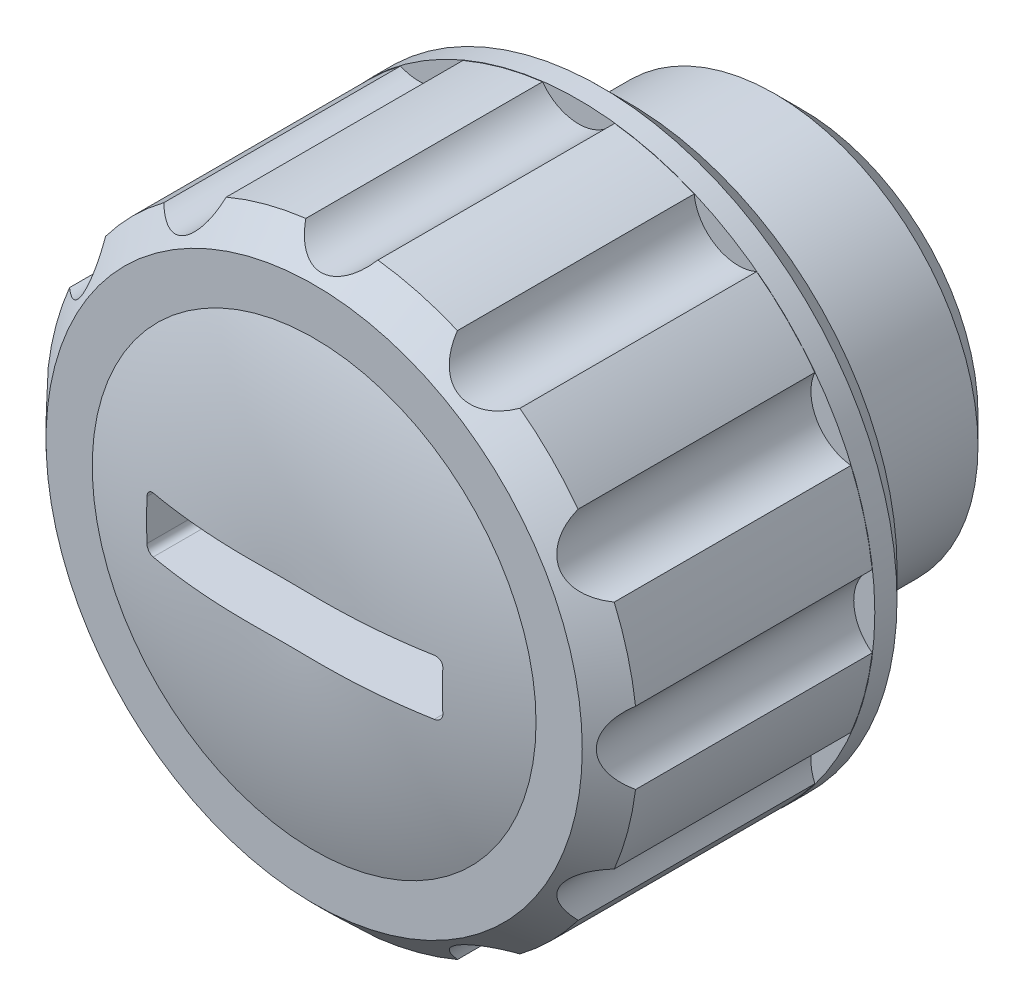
ISO-10303-21;
HEADER;
FILE_DESCRIPTION(('STEP AP214'),'2;1');
FILE_NAME('part.step','',(''),(''),'','','');
FILE_SCHEMA(('AUTOMOTIVE_DESIGN { 1 0 10303 214 1 1 1 1 }'));
ENDSEC;
DATA;
#1=APPLICATION_CONTEXT('core data for automotive mechanical design processes');
#2=APPLICATION_PROTOCOL_DEFINITION('international standard','automotive_design',2000,#1);
#3=PRODUCT_CONTEXT('',#1,'mechanical');
#4=PRODUCT('Part','Part','',(#3));
#5=PRODUCT_RELATED_PRODUCT_CATEGORY('part','',(#4));
#6=PRODUCT_DEFINITION_FORMATION('','',#4);
#7=PRODUCT_DEFINITION_CONTEXT('part definition',#1,'design');
#8=PRODUCT_DEFINITION('design','',#6,#7);
#9=PRODUCT_DEFINITION_SHAPE('','',#8);
#10=(LENGTH_UNIT() NAMED_UNIT(*) SI_UNIT(.MILLI.,.METRE.));
#11=(NAMED_UNIT(*) PLANE_ANGLE_UNIT() SI_UNIT($,.RADIAN.));
#12=(NAMED_UNIT(*) SI_UNIT($,.STERADIAN.) SOLID_ANGLE_UNIT());
#13=UNCERTAINTY_MEASURE_WITH_UNIT(LENGTH_MEASURE(1.E-05),#10,'distance_accuracy_value','');
#14=(GEOMETRIC_REPRESENTATION_CONTEXT(3) GLOBAL_UNCERTAINTY_ASSIGNED_CONTEXT((#13)) GLOBAL_UNIT_ASSIGNED_CONTEXT((#10,
#11,#12)) REPRESENTATION_CONTEXT('',''));
#15=CARTESIAN_POINT('',(0.,0.,0.));
#16=DIRECTION('',(0.,0.,1.));
#17=DIRECTION('',(1.,0.,0.));
#18=AXIS2_PLACEMENT_3D('',#15,#16,#17);
#19=CARTESIAN_POINT('',(0.,0.,-0.703698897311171));
#20=DIRECTION('',(0.,0.,1.));
#21=DIRECTION('',(1.,0.,0.));
#22=AXIS2_PLACEMENT_3D('',#19,#20,#21);
#23=DEGENERATE_TOROIDAL_SURFACE('',#22,1.1776626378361,15.,.T.);
#24=CARTESIAN_POINT('',(0.,0.,13.5));
#25=DIRECTION('',(0.,0.,1.));
#26=DIRECTION('',(1.,0.,0.));
#27=AXIS2_PLACEMENT_3D('',#24,#25,#26);
#28=CIRCLE('',#27,6.);
#29=CARTESIAN_POINT('',(6.,0.,13.5));
#30=VERTEX_POINT('',#29);
#31=EDGE_CURVE('E425',#30,#30,#28,.T.);
#32=ORIENTED_EDGE('',*,*,#31,.T.);
#33=EDGE_LOOP('',(#32));
#34=FACE_BOUND('',#33,.T.);
#35=CARTESIAN_POINT('',(-3.7998,-0.749999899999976,14.0521326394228));
#36=CARTESIAN_POINT('',(-3.81114880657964,-0.750020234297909,14.0500982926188));
#37=CARTESIAN_POINT('',(-3.82250108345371,-0.749057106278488,14.0480843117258));
#38=CARTESIAN_POINT('',(-3.84489426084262,-0.745224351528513,14.0441543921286));
#39=CARTESIAN_POINT('',(-3.85593522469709,-0.742355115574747,14.0422384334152));
#40=CARTESIAN_POINT('',(-3.87740011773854,-0.734767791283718,14.0385596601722));
#41=CARTESIAN_POINT('',(-3.88782359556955,-0.730048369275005,14.0367969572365));
#42=CARTESIAN_POINT('',(-3.90773653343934,-0.718887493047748,14.0334807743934));
#43=CARTESIAN_POINT('',(-3.91722631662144,-0.712446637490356,14.0319272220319));
#44=CARTESIAN_POINT('',(-3.93490505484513,-0.698084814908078,14.0290917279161));
#45=CARTESIAN_POINT('',(-3.9431055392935,-0.690178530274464,14.027807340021));
#46=CARTESIAN_POINT('',(-3.95806529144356,-0.673063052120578,14.025533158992));
#47=CARTESIAN_POINT('',(-3.96482436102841,-0.663853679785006,14.0245434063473));
#48=CARTESIAN_POINT('',(-3.97659283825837,-0.644555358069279,14.0229052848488));
#49=CARTESIAN_POINT('',(-3.98162854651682,-0.634482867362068,14.0222516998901));
#50=CARTESIAN_POINT('',(-3.98994131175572,-0.613624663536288,14.0212843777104));
#51=CARTESIAN_POINT('',(-3.99321964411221,-0.602839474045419,14.0209703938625));
#52=CARTESIAN_POINT('',(-3.99704991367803,-0.584948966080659,14.0207435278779));
#53=CARTESIAN_POINT('',(-3.99816189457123,-0.577959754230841,14.0207251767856));
#54=CARTESIAN_POINT('',(-3.99964030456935,-0.563913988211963,14.0208265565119));
#55=CARTESIAN_POINT('',(-4.00000779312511,-0.556857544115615,14.0209460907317));
#56=CARTESIAN_POINT('',(-3.9999999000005,-0.549800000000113,14.0211342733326));
#57=B_SPLINE_CURVE_WITH_KNOTS('',3,(#35,#36,#37,#38,#39,#40,#41,#42,#43,#44,#45,#46,#47,#48,#49,
#50,#51,#52,#53,#54,#55,#56),.UNSPECIFIED.,.F.,.F.,(4,2,2,2,2,2,2,2,2,2,4),(0.,
0.0345466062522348,0.0690861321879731,0.103650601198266,0.138203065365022,0.172426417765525,
0.206654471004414,0.240334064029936,0.273989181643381,0.295182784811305,0.316346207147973),.UNSPECIFIED.);
#58=CARTESIAN_POINT('',(-3.8,-0.75,14.0520967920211));
#59=VERTEX_POINT('',#58);
#60=CARTESIAN_POINT('',(-4.,-0.55,14.02112896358));
#61=VERTEX_POINT('',#60);
#62=EDGE_CURVE('E27',#59,#61,#57,.T.);
#63=ORIENTED_EDGE('',*,*,#62,.T.);
#64=CARTESIAN_POINT('',(-4.,0.,14.028388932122));
#65=CARTESIAN_POINT('',(-4.,0.339153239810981,14.0283961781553));
#66=CARTESIAN_POINT('',(-4.,0.678323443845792,14.0201840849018));
#67=CARTESIAN_POINT('',(-4.,1.35574448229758,13.9866878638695));
#68=CARTESIAN_POINT('',(-4.,1.69399552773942,13.9614080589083));
#69=CARTESIAN_POINT('',(-4.,2.36814839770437,13.8923714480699));
#70=CARTESIAN_POINT('',(-4.,2.7040529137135,13.8486414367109));
#71=CARTESIAN_POINT('',(-4.,3.37274568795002,13.7413643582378));
#72=CARTESIAN_POINT('',(-4.,3.70553346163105,13.6778142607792));
#73=CARTESIAN_POINT('',(-4.,4.45788889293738,13.5095576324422));
#74=CARTESIAN_POINT('',(-4.,4.87602372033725,13.3983308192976));
#75=CARTESIAN_POINT('',(-4.,5.70161656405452,13.1413580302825));
#76=CARTESIAN_POINT('',(-4.,6.10907328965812,12.9956079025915));
#77=CARTESIAN_POINT('',(-4.,6.91043852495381,12.6696375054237));
#78=CARTESIAN_POINT('',(-4.,7.30433371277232,12.4893844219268));
#79=CARTESIAN_POINT('',(-4.,8.07498519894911,12.0953512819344));
#80=CARTESIAN_POINT('',(-4.,8.45174183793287,11.8815718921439));
#81=CARTESIAN_POINT('',(-4.,9.18281763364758,11.4232419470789));
#82=CARTESIAN_POINT('',(-4.,9.53726091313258,11.1788894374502));
#83=CARTESIAN_POINT('',(-4.,10.2233955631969,10.6600773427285));
#84=CARTESIAN_POINT('',(-4.,10.5550867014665,10.3856174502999));
#85=CARTESIAN_POINT('',(-4.,11.1930381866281,9.8086212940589));
#86=CARTESIAN_POINT('',(-4.,11.4993002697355,9.50608695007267));
#87=CARTESIAN_POINT('',(-4.,12.0839658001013,8.87520844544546));
#88=CARTESIAN_POINT('',(-4.,12.3623701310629,8.54686510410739));
#89=CARTESIAN_POINT('',(-4.,12.8784698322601,7.8806109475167));
#90=CARTESIAN_POINT('',(-4.,13.1173543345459,7.54362037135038));
#91=CARTESIAN_POINT('',(-4.,13.5656684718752,6.85059247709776));
#92=CARTESIAN_POINT('',(-4.,13.7750989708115,6.49455571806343));
#93=CARTESIAN_POINT('',(-4.,14.1629376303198,5.76604322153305));
#94=CARTESIAN_POINT('',(-4.,14.3413507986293,5.39357014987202));
#95=CARTESIAN_POINT('',(-4.,14.6658865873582,4.63480988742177));
#96=CARTESIAN_POINT('',(-4.,14.8120091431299,4.24852266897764));
#97=CARTESIAN_POINT('',(-4.,15.0699099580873,3.46788913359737));
#98=CARTESIAN_POINT('',(-4.,15.1819394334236,3.07362578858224));
#99=CARTESIAN_POINT('',(-4.,15.3723250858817,2.2770527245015));
#100=CARTESIAN_POINT('',(-4.,15.4506814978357,1.87474306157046));
#101=CARTESIAN_POINT('',(-4.,15.5731575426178,1.06492658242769));
#102=CARTESIAN_POINT('',(-4.,15.617275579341,0.657419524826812));
#103=CARTESIAN_POINT('',(-4.,15.6709496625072,-0.159864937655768));
#104=CARTESIAN_POINT('',(-4.,15.6805056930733,-0.569642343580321));
#105=CARTESIAN_POINT('',(-4.,15.665001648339,-1.38774900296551));
#106=CARTESIAN_POINT('',(-4.,15.6400084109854,-1.7960795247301));
#107=CARTESIAN_POINT('',(-4.,15.5557048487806,-2.60918184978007));
#108=CARTESIAN_POINT('',(-4.,15.4963945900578,-3.01395365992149));
#109=CARTESIAN_POINT('',(-4.,15.3438918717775,-3.8170229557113));
#110=CARTESIAN_POINT('',(-4.,15.2507026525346,-4.21532105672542));
#111=CARTESIAN_POINT('',(-4.,15.0311128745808,-5.00265431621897));
#112=CARTESIAN_POINT('',(-4.,14.9047123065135,-5.39168947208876));
#113=CARTESIAN_POINT('',(-4.,14.619619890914,-6.15771427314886));
#114=CARTESIAN_POINT('',(-4.,14.4609300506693,-6.53470466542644));
#115=CARTESIAN_POINT('',(-4.,14.112398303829,-7.27399825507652));
#116=CARTESIAN_POINT('',(-4.,13.9225564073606,-7.63630145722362));
#117=CARTESIAN_POINT('',(-4.,13.5130367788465,-8.34375702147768));
#118=CARTESIAN_POINT('',(-4.,13.2933514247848,-8.68890497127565));
#119=CARTESIAN_POINT('',(-4.,12.825767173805,-9.35952806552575));
#120=CARTESIAN_POINT('',(-4.,12.5778682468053,-9.68500318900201));
#121=CARTESIAN_POINT('',(-4.,12.0550681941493,-10.3147088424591));
#122=CARTESIAN_POINT('',(-4.,11.7801085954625,-10.6188908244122));
#123=CARTESIAN_POINT('',(-4.,11.2056412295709,-11.2031141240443));
#124=CARTESIAN_POINT('',(-4.,10.9061334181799,-11.4831553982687));
#125=CARTESIAN_POINT('',(-4.,10.2849635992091,-12.0170071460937));
#126=CARTESIAN_POINT('',(-4.,9.96331753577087,-12.2708361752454));
#127=CARTESIAN_POINT('',(-4.,9.30001359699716,-12.7508263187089));
#128=CARTESIAN_POINT('',(-4.,8.95835585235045,-12.9769876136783));
#129=CARTESIAN_POINT('',(-4.,8.25506085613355,-13.4017235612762));
#130=CARTESIAN_POINT('',(-4.,7.89330122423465,-13.6000955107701));
#131=CARTESIAN_POINT('',(-4.,7.1546361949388,-13.9662854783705));
#132=CARTESIAN_POINT('',(-4.,6.77773047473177,-14.1341028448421));
#133=CARTESIAN_POINT('',(-4.,6.01113338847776,-14.4386630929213));
#134=CARTESIAN_POINT('',(-4.,5.62142902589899,-14.5753731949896));
#135=CARTESIAN_POINT('',(-4.,4.83241304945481,-14.817363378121));
#136=CARTESIAN_POINT('',(-4.,4.4331021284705,-14.9226457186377));
#137=CARTESIAN_POINT('',(-4.,3.77164652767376,-15.0703302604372));
#138=CARTESIAN_POINT('',(-4.,3.51147362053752,-15.1217585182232));
#139=CARTESIAN_POINT('',(-4.,2.98899804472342,-15.2123395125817));
#140=CARTESIAN_POINT('',(-4.,2.7266952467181,-15.2514914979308));
#141=CARTESIAN_POINT('',(-4.,1.93724201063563,-15.3514509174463));
#142=CARTESIAN_POINT('',(-4.,1.40777675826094,-15.3947116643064));
#143=CARTESIAN_POINT('',(-4.,0.612198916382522,-15.4285188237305));
#144=CARTESIAN_POINT('',(-4.,0.346571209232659,-15.4345998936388));
#145=CARTESIAN_POINT('',(-4.,-0.184756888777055,-15.4366600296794));
#146=CARTESIAN_POINT('',(-4.,-0.450457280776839,-15.4326389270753));
#147=CARTESIAN_POINT('',(-4.,-0.981374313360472,-15.4142959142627));
#148=CARTESIAN_POINT('',(-4.,-1.24659112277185,-15.3999788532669));
#149=CARTESIAN_POINT('',(-4.,-1.7762314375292,-15.3604541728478));
#150=CARTESIAN_POINT('',(-4.,-2.04065492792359,-15.3352463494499));
#151=CARTESIAN_POINT('',(-4.,-2.52470132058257,-15.2783376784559));
#152=CARTESIAN_POINT('',(-4.,-2.74453002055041,-15.248390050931));
#153=CARTESIAN_POINT('',(-4.,-3.18285214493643,-15.1800456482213));
#154=CARTESIAN_POINT('',(-4.,-3.40134562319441,-15.1416492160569));
#155=CARTESIAN_POINT('',(-4.,-4.05419633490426,-15.0133381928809));
#156=CARTESIAN_POINT('',(-4.,-4.48606739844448,-14.9102854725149));
#157=CARTESIAN_POINT('',(-4.,-5.33835432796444,-14.6682914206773));
#158=CARTESIAN_POINT('',(-4.,-5.75879820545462,-14.5294486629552));
#159=CARTESIAN_POINT('',(-4.,-6.58609234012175,-14.2156839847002));
#160=CARTESIAN_POINT('',(-4.,-6.99294114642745,-14.0407582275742));
#161=CARTESIAN_POINT('',(-4.,-7.79138450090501,-13.6547019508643));
#162=CARTESIAN_POINT('',(-4.,-8.18290123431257,-13.4434103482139));
#163=CARTESIAN_POINT('',(-4.,-8.94537896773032,-12.9865110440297));
#164=CARTESIAN_POINT('',(-4.,-9.31634014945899,-12.7409036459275));
#165=CARTESIAN_POINT('',(-4.,-10.0350527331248,-12.2167860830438));
#166=CARTESIAN_POINT('',(-4.,-10.3827705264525,-11.9382298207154));
#167=CARTESIAN_POINT('',(-4.,-11.0514362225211,-11.350662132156));
#168=CARTESIAN_POINT('',(-4.,-11.3723853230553,-11.0416520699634));
#169=CARTESIAN_POINT('',(-4.,-11.9642331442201,-10.4173353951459));
#170=CARTESIAN_POINT('',(-4.,-12.2370447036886,-10.1038391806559));
#171=CARTESIAN_POINT('',(-4.,-12.7549508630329,-9.4547474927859));
#172=CARTESIAN_POINT('',(-4.,-13.0000469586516,-9.11915321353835));
#173=CARTESIAN_POINT('',(-4.,-13.4605522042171,-8.42850547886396));
#174=CARTESIAN_POINT('',(-4.,-13.67598107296,-8.07346517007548));
#175=CARTESIAN_POINT('',(-4.,-14.0757477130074,-7.34628666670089));
#176=CARTESIAN_POINT('',(-4.,-14.2600853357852,-6.97414839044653));
#177=CARTESIAN_POINT('',(-4.,-14.5943069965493,-6.21997693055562));
#178=CARTESIAN_POINT('',(-4.,-14.7445728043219,-5.83811287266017));
#179=CARTESIAN_POINT('',(-4.,-15.0123145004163,-5.06306047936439));
#180=CARTESIAN_POINT('',(-4.,-15.1297907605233,-4.669872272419));
#181=CARTESIAN_POINT('',(-4.,-15.3311166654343,-3.87492033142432));
#182=CARTESIAN_POINT('',(-4.,-15.4149615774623,-3.47315539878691));
#183=CARTESIAN_POINT('',(-4.,-15.5483930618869,-2.66397544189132));
#184=CARTESIAN_POINT('',(-4.,-15.5979796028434,-2.25656041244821));
#185=CARTESIAN_POINT('',(-4.,-15.6624394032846,-1.44020146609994));
#186=CARTESIAN_POINT('',(-4.,-15.6774144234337,-1.03126558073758));
#187=CARTESIAN_POINT('',(-4.,-15.6728420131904,-0.213587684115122));
#188=CARTESIAN_POINT('',(-4.,-15.653294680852,0.19515432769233));
#189=CARTESIAN_POINT('',(-4.,-15.5798200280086,1.00952109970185));
#190=CARTESIAN_POINT('',(-4.,-15.5258939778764,1.41514597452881));
#191=CARTESIAN_POINT('',(-4.,-15.3840519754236,2.22040863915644));
#192=CARTESIAN_POINT('',(-4.,-15.2961360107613,2.62004642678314));
#193=CARTESIAN_POINT('',(-4.,-15.0869932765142,3.41032437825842));
#194=CARTESIAN_POINT('',(-4.,-14.9657808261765,3.8009683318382));
#195=CARTESIAN_POINT('',(-4.,-14.6909025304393,4.57066557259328));
#196=CARTESIAN_POINT('',(-4.,-14.5372367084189,4.94971886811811));
#197=CARTESIAN_POINT('',(-4.,-14.198563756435,5.6935427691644));
#198=CARTESIAN_POINT('',(-4.,-14.0135574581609,6.05831375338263));
#199=CARTESIAN_POINT('',(-4.,-13.6135344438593,6.77101064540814));
#200=CARTESIAN_POINT('',(-4.,-13.3985177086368,7.11893654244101));
#201=CARTESIAN_POINT('',(-4.,-12.9397392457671,7.79592064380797));
#202=CARTESIAN_POINT('',(-4.,-12.695942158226,8.12495488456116));
#203=CARTESIAN_POINT('',(-4.,-12.1815798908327,8.76138756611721));
#204=CARTESIAN_POINT('',(-4.,-11.91101469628,9.068785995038));
#205=CARTESIAN_POINT('',(-4.,-11.3450384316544,9.65985804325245));
#206=CARTESIAN_POINT('',(-4.,-11.049624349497,9.94352877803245));
#207=CARTESIAN_POINT('',(-4.,-10.4361166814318,10.4851767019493));
#208=CARTESIAN_POINT('',(-4.,-10.1180230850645,10.7431538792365));
#209=CARTESIAN_POINT('',(-4.,-9.45975657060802,11.2329803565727));
#210=CARTESIAN_POINT('',(-4.,-9.11947790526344,11.4646875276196));
#211=CARTESIAN_POINT('',(-4.,-8.42081797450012,11.8989645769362));
#212=CARTESIAN_POINT('',(-4.,-8.06243669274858,12.1015344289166));
#213=CARTESIAN_POINT('',(-4.,-7.33043234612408,12.476268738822));
#214=CARTESIAN_POINT('',(-4.,-6.95681985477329,12.6484538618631));
#215=CARTESIAN_POINT('',(-4.,-6.19684574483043,12.961845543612));
#216=CARTESIAN_POINT('',(-4.,-5.81048403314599,13.1030518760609));
#217=CARTESIAN_POINT('',(-4.,-4.98307663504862,13.3686004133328));
#218=CARTESIAN_POINT('',(-4.,-4.54082134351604,13.4891802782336));
#219=CARTESIAN_POINT('',(-4.,-3.64769934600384,13.6923551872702));
#220=CARTESIAN_POINT('',(-4.,-3.19683149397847,13.774945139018));
#221=CARTESIAN_POINT('',(-4.,-2.28933102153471,13.9045907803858));
#222=CARTESIAN_POINT('',(-4.,-1.83269032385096,13.9515893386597));
#223=CARTESIAN_POINT('',(-4.,-1.14623014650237,13.9979727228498));
#224=CARTESIAN_POINT('',(-4.,-0.917138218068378,14.0094147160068));
#225=CARTESIAN_POINT('',(-4.,-0.458700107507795,14.0246202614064));
#226=CARTESIAN_POINT('',(-4.,-0.229353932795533,14.0283840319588));
#227=CARTESIAN_POINT('',(-4.,0.,14.028388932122));
#228=B_SPLINE_CURVE_WITH_KNOTS('',3,(#64,#65,#66,#67,#68,#69,#70,#71,#72,#73,#74,#75,#76,#77,
#78,#79,#80,#81,#82,#83,#84,#85,#86,#87,#88,#89,#90,#91,#92,#93,#94,#95,#96,#97,#98,#99,#100,
#101,#102,#103,#104,#105,#106,#107,#108,#109,#110,#111,#112,#113,#114,#115,#116,#117,#118,#119,
#120,#121,#122,#123,#124,#125,#126,#127,#128,#129,#130,#131,#132,#133,#134,#135,#136,#137,#138,
#139,#140,#141,#142,#143,#144,#145,#146,#147,#148,#149,#150,#151,#152,#153,#154,#155,#156,#157,
#158,#159,#160,#161,#162,#163,#164,#165,#166,#167,#168,#169,#170,#171,#172,#173,#174,#175,#176,
#177,#178,#179,#180,#181,#182,#183,#184,#185,#186,#187,#188,#189,#190,#191,#192,#193,#194,#195,
#196,#197,#198,#199,#200,#201,#202,#203,#204,#205,#206,#207,#208,#209,#210,#211,#212,#213,#214,
#215,#216,#217,#218,#219,#220,#221,#222,#223,#224,#225,#226,#227),.UNSPECIFIED.,.T.,.F.,(4,2,2,
2,2,2,2,2,2,2,2,2,2,2,2,2,2,2,2,2,2,2,2,2,2,2,2,2,2,2,2,2,2,2,2,2,2,2,2,2,2,2,2,2,2,2,2,2,2,2,2,
2,2,2,2,2,2,2,2,2,2,2,2,2,2,2,2,2,2,2,2,2,2,2,2,2,2,2,2,2,2,4),(0.,1.01738294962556,
2.03450831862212,3.05016161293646,4.06597026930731,5.36249424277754,6.6591742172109,
7.95709358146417,9.25498713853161,10.5448707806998,11.8347675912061,13.1245762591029,
14.4143439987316,15.6520836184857,16.8897869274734,18.1272902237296,19.3647959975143,
20.5929491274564,21.8210936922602,23.0492955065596,24.2774978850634,25.5033275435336,
26.7291548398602,27.9548649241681,29.1805753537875,30.4062096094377,31.6318434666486,
32.8577909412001,34.0837397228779,35.3123982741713,36.5410590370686,37.7688439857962,
38.9966209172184,40.2329329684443,41.4692713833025,42.7069066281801,43.9444528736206,
44.7397910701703,45.5351779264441,47.1266553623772,47.9236225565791,48.7206030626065,
49.5172084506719,50.3138287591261,50.9792441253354,51.6446324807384,52.9749769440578,
54.301695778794,55.6285557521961,56.9614518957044,58.2943362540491,59.6291079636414,
60.9638199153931,62.2090674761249,63.4542478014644,64.6985964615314,65.9429510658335,
67.1725857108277,68.4022064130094,69.6320000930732,70.8617949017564,72.0879693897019,
73.3141403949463,74.5402660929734,75.7663922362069,76.9919919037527,78.2175906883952,
79.4431569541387,80.6687240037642,81.8958127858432,83.1229022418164,84.3501406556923,
85.5773796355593,86.8109699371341,88.0445613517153,89.2773105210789,90.510068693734,
91.8834796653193,93.2570746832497,94.632869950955,95.3208993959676,96.0089092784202),.UNSPECIFIED.);
#229=CARTESIAN_POINT('',(-4.,0.55,14.02112896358));
#230=VERTEX_POINT('',#229);
#231=EDGE_CURVE('E9',#61,#230,#228,.T.);
#232=ORIENTED_EDGE('',*,*,#231,.T.);
#233=CARTESIAN_POINT('',(-3.99999989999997,0.5498,14.0211342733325));
#234=CARTESIAN_POINT('',(-4.00002120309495,0.560882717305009,14.0208370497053));
#235=CARTESIAN_POINT('',(-3.99910147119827,0.571967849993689,14.0207119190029));
#236=CARTESIAN_POINT('',(-3.99545102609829,0.59382219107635,14.0208010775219));
#237=CARTESIAN_POINT('',(-3.99272233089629,0.604591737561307,14.021014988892));
#238=CARTESIAN_POINT('',(-3.98552323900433,0.625524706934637,14.0217769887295));
#239=CARTESIAN_POINT('',(-3.98105209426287,0.635687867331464,14.0223252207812));
#240=CARTESIAN_POINT('',(-3.97050578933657,0.655118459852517,14.0237373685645));
#241=CARTESIAN_POINT('',(-3.96443078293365,0.664385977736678,14.0246012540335));
#242=CARTESIAN_POINT('',(-3.95082544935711,0.681812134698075,14.0266217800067));
#243=CARTESIAN_POINT('',(-3.94328885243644,0.689965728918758,14.0277796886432));
#244=CARTESIAN_POINT('',(-3.92699598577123,0.704900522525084,14.030350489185));
#245=CARTESIAN_POINT('',(-3.91823946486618,0.711681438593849,14.0317634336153));
#246=CARTESIAN_POINT('',(-3.89962640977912,0.723780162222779,14.0348229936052));
#247=CARTESIAN_POINT('',(-3.88975612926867,0.729076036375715,14.0364726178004));
#248=CARTESIAN_POINT('',(-3.86929754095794,0.737941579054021,14.0399411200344));
#249=CARTESIAN_POINT('',(-3.858709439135,0.741511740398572,14.0417599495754));
#250=CARTESIAN_POINT('',(-3.84003688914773,0.746119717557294,14.0450054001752));
#251=CARTESIAN_POINT('',(-3.83204943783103,0.747581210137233,14.046405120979));
#252=CARTESIAN_POINT('',(-3.8159747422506,0.749525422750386,14.0492439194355));
#253=CARTESIAN_POINT('',(-3.80788765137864,0.750009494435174,14.0506829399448));
#254=CARTESIAN_POINT('',(-3.79980000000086,0.749999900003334,14.052132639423));
#255=B_SPLINE_CURVE_WITH_KNOTS('',3,(#233,#234,#235,#236,#237,#238,#239,#240,#241,#242,#243,
#244,#245,#246,#247,#248,#249,#250,#251,#252,#253,#254),.UNSPECIFIED.,.F.,.F.,(4,2,2,2,2,2,2,2,
2,2,4),(0.,0.0332152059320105,0.0663934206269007,0.0995858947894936,0.132775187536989,
0.166110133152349,0.199451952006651,0.233262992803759,0.267064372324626,0.291727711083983,
0.316356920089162),.UNSPECIFIED.);
#256=CARTESIAN_POINT('',(-3.79999999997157,0.75,14.0520967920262));
#257=VERTEX_POINT('',#256);
#258=EDGE_CURVE('E488',#230,#257,#255,.T.);
#259=ORIENTED_EDGE('',*,*,#258,.T.);
#260=CARTESIAN_POINT('',(0.,0.75,14.2902033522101));
#261=CARTESIAN_POINT('',(0.062509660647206,0.75,14.2902036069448));
#262=CARTESIAN_POINT('',(0.125019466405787,0.75,14.2904360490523));
#263=CARTESIAN_POINT('',(0.250036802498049,0.75,14.291252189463));
#264=CARTESIAN_POINT('',(0.312544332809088,0.75,14.2918358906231));
#265=CARTESIAN_POINT('',(0.437565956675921,0.75,14.2930988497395));
#266=CARTESIAN_POINT('',(0.500080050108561,0.75,14.2937781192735));
#267=CARTESIAN_POINT('',(0.625113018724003,0.75,14.2949804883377));
#268=CARTESIAN_POINT('',(0.687631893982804,0.75,14.2955035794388));
#269=CARTESIAN_POINT('',(0.875766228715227,0.75,14.2965328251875));
#270=CARTESIAN_POINT('',(1.00138686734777,0.75,14.2964891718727));
#271=CARTESIAN_POINT('',(1.25260493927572,0.75,14.2940460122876));
#272=CARTESIAN_POINT('',(1.37820237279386,0.75,14.2916465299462));
#273=CARTESIAN_POINT('',(1.75485708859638,0.75,14.2803277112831));
#274=CARTESIAN_POINT('',(2.00580900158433,0.75,14.2672884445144));
#275=CARTESIAN_POINT('',(2.50689880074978,0.75,14.2291477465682));
#276=CARTESIAN_POINT('',(2.75703633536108,0.75,14.2040416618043));
#277=CARTESIAN_POINT('',(3.25583549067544,0.75,14.1415504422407));
#278=CARTESIAN_POINT('',(3.5044966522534,0.75,14.1041616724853));
#279=CARTESIAN_POINT('',(4.16871083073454,0.75,13.9873107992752));
#280=CARTESIAN_POINT('',(4.58233519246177,0.75,13.8965497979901));
#281=CARTESIAN_POINT('',(5.40052634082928,0.75,13.6805066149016));
#282=CARTESIAN_POINT('',(5.80509101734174,0.75,13.5552164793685));
#283=CARTESIAN_POINT('',(6.60293944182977,0.75,13.2706758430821));
#284=CARTESIAN_POINT('',(6.99620137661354,0.75,13.1113641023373));
#285=CARTESIAN_POINT('',(7.76780860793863,0.75,12.760031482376));
#286=CARTESIAN_POINT('',(8.14615456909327,0.75,12.5680120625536));
#287=CARTESIAN_POINT('',(8.88446706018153,0.75,12.1530468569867));
#288=CARTESIAN_POINT('',(9.2444697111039,0.75,11.9301653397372));
#289=CARTESIAN_POINT('',(9.9443450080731,0.75,11.4547620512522));
#290=CARTESIAN_POINT('',(10.2842175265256,0.75,11.2022400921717));
#291=CARTESIAN_POINT('',(10.9411846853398,0.75,10.6695279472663));
#292=CARTESIAN_POINT('',(11.2582935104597,0.75,10.3893552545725));
#293=CARTESIAN_POINT('',(11.867695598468,0.75,9.80321084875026));
#294=CARTESIAN_POINT('',(12.1599889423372,0.75,9.49723921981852));
#295=CARTESIAN_POINT('',(12.7167806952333,0.75,8.86269415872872));
#296=CARTESIAN_POINT('',(12.9813643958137,0.75,8.53419556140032));
#297=CARTESIAN_POINT('',(13.4819097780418,0.75,7.85607214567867));
#298=CARTESIAN_POINT('',(13.7178715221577,0.75,7.50644737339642));
#299=CARTESIAN_POINT('',(14.1595322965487,0.75,6.78849443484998));
#300=CARTESIAN_POINT('',(14.3652260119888,0.75,6.42016299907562));
#301=CARTESIAN_POINT('',(14.7448367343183,0.75,5.66747355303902));
#302=CARTESIAN_POINT('',(14.9187537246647,0.75,5.28311553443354));
#303=CARTESIAN_POINT('',(15.2335050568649,0.75,4.50127546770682));
#304=CARTESIAN_POINT('',(15.3743535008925,0.75,4.10379909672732));
#305=CARTESIAN_POINT('',(15.6220611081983,0.75,3.29839291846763));
#306=CARTESIAN_POINT('',(15.7289202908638,0.75,2.89046311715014));
#307=CARTESIAN_POINT('',(15.9078821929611,0.75,2.06708280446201));
#308=CARTESIAN_POINT('',(15.9799876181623,0.75,1.65163288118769));
#309=CARTESIAN_POINT('',(16.0889414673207,0.75,0.816135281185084));
#310=CARTESIAN_POINT('',(16.1257898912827,0.75,0.396087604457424));
#311=CARTESIAN_POINT('',(16.163965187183,0.75,-0.445565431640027));
#312=CARTESIAN_POINT('',(16.1652965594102,0.75,-0.867170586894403));
#313=CARTESIAN_POINT('',(16.1324397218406,0.75,-1.7089944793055));
#314=CARTESIAN_POINT('',(16.0982515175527,0.75,-2.12921321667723));
#315=CARTESIAN_POINT('',(15.994590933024,0.75,-2.96533956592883));
#316=CARTESIAN_POINT('',(15.9251132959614,0.75,-3.38124652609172));
#317=CARTESIAN_POINT('',(15.751365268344,0.75,-4.20572862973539));
#318=CARTESIAN_POINT('',(15.6470948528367,0.75,-4.61430376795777));
#319=CARTESIAN_POINT('',(15.4044819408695,0.75,-5.42128714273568));
#320=CARTESIAN_POINT('',(15.2661335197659,0.75,-5.8196935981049));
#321=CARTESIAN_POINT('',(14.9563586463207,0.75,-6.6034316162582));
#322=CARTESIAN_POINT('',(14.7849322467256,0.75,-6.9887631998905));
#323=CARTESIAN_POINT('',(14.410318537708,0.75,-7.74341593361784));
#324=CARTESIAN_POINT('',(14.2071477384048,0.75,-8.11274527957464));
#325=CARTESIAN_POINT('',(13.7704245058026,0.75,-8.83298393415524));
#326=CARTESIAN_POINT('',(13.5368719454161,0.75,-9.18389316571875));
#327=CARTESIAN_POINT('',(13.0411762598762,0.75,-9.86461934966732));
#328=CARTESIAN_POINT('',(12.7790481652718,0.75,-10.1944472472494));
#329=CARTESIAN_POINT('',(12.2279683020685,0.75,-10.8308662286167));
#330=CARTESIAN_POINT('',(11.9390170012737,0.75,-11.1374577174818));
#331=CARTESIAN_POINT('',(11.3358371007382,0.75,-11.7257264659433));
#332=CARTESIAN_POINT('',(11.0215672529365,0.75,-12.0073614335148));
#333=CARTESIAN_POINT('',(10.3703891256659,0.75,-12.5431585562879));
#334=CARTESIAN_POINT('',(10.0334794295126,0.75,-12.7973189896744));
#335=CARTESIAN_POINT('',(9.33882156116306,0.75,-13.2767706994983));
#336=CARTESIAN_POINT('',(8.98103735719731,0.75,-13.5020097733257));
#337=CARTESIAN_POINT('',(8.24780759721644,0.75,-13.9214489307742));
#338=CARTESIAN_POINT('',(7.87236542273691,0.75,-14.1156549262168));
#339=CARTESIAN_POINT('',(7.10830459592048,0.75,-14.4708441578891));
#340=CARTESIAN_POINT('',(6.71975907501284,0.75,-14.6319846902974));
#341=CARTESIAN_POINT('',(5.93032689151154,0.75,-14.9212008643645));
#342=CARTESIAN_POINT('',(5.52943355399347,0.75,-15.049258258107));
#343=CARTESIAN_POINT('',(4.71037120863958,0.75,-15.2735305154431));
#344=CARTESIAN_POINT('',(4.29201779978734,0.75,-15.3690765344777));
#345=CARTESIAN_POINT('',(3.65997311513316,0.75,-15.485449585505));
#346=CARTESIAN_POINT('',(3.44867138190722,0.75,-15.5197366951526));
#347=CARTESIAN_POINT('',(3.02478880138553,0.75,-15.5793924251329));
#348=CARTESIAN_POINT('',(2.81220789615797,0.75,-15.6047606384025));
#349=CARTESIAN_POINT('',(2.38452719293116,0.75,-15.6468286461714));
#350=CARTESIAN_POINT('',(2.16942066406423,0.75,-15.6634594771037));
#351=CARTESIAN_POINT('',(1.73875062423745,0.75,-15.6880212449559));
#352=CARTESIAN_POINT('',(1.5231871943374,0.75,-15.6959536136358));
#353=CARTESIAN_POINT('',(1.19954465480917,0.75,-15.7021388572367));
#354=CARTESIAN_POINT('',(1.09150789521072,0.75,-15.7032466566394));
#355=CARTESIAN_POINT('',(0.875426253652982,0.75,-15.7039178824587));
#356=CARTESIAN_POINT('',(0.767381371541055,0.75,-15.7034812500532));
#357=CARTESIAN_POINT('',(0.551281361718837,0.75,-15.7017790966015));
#358=CARTESIAN_POINT('',(0.443226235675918,0.75,-15.7005134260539));
#359=CARTESIAN_POINT('',(0.281143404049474,0.75,-15.6989476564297));
#360=CARTESIAN_POINT('',(0.227117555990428,0.75,-15.698481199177));
#361=CARTESIAN_POINT('',(0.119064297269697,0.75,-15.6978197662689));
#362=CARTESIAN_POINT('',(0.0650368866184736,0.75,-15.6976247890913));
#363=CARTESIAN_POINT('',(-0.05800398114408,0.75,-15.6975761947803));
#364=CARTESIAN_POINT('',(-0.127017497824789,0.75,-15.6978322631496));
#365=CARTESIAN_POINT('',(-0.265042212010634,0.75,-15.6987649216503));
#366=CARTESIAN_POINT('',(-0.334053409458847,0.75,-15.6994415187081));
#367=CARTESIAN_POINT('',(-0.47207998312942,0.75,-15.7008610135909));
#368=CARTESIAN_POINT('',(-0.541095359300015,0.75,-15.7016039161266));
#369=CARTESIAN_POINT('',(-0.679127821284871,0.75,-15.7028300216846));
#370=CARTESIAN_POINT('',(-0.748144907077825,0.75,-15.7033132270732));
#371=CARTESIAN_POINT('',(-0.955164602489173,0.75,-15.7040009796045));
#372=CARTESIAN_POINT('',(-1.0931724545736,0.75,-15.7034443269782));
#373=CARTESIAN_POINT('',(-1.36914222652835,0.75,-15.6993084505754));
#374=CARTESIAN_POINT('',(-1.50710414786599,0.75,-15.6957293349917));
#375=CARTESIAN_POINT('',(-1.78256534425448,0.75,-15.685188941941));
#376=CARTESIAN_POINT('',(-1.92006492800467,0.75,-15.6782359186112));
#377=CARTESIAN_POINT('',(-2.19483905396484,0.75,-15.6607772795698));
#378=CARTESIAN_POINT('',(-2.33211359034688,0.75,-15.6502715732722));
#379=CARTESIAN_POINT('',(-2.743559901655,0.75,-15.6132836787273));
#380=CARTESIAN_POINT('',(-3.01726339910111,0.75,-15.581334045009));
#381=CARTESIAN_POINT('',(-3.55992465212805,0.75,-15.5030144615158));
#382=CARTESIAN_POINT('',(-3.82890277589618,0.75,-15.4567848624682));
#383=CARTESIAN_POINT('',(-4.36392755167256,0.75,-15.3498484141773));
#384=CARTESIAN_POINT('',(-4.62997463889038,0.75,-15.2891437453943));
#385=CARTESIAN_POINT('',(-5.15895710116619,0.75,-15.1532282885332));
#386=CARTESIAN_POINT('',(-5.42188447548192,0.75,-15.0779863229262));
#387=CARTESIAN_POINT('',(-5.94322863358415,0.75,-14.9132881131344));
#388=CARTESIAN_POINT('',(-6.20164546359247,0.75,-14.8238320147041));
#389=CARTESIAN_POINT('',(-6.85115229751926,0.75,-14.5789290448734));
#390=CARTESIAN_POINT('',(-7.23867684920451,0.75,-14.4139021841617));
#391=CARTESIAN_POINT('',(-7.99805018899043,0.75,-14.0520702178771));
#392=CARTESIAN_POINT('',(-8.36991500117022,0.75,-13.8552986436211));
#393=CARTESIAN_POINT('',(-9.09777056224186,0.75,-13.4300705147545));
#394=CARTESIAN_POINT('',(-9.45366504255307,0.75,-13.2014490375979));
#395=CARTESIAN_POINT('',(-10.1449857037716,0.75,-12.714880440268));
#396=CARTESIAN_POINT('',(-10.4804049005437,0.75,-12.4569233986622));
#397=CARTESIAN_POINT('',(-11.1277254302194,0.75,-11.9140206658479));
#398=CARTESIAN_POINT('',(-11.4396635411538,0.75,-11.6291188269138));
#399=CARTESIAN_POINT('',(-12.0383542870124,0.75,-11.0340393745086));
#400=CARTESIAN_POINT('',(-12.3251095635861,0.75,-10.7238644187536));
#401=CARTESIAN_POINT('',(-12.870898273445,0.75,-10.0810426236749));
#402=CARTESIAN_POINT('',(-13.1299839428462,0.75,-9.74844013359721));
#403=CARTESIAN_POINT('',(-13.619228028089,0.75,-9.06258526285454));
#404=CARTESIAN_POINT('',(-13.8493856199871,0.75,-8.70933229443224));
#405=CARTESIAN_POINT('',(-14.2791137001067,0.75,-7.98471878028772));
#406=CARTESIAN_POINT('',(-14.4786861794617,0.75,-7.61335941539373));
#407=CARTESIAN_POINT('',(-14.8458413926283,0.75,-6.85515348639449));
#408=CARTESIAN_POINT('',(-15.0134243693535,0.75,-6.46830703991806));
#409=CARTESIAN_POINT('',(-15.3155070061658,0.75,-5.6816225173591));
#410=CARTESIAN_POINT('',(-15.4499855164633,0.75,-5.2817763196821));
#411=CARTESIAN_POINT('',(-15.6847633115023,0.75,-4.47217121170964));
#412=CARTESIAN_POINT('',(-15.7850625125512,0.75,-4.06241227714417));
#413=CARTESIAN_POINT('',(-15.9507352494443,0.75,-3.23605764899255));
#414=CARTESIAN_POINT('',(-16.0161221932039,0.75,-2.81946464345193));
#415=CARTESIAN_POINT('',(-16.1115638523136,0.75,-1.98225120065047));
#416=CARTESIAN_POINT('',(-16.1416186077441,0.75,-1.56163076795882));
#417=CARTESIAN_POINT('',(-16.1661796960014,0.75,-0.719438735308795));
#418=CARTESIAN_POINT('',(-16.1606932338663,0.75,-0.297867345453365));
#419=CARTESIAN_POINT('',(-16.114227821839,0.75,0.543314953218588));
#420=CARTESIAN_POINT('',(-16.0732488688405,0.75,0.962925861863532));
#421=CARTESIAN_POINT('',(-15.9560905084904,0.75,1.79720001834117));
#422=CARTESIAN_POINT('',(-15.8799114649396,0.75,2.21186331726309));
#423=CARTESIAN_POINT('',(-15.6928948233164,0.75,3.03329916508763));
#424=CARTESIAN_POINT('',(-15.582057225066,0.75,3.44007171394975));
#425=CARTESIAN_POINT('',(-15.3264932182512,0.75,4.24289288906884));
#426=CARTESIAN_POINT('',(-15.181761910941,0.75,4.63893995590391));
#427=CARTESIAN_POINT('',(-14.8594487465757,0.75,5.41743335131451));
#428=CARTESIAN_POINT('',(-14.68186687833,0.75,5.79987967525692));
#429=CARTESIAN_POINT('',(-14.2950896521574,0.75,6.54850360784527));
#430=CARTESIAN_POINT('',(-14.0858900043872,0.75,6.91467900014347));
#431=CARTESIAN_POINT('',(-13.6373836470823,0.75,7.62810226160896));
#432=CARTESIAN_POINT('',(-13.3980769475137,0.75,7.97535013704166));
#433=CARTESIAN_POINT('',(-12.8911539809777,0.75,8.64832469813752));
#434=CARTESIAN_POINT('',(-12.6235482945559,0.75,8.97405935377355));
#435=CARTESIAN_POINT('',(-12.0618570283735,0.75,9.60183607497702));
#436=CARTESIAN_POINT('',(-11.767771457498,0.75,9.9038781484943));
#437=CARTESIAN_POINT('',(-11.1552973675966,0.75,10.4820455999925));
#438=CARTESIAN_POINT('',(-10.8369156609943,0.75,10.758178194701));
#439=CARTESIAN_POINT('',(-10.1780402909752,0.75,11.2826657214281));
#440=CARTESIAN_POINT('',(-9.83754661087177,0.75,11.5310206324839));
#441=CARTESIAN_POINT('',(-9.13645925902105,0.75,11.9984683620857));
#442=CARTESIAN_POINT('',(-8.775842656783,0.75,12.2175267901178));
#443=CARTESIAN_POINT('',(-8.03744530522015,0.75,12.6244922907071));
#444=CARTESIAN_POINT('',(-7.65966465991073,0.75,12.8123995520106));
#445=CARTESIAN_POINT('',(-6.88907462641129,0.75,13.1559939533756));
#446=CARTESIAN_POINT('',(-6.49624456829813,0.75,13.3116347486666));
#447=CARTESIAN_POINT('',(-5.69887180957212,0.75,13.589295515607));
#448=CARTESIAN_POINT('',(-5.29432853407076,0.75,13.7113138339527));
#449=CARTESIAN_POINT('',(-4.47763909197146,0.75,13.9206164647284));
#450=CARTESIAN_POINT('',(-4.06552036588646,0.75,14.0080072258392));
#451=CARTESIAN_POINT('',(-3.44313498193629,0.75,14.1131515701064));
#452=CARTESIAN_POINT('',(-3.2349769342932,0.75,14.1438756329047));
#453=CARTESIAN_POINT('',(-2.81757605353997,0.75,14.1967187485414));
#454=CARTESIAN_POINT('',(-2.60833331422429,0.75,14.2188385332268));
#455=CARTESIAN_POINT('',(-2.19967651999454,0.75,14.2537079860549));
#456=CARTESIAN_POINT('',(-2.00029743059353,0.75,14.2668729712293));
#457=CARTESIAN_POINT('',(-1.60124974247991,0.75,14.2858621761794));
#458=CARTESIAN_POINT('',(-1.40158124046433,0.75,14.291688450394));
#459=CARTESIAN_POINT('',(-1.10202038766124,0.75,14.2957506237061));
#460=CARTESIAN_POINT('',(-1.00214989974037,0.75,14.2963250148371));
#461=CARTESIAN_POINT('',(-0.80240752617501,0.75,14.296275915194));
#462=CARTESIAN_POINT('',(-0.702535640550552,0.75,14.2956523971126));
#463=CARTESIAN_POINT('',(-0.502793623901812,0.75,14.2938528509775));
#464=CARTESIAN_POINT('',(-0.402923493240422,0.75,14.2926767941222));
#465=CARTESIAN_POINT('',(-0.2031790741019,0.75,14.290858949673));
#466=CARTESIAN_POINT('',(-0.103304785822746,0.75,14.2902171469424));
#467=CARTESIAN_POINT('',(-0.00228680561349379,0.75,14.2902034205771));
#468=CARTESIAN_POINT('',(-0.0011434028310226,0.75,14.2902033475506));
#469=CARTESIAN_POINT('',(0.,0.75,14.2902033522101));
#470=B_SPLINE_CURVE_WITH_KNOTS('',3,(#260,#261,#262,#263,#264,#265,#266,#267,#268,#269,#270,
#271,#272,#273,#274,#275,#276,#277,#278,#279,#280,#281,#282,#283,#284,#285,#286,#287,#288,#289,
#290,#291,#292,#293,#294,#295,#296,#297,#298,#299,#300,#301,#302,#303,#304,#305,#306,#307,#308,
#309,#310,#311,#312,#313,#314,#315,#316,#317,#318,#319,#320,#321,#322,#323,#324,#325,#326,#327,
#328,#329,#330,#331,#332,#333,#334,#335,#336,#337,#338,#339,#340,#341,#342,#343,#344,#345,#346,
#347,#348,#349,#350,#351,#352,#353,#354,#355,#356,#357,#358,#359,#360,#361,#362,#363,#364,#365,
#366,#367,#368,#369,#370,#371,#372,#373,#374,#375,#376,#377,#378,#379,#380,#381,#382,#383,#384,
#385,#386,#387,#388,#389,#390,#391,#392,#393,#394,#395,#396,#397,#398,#399,#400,#401,#402,#403,
#404,#405,#406,#407,#408,#409,#410,#411,#412,#413,#414,#415,#416,#417,#418,#419,#420,#421,#422,
#423,#424,#425,#426,#427,#428,#429,#430,#431,#432,#433,#434,#435,#436,#437,#438,#439,#440,#441,
#442,#443,#444,#445,#446,#447,#448,#449,#450,#451,#452,#453,#454,#455,#456,#457,#458,#459,#460,
#461,#462,#463,#464,#465,#466,#467,#468,#469),.UNSPECIFIED.,.T.,.F.,(4,2,2,2,2,2,2,2,2,2,2,2,2,
2,2,2,2,2,2,2,2,2,2,2,2,2,2,2,2,2,2,2,2,2,2,2,2,2,2,2,2,2,2,2,2,2,2,2,2,2,2,2,2,2,2,2,2,2,2,2,2,
2,2,2,2,2,2,2,2,2,2,2,2,2,2,2,2,2,2,2,2,2,2,2,2,2,2,2,2,2,2,2,2,2,2,2,2,2,2,2,2,2,2,2,4),(0.,
0.187528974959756,0.375059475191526,0.562612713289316,0.750176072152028,1.12702058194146,
1.50386126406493,2.25744605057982,3.0113216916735,3.76542063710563,5.034211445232,
6.30329476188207,7.57468202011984,8.84601256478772,10.1147343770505,11.3834642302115,
12.651396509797,13.9193246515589,15.1832276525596,16.4471278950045,17.7112498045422,
18.9753723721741,20.2389548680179,21.5025366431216,22.7660200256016,24.029503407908,
25.292826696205,26.556149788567,27.8196611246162,29.0831733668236,30.3469054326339,
31.6106354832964,32.873710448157,34.1367906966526,35.3992097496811,36.6616067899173,
37.9261037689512,39.1906799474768,40.4575075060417,41.7240934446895,42.9845067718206,
44.2456138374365,45.5312858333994,46.1733270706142,46.8153976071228,47.4624625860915,
48.109421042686,48.4335381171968,48.7576675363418,49.081855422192,49.2439386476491,
49.4060209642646,49.613060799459,49.8201040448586,50.0271620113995,50.2342180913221,
50.6482198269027,51.0622067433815,51.4751859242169,51.8881756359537,52.7144278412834,
53.5328045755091,54.3510581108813,55.1710864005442,55.9911062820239,57.2531212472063,
58.5138117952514,59.7812913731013,61.0492009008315,62.3150813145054,63.580828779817,
64.8441428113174,66.1074928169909,67.3707605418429,68.6340186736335,69.8980817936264,
71.1621480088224,72.425728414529,73.6893073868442,74.9526302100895,76.2159531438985,
77.4792630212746,78.7425729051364,80.0060654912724,81.2695585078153,82.5332231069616,
83.7968872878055,85.060080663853,86.3232736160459,87.5861136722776,88.8489546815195,
90.1132653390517,91.3775683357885,92.6436748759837,93.909843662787,95.1720893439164,
95.8031823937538,96.4342217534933,97.0335229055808,97.632656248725,97.932266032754,
98.2318826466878,98.5315148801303,98.831138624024,98.8345688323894),.UNSPECIFIED.);
#471=CARTESIAN_POINT('',(3.8,0.75,14.0520967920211));
#472=VERTEX_POINT('',#471);
#473=EDGE_CURVE('E498',#257,#472,#470,.T.);
#474=ORIENTED_EDGE('',*,*,#473,.T.);
#475=CARTESIAN_POINT('',(3.7998,0.749999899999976,14.0521326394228));
#476=CARTESIAN_POINT('',(3.81114880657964,0.750020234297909,14.0500982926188));
#477=CARTESIAN_POINT('',(3.82250108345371,0.749057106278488,14.0480843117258));
#478=CARTESIAN_POINT('',(3.84489426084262,0.745224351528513,14.0441543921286));
#479=CARTESIAN_POINT('',(3.85593522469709,0.742355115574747,14.0422384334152));
#480=CARTESIAN_POINT('',(3.87740011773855,0.734767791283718,14.0385596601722));
#481=CARTESIAN_POINT('',(3.88782359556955,0.730048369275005,14.0367969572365));
#482=CARTESIAN_POINT('',(3.90773653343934,0.718887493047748,14.0334807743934));
#483=CARTESIAN_POINT('',(3.91722631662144,0.712446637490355,14.0319272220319));
#484=CARTESIAN_POINT('',(3.93490505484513,0.698084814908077,14.0290917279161));
#485=CARTESIAN_POINT('',(3.9431055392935,0.690178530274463,14.027807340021));
#486=CARTESIAN_POINT('',(3.95806529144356,0.673063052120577,14.025533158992));
#487=CARTESIAN_POINT('',(3.96482436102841,0.663853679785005,14.0245434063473));
#488=CARTESIAN_POINT('',(3.97659283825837,0.644555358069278,14.0229052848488));
#489=CARTESIAN_POINT('',(3.98162854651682,0.634482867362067,14.0222516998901));
#490=CARTESIAN_POINT('',(3.98994131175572,0.613624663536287,14.0212843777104));
#491=CARTESIAN_POINT('',(3.99321964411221,0.602839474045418,14.0209703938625));
#492=CARTESIAN_POINT('',(3.99704991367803,0.584948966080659,14.0207435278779));
#493=CARTESIAN_POINT('',(3.99816189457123,0.577959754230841,14.0207251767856));
#494=CARTESIAN_POINT('',(3.99964030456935,0.563913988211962,14.0208265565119));
#495=CARTESIAN_POINT('',(4.00000779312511,0.556857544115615,14.0209460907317));
#496=CARTESIAN_POINT('',(3.9999999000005,0.549800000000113,14.0211342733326));
#497=B_SPLINE_CURVE_WITH_KNOTS('',3,(#475,#476,#477,#478,#479,#480,#481,#482,#483,#484,#485,
#486,#487,#488,#489,#490,#491,#492,#493,#494,#495,#496),.UNSPECIFIED.,.F.,.F.,(4,2,2,2,2,2,2,2,
2,2,4),(0.,0.0345466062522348,0.0690861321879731,0.103650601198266,0.138203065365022,
0.172426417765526,0.206654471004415,0.240334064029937,0.273989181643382,0.295182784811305,
0.316346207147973),.UNSPECIFIED.);
#498=CARTESIAN_POINT('',(4.,0.55,14.02112896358));
#499=VERTEX_POINT('',#498);
#500=EDGE_CURVE('E505',#472,#499,#497,.T.);
#501=ORIENTED_EDGE('',*,*,#500,.T.);
#502=CARTESIAN_POINT('',(4.,0.,14.028388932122));
#503=CARTESIAN_POINT('',(4.,-0.339153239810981,14.0283961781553));
#504=CARTESIAN_POINT('',(4.,-0.678323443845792,14.0201840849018));
#505=CARTESIAN_POINT('',(4.,-1.35574448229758,13.9866878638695));
#506=CARTESIAN_POINT('',(4.,-1.69399552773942,13.9614080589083));
#507=CARTESIAN_POINT('',(4.,-2.36814839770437,13.8923714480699));
#508=CARTESIAN_POINT('',(4.,-2.7040529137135,13.8486414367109));
#509=CARTESIAN_POINT('',(4.,-3.37274568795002,13.7413643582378));
#510=CARTESIAN_POINT('',(4.,-3.70553346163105,13.6778142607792));
#511=CARTESIAN_POINT('',(4.,-4.45788889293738,13.5095576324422));
#512=CARTESIAN_POINT('',(4.,-4.87602372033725,13.3983308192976));
#513=CARTESIAN_POINT('',(4.,-5.70161656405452,13.1413580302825));
#514=CARTESIAN_POINT('',(4.,-6.10907328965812,12.9956079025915));
#515=CARTESIAN_POINT('',(4.,-6.91043852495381,12.6696375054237));
#516=CARTESIAN_POINT('',(4.,-7.30433371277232,12.4893844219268));
#517=CARTESIAN_POINT('',(4.,-8.07498519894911,12.0953512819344));
#518=CARTESIAN_POINT('',(4.,-8.45174183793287,11.8815718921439));
#519=CARTESIAN_POINT('',(4.,-9.18281763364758,11.4232419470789));
#520=CARTESIAN_POINT('',(4.,-9.53726091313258,11.1788894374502));
#521=CARTESIAN_POINT('',(4.,-10.2233955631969,10.6600773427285));
#522=CARTESIAN_POINT('',(4.,-10.5550867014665,10.3856174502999));
#523=CARTESIAN_POINT('',(4.,-11.1930381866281,9.8086212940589));
#524=CARTESIAN_POINT('',(4.,-11.4993002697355,9.50608695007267));
#525=CARTESIAN_POINT('',(4.,-12.0839658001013,8.87520844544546));
#526=CARTESIAN_POINT('',(4.,-12.3623701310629,8.54686510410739));
#527=CARTESIAN_POINT('',(4.,-12.8784698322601,7.8806109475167));
#528=CARTESIAN_POINT('',(4.,-13.1173543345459,7.54362037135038));
#529=CARTESIAN_POINT('',(4.,-13.5656684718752,6.85059247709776));
#530=CARTESIAN_POINT('',(4.,-13.7750989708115,6.49455571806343));
#531=CARTESIAN_POINT('',(4.,-14.1629376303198,5.76604322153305));
#532=CARTESIAN_POINT('',(4.,-14.3413507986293,5.39357014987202));
#533=CARTESIAN_POINT('',(4.,-14.6658865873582,4.63480988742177));
#534=CARTESIAN_POINT('',(4.,-14.8120091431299,4.24852266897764));
#535=CARTESIAN_POINT('',(4.,-15.0699099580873,3.46788913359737));
#536=CARTESIAN_POINT('',(4.,-15.1819394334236,3.07362578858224));
#537=CARTESIAN_POINT('',(4.,-15.3723250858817,2.2770527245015));
#538=CARTESIAN_POINT('',(4.,-15.4506814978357,1.87474306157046));
#539=CARTESIAN_POINT('',(4.,-15.5731575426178,1.06492658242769));
#540=CARTESIAN_POINT('',(4.,-15.617275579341,0.657419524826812));
#541=CARTESIAN_POINT('',(4.,-15.6709496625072,-0.159864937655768));
#542=CARTESIAN_POINT('',(4.,-15.6805056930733,-0.569642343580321));
#543=CARTESIAN_POINT('',(4.,-15.665001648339,-1.38774900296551));
#544=CARTESIAN_POINT('',(4.,-15.6400084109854,-1.7960795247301));
#545=CARTESIAN_POINT('',(4.,-15.5557048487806,-2.60918184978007));
#546=CARTESIAN_POINT('',(4.,-15.4963945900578,-3.01395365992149));
#547=CARTESIAN_POINT('',(4.,-15.3438918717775,-3.8170229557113));
#548=CARTESIAN_POINT('',(4.,-15.2507026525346,-4.21532105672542));
#549=CARTESIAN_POINT('',(4.,-15.0311128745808,-5.00265431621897));
#550=CARTESIAN_POINT('',(4.,-14.9047123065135,-5.39168947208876));
#551=CARTESIAN_POINT('',(4.,-14.619619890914,-6.15771427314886));
#552=CARTESIAN_POINT('',(4.,-14.4609300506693,-6.53470466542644));
#553=CARTESIAN_POINT('',(4.,-14.112398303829,-7.27399825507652));
#554=CARTESIAN_POINT('',(4.,-13.9225564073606,-7.63630145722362));
#555=CARTESIAN_POINT('',(4.,-13.5130367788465,-8.34375702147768));
#556=CARTESIAN_POINT('',(4.,-13.2933514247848,-8.68890497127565));
#557=CARTESIAN_POINT('',(4.,-12.825767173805,-9.35952806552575));
#558=CARTESIAN_POINT('',(4.,-12.5778682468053,-9.68500318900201));
#559=CARTESIAN_POINT('',(4.,-12.0550681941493,-10.3147088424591));
#560=CARTESIAN_POINT('',(4.,-11.7801085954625,-10.6188908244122));
#561=CARTESIAN_POINT('',(4.,-11.2056412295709,-11.2031141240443));
#562=CARTESIAN_POINT('',(4.,-10.9061334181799,-11.4831553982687));
#563=CARTESIAN_POINT('',(4.,-10.2849635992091,-12.0170071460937));
#564=CARTESIAN_POINT('',(4.,-9.96331753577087,-12.2708361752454));
#565=CARTESIAN_POINT('',(4.,-9.30001359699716,-12.7508263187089));
#566=CARTESIAN_POINT('',(4.,-8.95835585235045,-12.9769876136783));
#567=CARTESIAN_POINT('',(4.,-8.25506085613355,-13.4017235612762));
#568=CARTESIAN_POINT('',(4.,-7.89330122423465,-13.6000955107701));
#569=CARTESIAN_POINT('',(4.,-7.1546361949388,-13.9662854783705));
#570=CARTESIAN_POINT('',(4.,-6.77773047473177,-14.1341028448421));
#571=CARTESIAN_POINT('',(4.,-6.01113338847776,-14.4386630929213));
#572=CARTESIAN_POINT('',(4.,-5.62142902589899,-14.5753731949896));
#573=CARTESIAN_POINT('',(4.,-4.83241304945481,-14.817363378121));
#574=CARTESIAN_POINT('',(4.,-4.4331021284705,-14.9226457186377));
#575=CARTESIAN_POINT('',(4.,-3.77164652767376,-15.0703302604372));
#576=CARTESIAN_POINT('',(4.,-3.51147362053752,-15.1217585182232));
#577=CARTESIAN_POINT('',(4.,-2.98899804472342,-15.2123395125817));
#578=CARTESIAN_POINT('',(4.,-2.7266952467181,-15.2514914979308));
#579=CARTESIAN_POINT('',(4.,-1.93724201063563,-15.3514509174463));
#580=CARTESIAN_POINT('',(4.,-1.40777675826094,-15.3947116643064));
#581=CARTESIAN_POINT('',(4.,-0.612198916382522,-15.4285188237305));
#582=CARTESIAN_POINT('',(4.,-0.346571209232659,-15.4345998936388));
#583=CARTESIAN_POINT('',(4.,0.184756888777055,-15.4366600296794));
#584=CARTESIAN_POINT('',(4.,0.450457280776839,-15.4326389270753));
#585=CARTESIAN_POINT('',(4.,0.981374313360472,-15.4142959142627));
#586=CARTESIAN_POINT('',(4.,1.24659112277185,-15.3999788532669));
#587=CARTESIAN_POINT('',(4.,1.7762314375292,-15.3604541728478));
#588=CARTESIAN_POINT('',(4.,2.04065492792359,-15.3352463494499));
#589=CARTESIAN_POINT('',(4.,2.52470132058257,-15.2783376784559));
#590=CARTESIAN_POINT('',(4.,2.74453002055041,-15.248390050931));
#591=CARTESIAN_POINT('',(4.,3.18285214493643,-15.1800456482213));
#592=CARTESIAN_POINT('',(4.,3.40134562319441,-15.1416492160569));
#593=CARTESIAN_POINT('',(4.,4.05419633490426,-15.0133381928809));
#594=CARTESIAN_POINT('',(4.,4.48606739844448,-14.9102854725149));
#595=CARTESIAN_POINT('',(4.,5.33835432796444,-14.6682914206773));
#596=CARTESIAN_POINT('',(4.,5.75879820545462,-14.5294486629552));
#597=CARTESIAN_POINT('',(4.,6.58609234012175,-14.2156839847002));
#598=CARTESIAN_POINT('',(4.,6.99294114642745,-14.0407582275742));
#599=CARTESIAN_POINT('',(4.,7.79138450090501,-13.6547019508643));
#600=CARTESIAN_POINT('',(4.,8.18290123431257,-13.4434103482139));
#601=CARTESIAN_POINT('',(4.,8.94537896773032,-12.9865110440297));
#602=CARTESIAN_POINT('',(4.,9.31634014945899,-12.7409036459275));
#603=CARTESIAN_POINT('',(4.,10.0350527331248,-12.2167860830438));
#604=CARTESIAN_POINT('',(4.,10.3827705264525,-11.9382298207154));
#605=CARTESIAN_POINT('',(4.,11.0514362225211,-11.350662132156));
#606=CARTESIAN_POINT('',(4.,11.3723853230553,-11.0416520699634));
#607=CARTESIAN_POINT('',(4.,11.9642331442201,-10.4173353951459));
#608=CARTESIAN_POINT('',(4.,12.2370447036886,-10.1038391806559));
#609=CARTESIAN_POINT('',(4.,12.7549508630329,-9.4547474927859));
#610=CARTESIAN_POINT('',(4.,13.0000469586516,-9.11915321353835));
#611=CARTESIAN_POINT('',(4.,13.4605522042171,-8.42850547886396));
#612=CARTESIAN_POINT('',(4.,13.67598107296,-8.07346517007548));
#613=CARTESIAN_POINT('',(4.,14.0757477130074,-7.34628666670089));
#614=CARTESIAN_POINT('',(4.,14.2600853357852,-6.97414839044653));
#615=CARTESIAN_POINT('',(4.,14.5943069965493,-6.21997693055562));
#616=CARTESIAN_POINT('',(4.,14.7445728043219,-5.83811287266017));
#617=CARTESIAN_POINT('',(4.,15.0123145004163,-5.06306047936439));
#618=CARTESIAN_POINT('',(4.,15.1297907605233,-4.669872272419));
#619=CARTESIAN_POINT('',(4.,15.3311166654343,-3.87492033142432));
#620=CARTESIAN_POINT('',(4.,15.4149615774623,-3.47315539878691));
#621=CARTESIAN_POINT('',(4.,15.5483930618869,-2.66397544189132));
#622=CARTESIAN_POINT('',(4.,15.5979796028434,-2.25656041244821));
#623=CARTESIAN_POINT('',(4.,15.6624394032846,-1.44020146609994));
#624=CARTESIAN_POINT('',(4.,15.6774144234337,-1.03126558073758));
#625=CARTESIAN_POINT('',(4.,15.6728420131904,-0.213587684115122));
#626=CARTESIAN_POINT('',(4.,15.653294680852,0.19515432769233));
#627=CARTESIAN_POINT('',(4.,15.5798200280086,1.00952109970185));
#628=CARTESIAN_POINT('',(4.,15.5258939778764,1.41514597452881));
#629=CARTESIAN_POINT('',(4.,15.3840519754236,2.22040863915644));
#630=CARTESIAN_POINT('',(4.,15.2961360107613,2.62004642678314));
#631=CARTESIAN_POINT('',(4.,15.0869932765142,3.41032437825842));
#632=CARTESIAN_POINT('',(4.,14.9657808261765,3.8009683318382));
#633=CARTESIAN_POINT('',(4.,14.6909025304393,4.57066557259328));
#634=CARTESIAN_POINT('',(4.,14.5372367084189,4.94971886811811));
#635=CARTESIAN_POINT('',(4.,14.198563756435,5.6935427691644));
#636=CARTESIAN_POINT('',(4.,14.0135574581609,6.05831375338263));
#637=CARTESIAN_POINT('',(4.,13.6135344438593,6.77101064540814));
#638=CARTESIAN_POINT('',(4.,13.3985177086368,7.11893654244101));
#639=CARTESIAN_POINT('',(4.,12.9397392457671,7.79592064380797));
#640=CARTESIAN_POINT('',(4.,12.695942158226,8.12495488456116));
#641=CARTESIAN_POINT('',(4.,12.1815798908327,8.76138756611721));
#642=CARTESIAN_POINT('',(4.,11.91101469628,9.068785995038));
#643=CARTESIAN_POINT('',(4.,11.3450384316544,9.65985804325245));
#644=CARTESIAN_POINT('',(4.,11.049624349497,9.94352877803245));
#645=CARTESIAN_POINT('',(4.,10.4361166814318,10.4851767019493));
#646=CARTESIAN_POINT('',(4.,10.1180230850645,10.7431538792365));
#647=CARTESIAN_POINT('',(4.,9.45975657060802,11.2329803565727));
#648=CARTESIAN_POINT('',(4.,9.11947790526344,11.4646875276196));
#649=CARTESIAN_POINT('',(4.,8.42081797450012,11.8989645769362));
#650=CARTESIAN_POINT('',(4.,8.06243669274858,12.1015344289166));
#651=CARTESIAN_POINT('',(4.,7.33043234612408,12.476268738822));
#652=CARTESIAN_POINT('',(4.,6.95681985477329,12.6484538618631));
#653=CARTESIAN_POINT('',(4.,6.19684574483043,12.961845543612));
#654=CARTESIAN_POINT('',(4.,5.81048403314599,13.1030518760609));
#655=CARTESIAN_POINT('',(4.,4.98307663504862,13.3686004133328));
#656=CARTESIAN_POINT('',(4.,4.54082134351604,13.4891802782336));
#657=CARTESIAN_POINT('',(4.,3.64769934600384,13.6923551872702));
#658=CARTESIAN_POINT('',(4.,3.19683149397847,13.774945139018));
#659=CARTESIAN_POINT('',(4.,2.28933102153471,13.9045907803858));
#660=CARTESIAN_POINT('',(4.,1.83269032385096,13.9515893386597));
#661=CARTESIAN_POINT('',(4.,1.14623014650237,13.9979727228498));
#662=CARTESIAN_POINT('',(4.,0.917138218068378,14.0094147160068));
#663=CARTESIAN_POINT('',(4.,0.458700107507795,14.0246202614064));
#664=CARTESIAN_POINT('',(4.,0.229353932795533,14.0283840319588));
#665=CARTESIAN_POINT('',(4.,0.,14.028388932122));
#666=B_SPLINE_CURVE_WITH_KNOTS('',3,(#502,#503,#504,#505,#506,#507,#508,#509,#510,#511,#512,
#513,#514,#515,#516,#517,#518,#519,#520,#521,#522,#523,#524,#525,#526,#527,#528,#529,#530,#531,
#532,#533,#534,#535,#536,#537,#538,#539,#540,#541,#542,#543,#544,#545,#546,#547,#548,#549,#550,
#551,#552,#553,#554,#555,#556,#557,#558,#559,#560,#561,#562,#563,#564,#565,#566,#567,#568,#569,
#570,#571,#572,#573,#574,#575,#576,#577,#578,#579,#580,#581,#582,#583,#584,#585,#586,#587,#588,
#589,#590,#591,#592,#593,#594,#595,#596,#597,#598,#599,#600,#601,#602,#603,#604,#605,#606,#607,
#608,#609,#610,#611,#612,#613,#614,#615,#616,#617,#618,#619,#620,#621,#622,#623,#624,#625,#626,
#627,#628,#629,#630,#631,#632,#633,#634,#635,#636,#637,#638,#639,#640,#641,#642,#643,#644,#645,
#646,#647,#648,#649,#650,#651,#652,#653,#654,#655,#656,#657,#658,#659,#660,#661,#662,#663,#664,
#665),.UNSPECIFIED.,.T.,.F.,(4,2,2,2,2,2,2,2,2,2,2,2,2,2,2,2,2,2,2,2,2,2,2,2,2,2,2,2,2,2,2,2,2,
2,2,2,2,2,2,2,2,2,2,2,2,2,2,2,2,2,2,2,2,2,2,2,2,2,2,2,2,2,2,2,2,2,2,2,2,2,2,2,2,2,2,2,2,2,2,2,2,
4),(0.,1.01738294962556,2.03450831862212,3.05016161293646,4.06597026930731,5.36249424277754,
6.6591742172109,7.95709358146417,9.25498713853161,10.5448707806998,11.8347675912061,
13.1245762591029,14.4143439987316,15.6520836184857,16.8897869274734,18.1272902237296,
19.3647959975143,20.5929491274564,21.8210936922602,23.0492955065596,24.2774978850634,
25.5033275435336,26.7291548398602,27.9548649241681,29.1805753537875,30.4062096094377,
31.6318434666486,32.8577909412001,34.0837397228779,35.3123982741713,36.5410590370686,
37.7688439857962,38.9966209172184,40.2329329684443,41.4692713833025,42.7069066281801,
43.9444528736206,44.7397910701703,45.5351779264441,47.1266553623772,47.9236225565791,
48.7206030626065,49.5172084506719,50.3138287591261,50.9792441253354,51.6446324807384,
52.9749769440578,54.301695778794,55.6285557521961,56.9614518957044,58.2943362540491,
59.6291079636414,60.9638199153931,62.2090674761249,63.4542478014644,64.6985964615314,
65.9429510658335,67.1725857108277,68.4022064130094,69.6320000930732,70.8617949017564,
72.0879693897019,73.3141403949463,74.5402660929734,75.7663922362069,76.9919919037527,
78.2175906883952,79.4431569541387,80.6687240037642,81.8958127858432,83.1229022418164,
84.3501406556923,85.5773796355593,86.8109699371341,88.0445613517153,89.2773105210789,
90.510068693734,91.8834796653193,93.2570746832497,94.632869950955,95.3208993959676,
96.0089092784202),.UNSPECIFIED.);
#667=CARTESIAN_POINT('',(4.,-0.55,14.0211289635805));
#668=VERTEX_POINT('',#667);
#669=EDGE_CURVE('E513',#499,#668,#666,.T.);
#670=ORIENTED_EDGE('',*,*,#669,.T.);
#671=CARTESIAN_POINT('',(3.99999989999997,-0.5498,14.0211342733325));
#672=CARTESIAN_POINT('',(4.00002120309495,-0.560882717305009,14.0208370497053));
#673=CARTESIAN_POINT('',(3.99910147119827,-0.571967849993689,14.0207119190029));
#674=CARTESIAN_POINT('',(3.99545102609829,-0.59382219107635,14.0208010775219));
#675=CARTESIAN_POINT('',(3.99272233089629,-0.604591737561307,14.021014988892));
#676=CARTESIAN_POINT('',(3.98552323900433,-0.625524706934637,14.0217769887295));
#677=CARTESIAN_POINT('',(3.98105209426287,-0.635687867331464,14.0223252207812));
#678=CARTESIAN_POINT('',(3.97050578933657,-0.655118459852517,14.0237373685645));
#679=CARTESIAN_POINT('',(3.96443078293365,-0.664385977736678,14.0246012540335));
#680=CARTESIAN_POINT('',(3.95082544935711,-0.681812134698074,14.0266217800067));
#681=CARTESIAN_POINT('',(3.94328885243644,-0.689965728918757,14.0277796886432));
#682=CARTESIAN_POINT('',(3.92699598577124,-0.704900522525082,14.030350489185));
#683=CARTESIAN_POINT('',(3.91823946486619,-0.711681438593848,14.0317634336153));
#684=CARTESIAN_POINT('',(3.89962640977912,-0.723780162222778,14.0348229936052));
#685=CARTESIAN_POINT('',(3.88975612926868,-0.729076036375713,14.0364726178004));
#686=CARTESIAN_POINT('',(3.86929754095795,-0.73794157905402,14.0399411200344));
#687=CARTESIAN_POINT('',(3.858709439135,-0.741511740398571,14.0417599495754));
#688=CARTESIAN_POINT('',(3.84003688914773,-0.746119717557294,14.0450054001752));
#689=CARTESIAN_POINT('',(3.83204943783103,-0.747581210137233,14.046405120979));
#690=CARTESIAN_POINT('',(3.81597474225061,-0.749525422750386,14.0492439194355));
#691=CARTESIAN_POINT('',(3.80788765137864,-0.750009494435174,14.0506829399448));
#692=CARTESIAN_POINT('',(3.79980000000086,-0.749999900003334,14.052132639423));
#693=B_SPLINE_CURVE_WITH_KNOTS('',3,(#671,#672,#673,#674,#675,#676,#677,#678,#679,#680,#681,
#682,#683,#684,#685,#686,#687,#688,#689,#690,#691,#692),.UNSPECIFIED.,.F.,.F.,(4,2,2,2,2,2,2,2,
2,2,4),(0.,0.0332152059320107,0.0663934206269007,0.0995858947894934,0.132775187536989,
0.166110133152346,0.199451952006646,0.233262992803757,0.267064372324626,0.291727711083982,
0.316356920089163),.UNSPECIFIED.);
#694=CARTESIAN_POINT('',(3.8,-0.75,14.0520967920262));
#695=VERTEX_POINT('',#694);
#696=EDGE_CURVE('E520',#668,#695,#693,.T.);
#697=ORIENTED_EDGE('',*,*,#696,.T.);
#698=CARTESIAN_POINT('',(0.,-0.75,14.2902033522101));
#699=CARTESIAN_POINT('',(-0.062509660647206,-0.75,14.2902036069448));
#700=CARTESIAN_POINT('',(-0.125019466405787,-0.75,14.2904360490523));
#701=CARTESIAN_POINT('',(-0.250036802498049,-0.75,14.291252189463));
#702=CARTESIAN_POINT('',(-0.312544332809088,-0.75,14.2918358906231));
#703=CARTESIAN_POINT('',(-0.437565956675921,-0.75,14.2930988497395));
#704=CARTESIAN_POINT('',(-0.500080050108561,-0.75,14.2937781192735));
#705=CARTESIAN_POINT('',(-0.625113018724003,-0.75,14.2949804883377));
#706=CARTESIAN_POINT('',(-0.687631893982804,-0.75,14.2955035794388));
#707=CARTESIAN_POINT('',(-0.875766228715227,-0.75,14.2965328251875));
#708=CARTESIAN_POINT('',(-1.00138686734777,-0.75,14.2964891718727));
#709=CARTESIAN_POINT('',(-1.25260493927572,-0.75,14.2940460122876));
#710=CARTESIAN_POINT('',(-1.37820237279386,-0.75,14.2916465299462));
#711=CARTESIAN_POINT('',(-1.75485708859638,-0.75,14.2803277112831));
#712=CARTESIAN_POINT('',(-2.00580900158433,-0.75,14.2672884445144));
#713=CARTESIAN_POINT('',(-2.50689880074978,-0.75,14.2291477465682));
#714=CARTESIAN_POINT('',(-2.75703633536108,-0.75,14.2040416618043));
#715=CARTESIAN_POINT('',(-3.25583549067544,-0.75,14.1415504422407));
#716=CARTESIAN_POINT('',(-3.5044966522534,-0.75,14.1041616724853));
#717=CARTESIAN_POINT('',(-4.16871083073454,-0.75,13.9873107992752));
#718=CARTESIAN_POINT('',(-4.58233519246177,-0.75,13.8965497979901));
#719=CARTESIAN_POINT('',(-5.40052634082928,-0.75,13.6805066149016));
#720=CARTESIAN_POINT('',(-5.80509101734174,-0.75,13.5552164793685));
#721=CARTESIAN_POINT('',(-6.60293944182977,-0.75,13.2706758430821));
#722=CARTESIAN_POINT('',(-6.99620137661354,-0.75,13.1113641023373));
#723=CARTESIAN_POINT('',(-7.76780860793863,-0.75,12.760031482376));
#724=CARTESIAN_POINT('',(-8.14615456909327,-0.75,12.5680120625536));
#725=CARTESIAN_POINT('',(-8.88446706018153,-0.75,12.1530468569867));
#726=CARTESIAN_POINT('',(-9.2444697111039,-0.75,11.9301653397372));
#727=CARTESIAN_POINT('',(-9.9443450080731,-0.75,11.4547620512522));
#728=CARTESIAN_POINT('',(-10.2842175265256,-0.75,11.2022400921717));
#729=CARTESIAN_POINT('',(-10.9411846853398,-0.75,10.6695279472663));
#730=CARTESIAN_POINT('',(-11.2582935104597,-0.75,10.3893552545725));
#731=CARTESIAN_POINT('',(-11.867695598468,-0.75,9.80321084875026));
#732=CARTESIAN_POINT('',(-12.1599889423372,-0.75,9.49723921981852));
#733=CARTESIAN_POINT('',(-12.7167806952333,-0.75,8.86269415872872));
#734=CARTESIAN_POINT('',(-12.9813643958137,-0.75,8.53419556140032));
#735=CARTESIAN_POINT('',(-13.4819097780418,-0.75,7.85607214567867));
#736=CARTESIAN_POINT('',(-13.7178715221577,-0.75,7.50644737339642));
#737=CARTESIAN_POINT('',(-14.1595322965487,-0.75,6.78849443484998));
#738=CARTESIAN_POINT('',(-14.3652260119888,-0.75,6.42016299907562));
#739=CARTESIAN_POINT('',(-14.7448367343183,-0.75,5.66747355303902));
#740=CARTESIAN_POINT('',(-14.9187537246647,-0.75,5.28311553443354));
#741=CARTESIAN_POINT('',(-15.2335050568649,-0.75,4.50127546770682));
#742=CARTESIAN_POINT('',(-15.3743535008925,-0.75,4.10379909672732));
#743=CARTESIAN_POINT('',(-15.6220611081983,-0.75,3.29839291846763));
#744=CARTESIAN_POINT('',(-15.7289202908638,-0.75,2.89046311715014));
#745=CARTESIAN_POINT('',(-15.9078821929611,-0.75,2.06708280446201));
#746=CARTESIAN_POINT('',(-15.9799876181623,-0.75,1.65163288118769));
#747=CARTESIAN_POINT('',(-16.0889414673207,-0.75,0.816135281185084));
#748=CARTESIAN_POINT('',(-16.1257898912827,-0.75,0.396087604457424));
#749=CARTESIAN_POINT('',(-16.163965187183,-0.75,-0.445565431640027));
#750=CARTESIAN_POINT('',(-16.1652965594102,-0.75,-0.867170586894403));
#751=CARTESIAN_POINT('',(-16.1324397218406,-0.75,-1.7089944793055));
#752=CARTESIAN_POINT('',(-16.0982515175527,-0.75,-2.12921321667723));
#753=CARTESIAN_POINT('',(-15.994590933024,-0.75,-2.96533956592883));
#754=CARTESIAN_POINT('',(-15.9251132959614,-0.75,-3.38124652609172));
#755=CARTESIAN_POINT('',(-15.751365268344,-0.75,-4.20572862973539));
#756=CARTESIAN_POINT('',(-15.6470948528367,-0.75,-4.61430376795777));
#757=CARTESIAN_POINT('',(-15.4044819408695,-0.75,-5.42128714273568));
#758=CARTESIAN_POINT('',(-15.2661335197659,-0.75,-5.8196935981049));
#759=CARTESIAN_POINT('',(-14.9563586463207,-0.75,-6.6034316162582));
#760=CARTESIAN_POINT('',(-14.7849322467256,-0.75,-6.9887631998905));
#761=CARTESIAN_POINT('',(-14.410318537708,-0.75,-7.74341593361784));
#762=CARTESIAN_POINT('',(-14.2071477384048,-0.75,-8.11274527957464));
#763=CARTESIAN_POINT('',(-13.7704245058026,-0.75,-8.83298393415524));
#764=CARTESIAN_POINT('',(-13.5368719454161,-0.75,-9.18389316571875));
#765=CARTESIAN_POINT('',(-13.0411762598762,-0.75,-9.86461934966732));
#766=CARTESIAN_POINT('',(-12.7790481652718,-0.75,-10.1944472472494));
#767=CARTESIAN_POINT('',(-12.2279683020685,-0.75,-10.8308662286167));
#768=CARTESIAN_POINT('',(-11.9390170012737,-0.75,-11.1374577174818));
#769=CARTESIAN_POINT('',(-11.3358371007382,-0.75,-11.7257264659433));
#770=CARTESIAN_POINT('',(-11.0215672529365,-0.75,-12.0073614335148));
#771=CARTESIAN_POINT('',(-10.3703891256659,-0.75,-12.5431585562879));
#772=CARTESIAN_POINT('',(-10.0334794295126,-0.75,-12.7973189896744));
#773=CARTESIAN_POINT('',(-9.33882156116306,-0.75,-13.2767706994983));
#774=CARTESIAN_POINT('',(-8.98103735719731,-0.75,-13.5020097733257));
#775=CARTESIAN_POINT('',(-8.24780759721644,-0.75,-13.9214489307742));
#776=CARTESIAN_POINT('',(-7.87236542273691,-0.75,-14.1156549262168));
#777=CARTESIAN_POINT('',(-7.10830459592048,-0.75,-14.4708441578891));
#778=CARTESIAN_POINT('',(-6.71975907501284,-0.75,-14.6319846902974));
#779=CARTESIAN_POINT('',(-5.93032689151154,-0.75,-14.9212008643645));
#780=CARTESIAN_POINT('',(-5.52943355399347,-0.75,-15.049258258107));
#781=CARTESIAN_POINT('',(-4.71037120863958,-0.75,-15.2735305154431));
#782=CARTESIAN_POINT('',(-4.29201779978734,-0.75,-15.3690765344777));
#783=CARTESIAN_POINT('',(-3.65997311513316,-0.75,-15.485449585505));
#784=CARTESIAN_POINT('',(-3.44867138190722,-0.75,-15.5197366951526));
#785=CARTESIAN_POINT('',(-3.02478880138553,-0.75,-15.5793924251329));
#786=CARTESIAN_POINT('',(-2.81220789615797,-0.75,-15.6047606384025));
#787=CARTESIAN_POINT('',(-2.38452719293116,-0.75,-15.6468286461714));
#788=CARTESIAN_POINT('',(-2.16942066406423,-0.75,-15.6634594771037));
#789=CARTESIAN_POINT('',(-1.73875062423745,-0.75,-15.6880212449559));
#790=CARTESIAN_POINT('',(-1.5231871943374,-0.75,-15.6959536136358));
#791=CARTESIAN_POINT('',(-1.19954465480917,-0.75,-15.7021388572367));
#792=CARTESIAN_POINT('',(-1.09150789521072,-0.75,-15.7032466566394));
#793=CARTESIAN_POINT('',(-0.875426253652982,-0.75,-15.7039178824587));
#794=CARTESIAN_POINT('',(-0.767381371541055,-0.75,-15.7034812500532));
#795=CARTESIAN_POINT('',(-0.551281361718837,-0.75,-15.7017790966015));
#796=CARTESIAN_POINT('',(-0.443226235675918,-0.75,-15.7005134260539));
#797=CARTESIAN_POINT('',(-0.281143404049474,-0.75,-15.6989476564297));
#798=CARTESIAN_POINT('',(-0.227117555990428,-0.75,-15.698481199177));
#799=CARTESIAN_POINT('',(-0.119064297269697,-0.75,-15.6978197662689));
#800=CARTESIAN_POINT('',(-0.0650368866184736,-0.75,-15.6976247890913));
#801=CARTESIAN_POINT('',(0.05800398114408,-0.75,-15.6975761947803));
#802=CARTESIAN_POINT('',(0.127017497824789,-0.75,-15.6978322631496));
#803=CARTESIAN_POINT('',(0.265042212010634,-0.75,-15.6987649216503));
#804=CARTESIAN_POINT('',(0.334053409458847,-0.75,-15.6994415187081));
#805=CARTESIAN_POINT('',(0.47207998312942,-0.75,-15.7008610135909));
#806=CARTESIAN_POINT('',(0.541095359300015,-0.75,-15.7016039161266));
#807=CARTESIAN_POINT('',(0.679127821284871,-0.75,-15.7028300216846));
#808=CARTESIAN_POINT('',(0.748144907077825,-0.75,-15.7033132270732));
#809=CARTESIAN_POINT('',(0.955164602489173,-0.75,-15.7040009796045));
#810=CARTESIAN_POINT('',(1.0931724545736,-0.75,-15.7034443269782));
#811=CARTESIAN_POINT('',(1.36914222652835,-0.75,-15.6993084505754));
#812=CARTESIAN_POINT('',(1.50710414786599,-0.75,-15.6957293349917));
#813=CARTESIAN_POINT('',(1.78256534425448,-0.75,-15.685188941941));
#814=CARTESIAN_POINT('',(1.92006492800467,-0.75,-15.6782359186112));
#815=CARTESIAN_POINT('',(2.19483905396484,-0.75,-15.6607772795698));
#816=CARTESIAN_POINT('',(2.33211359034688,-0.75,-15.6502715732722));
#817=CARTESIAN_POINT('',(2.743559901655,-0.75,-15.6132836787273));
#818=CARTESIAN_POINT('',(3.01726339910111,-0.75,-15.581334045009));
#819=CARTESIAN_POINT('',(3.55992465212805,-0.75,-15.5030144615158));
#820=CARTESIAN_POINT('',(3.82890277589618,-0.75,-15.4567848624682));
#821=CARTESIAN_POINT('',(4.36392755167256,-0.75,-15.3498484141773));
#822=CARTESIAN_POINT('',(4.62997463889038,-0.75,-15.2891437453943));
#823=CARTESIAN_POINT('',(5.15895710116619,-0.75,-15.1532282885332));
#824=CARTESIAN_POINT('',(5.42188447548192,-0.75,-15.0779863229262));
#825=CARTESIAN_POINT('',(5.94322863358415,-0.75,-14.9132881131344));
#826=CARTESIAN_POINT('',(6.20164546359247,-0.75,-14.8238320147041));
#827=CARTESIAN_POINT('',(6.85115229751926,-0.75,-14.5789290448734));
#828=CARTESIAN_POINT('',(7.23867684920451,-0.75,-14.4139021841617));
#829=CARTESIAN_POINT('',(7.99805018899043,-0.75,-14.0520702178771));
#830=CARTESIAN_POINT('',(8.36991500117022,-0.75,-13.8552986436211));
#831=CARTESIAN_POINT('',(9.09777056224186,-0.75,-13.4300705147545));
#832=CARTESIAN_POINT('',(9.45366504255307,-0.75,-13.2014490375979));
#833=CARTESIAN_POINT('',(10.1449857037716,-0.75,-12.714880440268));
#834=CARTESIAN_POINT('',(10.4804049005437,-0.75,-12.4569233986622));
#835=CARTESIAN_POINT('',(11.1277254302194,-0.75,-11.9140206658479));
#836=CARTESIAN_POINT('',(11.4396635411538,-0.75,-11.6291188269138));
#837=CARTESIAN_POINT('',(12.0383542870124,-0.75,-11.0340393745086));
#838=CARTESIAN_POINT('',(12.3251095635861,-0.75,-10.7238644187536));
#839=CARTESIAN_POINT('',(12.870898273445,-0.75,-10.0810426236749));
#840=CARTESIAN_POINT('',(13.1299839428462,-0.75,-9.74844013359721));
#841=CARTESIAN_POINT('',(13.619228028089,-0.75,-9.06258526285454));
#842=CARTESIAN_POINT('',(13.8493856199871,-0.75,-8.70933229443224));
#843=CARTESIAN_POINT('',(14.2791137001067,-0.75,-7.98471878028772));
#844=CARTESIAN_POINT('',(14.4786861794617,-0.75,-7.61335941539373));
#845=CARTESIAN_POINT('',(14.8458413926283,-0.75,-6.85515348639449));
#846=CARTESIAN_POINT('',(15.0134243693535,-0.75,-6.46830703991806));
#847=CARTESIAN_POINT('',(15.3155070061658,-0.75,-5.6816225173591));
#848=CARTESIAN_POINT('',(15.4499855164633,-0.75,-5.2817763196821));
#849=CARTESIAN_POINT('',(15.6847633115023,-0.75,-4.47217121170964));
#850=CARTESIAN_POINT('',(15.7850625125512,-0.75,-4.06241227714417));
#851=CARTESIAN_POINT('',(15.9507352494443,-0.75,-3.23605764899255));
#852=CARTESIAN_POINT('',(16.0161221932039,-0.75,-2.81946464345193));
#853=CARTESIAN_POINT('',(16.1115638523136,-0.75,-1.98225120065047));
#854=CARTESIAN_POINT('',(16.1416186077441,-0.75,-1.56163076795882));
#855=CARTESIAN_POINT('',(16.1661796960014,-0.75,-0.719438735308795));
#856=CARTESIAN_POINT('',(16.1606932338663,-0.75,-0.297867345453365));
#857=CARTESIAN_POINT('',(16.114227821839,-0.75,0.543314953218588));
#858=CARTESIAN_POINT('',(16.0732488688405,-0.75,0.962925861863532));
#859=CARTESIAN_POINT('',(15.9560905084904,-0.75,1.79720001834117));
#860=CARTESIAN_POINT('',(15.8799114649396,-0.75,2.21186331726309));
#861=CARTESIAN_POINT('',(15.6928948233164,-0.75,3.03329916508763));
#862=CARTESIAN_POINT('',(15.582057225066,-0.75,3.44007171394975));
#863=CARTESIAN_POINT('',(15.3264932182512,-0.75,4.24289288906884));
#864=CARTESIAN_POINT('',(15.181761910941,-0.75,4.63893995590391));
#865=CARTESIAN_POINT('',(14.8594487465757,-0.75,5.41743335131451));
#866=CARTESIAN_POINT('',(14.68186687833,-0.75,5.79987967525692));
#867=CARTESIAN_POINT('',(14.2950896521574,-0.75,6.54850360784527));
#868=CARTESIAN_POINT('',(14.0858900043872,-0.75,6.91467900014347));
#869=CARTESIAN_POINT('',(13.6373836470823,-0.75,7.62810226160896));
#870=CARTESIAN_POINT('',(13.3980769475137,-0.75,7.97535013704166));
#871=CARTESIAN_POINT('',(12.8911539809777,-0.75,8.64832469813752));
#872=CARTESIAN_POINT('',(12.6235482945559,-0.75,8.97405935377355));
#873=CARTESIAN_POINT('',(12.0618570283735,-0.75,9.60183607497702));
#874=CARTESIAN_POINT('',(11.767771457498,-0.75,9.9038781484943));
#875=CARTESIAN_POINT('',(11.1552973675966,-0.75,10.4820455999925));
#876=CARTESIAN_POINT('',(10.8369156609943,-0.75,10.758178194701));
#877=CARTESIAN_POINT('',(10.1780402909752,-0.75,11.2826657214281));
#878=CARTESIAN_POINT('',(9.83754661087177,-0.75,11.5310206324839));
#879=CARTESIAN_POINT('',(9.13645925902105,-0.75,11.9984683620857));
#880=CARTESIAN_POINT('',(8.775842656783,-0.75,12.2175267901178));
#881=CARTESIAN_POINT('',(8.03744530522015,-0.75,12.6244922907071));
#882=CARTESIAN_POINT('',(7.65966465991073,-0.75,12.8123995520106));
#883=CARTESIAN_POINT('',(6.88907462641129,-0.75,13.1559939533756));
#884=CARTESIAN_POINT('',(6.49624456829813,-0.75,13.3116347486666));
#885=CARTESIAN_POINT('',(5.69887180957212,-0.75,13.589295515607));
#886=CARTESIAN_POINT('',(5.29432853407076,-0.75,13.7113138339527));
#887=CARTESIAN_POINT('',(4.47763909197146,-0.75,13.9206164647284));
#888=CARTESIAN_POINT('',(4.06552036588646,-0.75,14.0080072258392));
#889=CARTESIAN_POINT('',(3.44313498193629,-0.75,14.1131515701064));
#890=CARTESIAN_POINT('',(3.2349769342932,-0.75,14.1438756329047));
#891=CARTESIAN_POINT('',(2.81757605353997,-0.75,14.1967187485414));
#892=CARTESIAN_POINT('',(2.60833331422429,-0.75,14.2188385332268));
#893=CARTESIAN_POINT('',(2.19967651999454,-0.75,14.2537079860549));
#894=CARTESIAN_POINT('',(2.00029743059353,-0.75,14.2668729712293));
#895=CARTESIAN_POINT('',(1.60124974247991,-0.75,14.2858621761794));
#896=CARTESIAN_POINT('',(1.40158124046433,-0.75,14.291688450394));
#897=CARTESIAN_POINT('',(1.10202038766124,-0.75,14.2957506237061));
#898=CARTESIAN_POINT('',(1.00214989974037,-0.75,14.2963250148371));
#899=CARTESIAN_POINT('',(0.80240752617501,-0.75,14.296275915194));
#900=CARTESIAN_POINT('',(0.702535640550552,-0.75,14.2956523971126));
#901=CARTESIAN_POINT('',(0.502793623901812,-0.75,14.2938528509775));
#902=CARTESIAN_POINT('',(0.402923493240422,-0.75,14.2926767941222));
#903=CARTESIAN_POINT('',(0.2031790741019,-0.75,14.290858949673));
#904=CARTESIAN_POINT('',(0.103304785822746,-0.75,14.2902171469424));
#905=CARTESIAN_POINT('',(0.00228680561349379,-0.75,14.2902034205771));
#906=CARTESIAN_POINT('',(0.0011434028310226,-0.75,14.2902033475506));
#907=CARTESIAN_POINT('',(0.,-0.75,14.2902033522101));
#908=B_SPLINE_CURVE_WITH_KNOTS('',3,(#698,#699,#700,#701,#702,#703,#704,#705,#706,#707,#708,
#709,#710,#711,#712,#713,#714,#715,#716,#717,#718,#719,#720,#721,#722,#723,#724,#725,#726,#727,
#728,#729,#730,#731,#732,#733,#734,#735,#736,#737,#738,#739,#740,#741,#742,#743,#744,#745,#746,
#747,#748,#749,#750,#751,#752,#753,#754,#755,#756,#757,#758,#759,#760,#761,#762,#763,#764,#765,
#766,#767,#768,#769,#770,#771,#772,#773,#774,#775,#776,#777,#778,#779,#780,#781,#782,#783,#784,
#785,#786,#787,#788,#789,#790,#791,#792,#793,#794,#795,#796,#797,#798,#799,#800,#801,#802,#803,
#804,#805,#806,#807,#808,#809,#810,#811,#812,#813,#814,#815,#816,#817,#818,#819,#820,#821,#822,
#823,#824,#825,#826,#827,#828,#829,#830,#831,#832,#833,#834,#835,#836,#837,#838,#839,#840,#841,
#842,#843,#844,#845,#846,#847,#848,#849,#850,#851,#852,#853,#854,#855,#856,#857,#858,#859,#860,
#861,#862,#863,#864,#865,#866,#867,#868,#869,#870,#871,#872,#873,#874,#875,#876,#877,#878,#879,
#880,#881,#882,#883,#884,#885,#886,#887,#888,#889,#890,#891,#892,#893,#894,#895,#896,#897,#898,
#899,#900,#901,#902,#903,#904,#905,#906,#907),.UNSPECIFIED.,.T.,.F.,(4,2,2,2,2,2,2,2,2,2,2,2,2,
2,2,2,2,2,2,2,2,2,2,2,2,2,2,2,2,2,2,2,2,2,2,2,2,2,2,2,2,2,2,2,2,2,2,2,2,2,2,2,2,2,2,2,2,2,2,2,2,
2,2,2,2,2,2,2,2,2,2,2,2,2,2,2,2,2,2,2,2,2,2,2,2,2,2,2,2,2,2,2,2,2,2,2,2,2,2,2,2,2,2,2,4),(0.,
0.187528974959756,0.375059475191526,0.562612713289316,0.750176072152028,1.12702058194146,
1.50386126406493,2.25744605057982,3.0113216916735,3.76542063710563,5.034211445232,
6.30329476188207,7.57468202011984,8.84601256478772,10.1147343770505,11.3834642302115,
12.651396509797,13.9193246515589,15.1832276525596,16.4471278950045,17.7112498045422,
18.9753723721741,20.2389548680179,21.5025366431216,22.7660200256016,24.029503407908,
25.292826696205,26.556149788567,27.8196611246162,29.0831733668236,30.3469054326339,
31.6106354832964,32.873710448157,34.1367906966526,35.3992097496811,36.6616067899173,
37.9261037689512,39.1906799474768,40.4575075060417,41.7240934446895,42.9845067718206,
44.2456138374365,45.5312858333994,46.1733270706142,46.8153976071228,47.4624625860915,
48.109421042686,48.4335381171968,48.7576675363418,49.081855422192,49.2439386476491,
49.4060209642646,49.613060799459,49.8201040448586,50.0271620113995,50.2342180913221,
50.6482198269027,51.0622067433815,51.4751859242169,51.8881756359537,52.7144278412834,
53.5328045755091,54.3510581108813,55.1710864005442,55.9911062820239,57.2531212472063,
58.5138117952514,59.7812913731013,61.0492009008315,62.3150813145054,63.580828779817,
64.8441428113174,66.1074928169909,67.3707605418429,68.6340186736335,69.8980817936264,
71.1621480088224,72.425728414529,73.6893073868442,74.9526302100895,76.2159531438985,
77.4792630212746,78.7425729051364,80.0060654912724,81.2695585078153,82.5332231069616,
83.7968872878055,85.060080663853,86.3232736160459,87.5861136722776,88.8489546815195,
90.1132653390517,91.3775683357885,92.6436748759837,93.909843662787,95.1720893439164,
95.8031823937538,96.4342217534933,97.0335229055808,97.632656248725,97.932266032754,
98.2318826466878,98.5315148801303,98.831138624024,98.8345688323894),.UNSPECIFIED.);
#909=EDGE_CURVE('E527',#695,#59,#908,.T.);
#910=ORIENTED_EDGE('',*,*,#909,.T.);
#911=EDGE_LOOP('',(#63,#232,#259,#474,#501,#670,#697,#910));
#912=FACE_BOUND('',#911,.T.);
#913=ADVANCED_FACE('F14',(#34,#912),#23,.T.);
#914=CARTESIAN_POINT('',(0.,0.,0.));
#915=DIRECTION('',(0.,0.,1.));
#916=DIRECTION('',(1.,0.,0.));
#917=AXIS2_PLACEMENT_3D('',#914,#915,#916);
#918=PLANE('',#917);
#919=CARTESIAN_POINT('',(0.,0.,0.));
#920=DIRECTION('',(0.,0.,1.));
#921=DIRECTION('',(1.,0.,0.));
#922=AXIS2_PLACEMENT_3D('',#919,#920,#921);
#923=CIRCLE('',#922,3.33333333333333);
#924=CARTESIAN_POINT('',(3.33333333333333,0.,0.));
#925=VERTEX_POINT('',#924);
#926=EDGE_CURVE('E452',#925,#925,#923,.T.);
#927=ORIENTED_EDGE('',*,*,#926,.F.);
#928=EDGE_LOOP('',(#927));
#929=FACE_BOUND('',#928,.T.);
#930=CARTESIAN_POINT('',(0.,0.,0.));
#931=DIRECTION('',(0.,0.,-1.));
#932=DIRECTION('',(-1.,0.,0.));
#933=AXIS2_PLACEMENT_3D('',#930,#931,#932);
#934=CIRCLE('',#933,2.5);
#935=CARTESIAN_POINT('',(-2.5,0.,0.));
#936=VERTEX_POINT('',#935);
#937=EDGE_CURVE('E255',#936,#936,#934,.T.);
#938=ORIENTED_EDGE('',*,*,#937,.F.);
#939=EDGE_LOOP('',(#938));
#940=FACE_BOUND('',#939,.T.);
#941=ADVANCED_FACE('F16',(#929,#940),#918,.F.);
#942=CARTESIAN_POINT('',(0.,0.,14.25));
#943=DIRECTION('',(0.,0.,1.));
#944=DIRECTION('',(1.,0.,0.));
#945=AXIS2_PLACEMENT_3D('',#942,#943,#944);
#946=CYLINDRICAL_SURFACE('',#945,3.33333333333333);
#947=CARTESIAN_POINT('',(0.,0.,0.3));
#948=DIRECTION('',(0.,0.,1.));
#949=DIRECTION('',(1.,0.,0.));
#950=AXIS2_PLACEMENT_3D('',#947,#948,#949);
#951=CIRCLE('',#950,3.33333333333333);
#952=CARTESIAN_POINT('',(3.33333333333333,0.,0.3));
#953=VERTEX_POINT('',#952);
#954=EDGE_CURVE('E449',#953,#953,#951,.T.);
#955=ORIENTED_EDGE('',*,*,#954,.F.);
#956=EDGE_LOOP('',(#955));
#957=FACE_BOUND('',#956,.T.);
#958=ORIENTED_EDGE('',*,*,#926,.T.);
#959=EDGE_LOOP('',(#958));
#960=FACE_BOUND('',#959,.T.);
#961=ADVANCED_FACE('F1118',(#957,#960),#946,.T.);
#962=CARTESIAN_POINT('',(0.,3.33333333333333,0.3));
#963=DIRECTION('',(0.,0.,1.));
#964=DIRECTION('',(1.,0.,0.));
#965=AXIS2_PLACEMENT_3D('',#962,#963,#964);
#966=PLANE('',#965);
#967=CARTESIAN_POINT('',(0.,0.,0.3));
#968=DIRECTION('',(0.,0.,1.));
#969=DIRECTION('',(1.,0.,0.));
#970=AXIS2_PLACEMENT_3D('',#967,#968,#969);
#971=CIRCLE('',#970,4.75);
#972=CARTESIAN_POINT('',(4.75,0.,0.3));
#973=VERTEX_POINT('',#972);
#974=EDGE_CURVE('E446',#973,#973,#971,.T.);
#975=ORIENTED_EDGE('',*,*,#974,.F.);
#976=EDGE_LOOP('',(#975));
#977=FACE_BOUND('',#976,.T.);
#978=ORIENTED_EDGE('',*,*,#954,.T.);
#979=EDGE_LOOP('',(#978));
#980=FACE_BOUND('',#979,.T.);
#981=ADVANCED_FACE('F1109',(#977,#980),#966,.F.);
#982=CARTESIAN_POINT('',(0.,0.,0.3));
#983=DIRECTION('',(0.,0.,1.));
#984=DIRECTION('',(1.,0.,0.));
#985=AXIS2_PLACEMENT_3D('',#982,#983,#984);
#986=CONICAL_SURFACE('',#985,4.75,0.785398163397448);
#987=CARTESIAN_POINT('',(0.,0.,1.05));
#988=DIRECTION('',(0.,0.,1.));
#989=DIRECTION('',(1.,0.,0.));
#990=AXIS2_PLACEMENT_3D('',#987,#988,#989);
#991=CIRCLE('',#990,5.5);
#992=CARTESIAN_POINT('',(5.5,0.,1.05));
#993=VERTEX_POINT('',#992);
#994=EDGE_CURVE('E443',#993,#993,#991,.T.);
#995=ORIENTED_EDGE('',*,*,#994,.F.);
#996=EDGE_LOOP('',(#995));
#997=FACE_BOUND('',#996,.T.);
#998=ORIENTED_EDGE('',*,*,#974,.T.);
#999=EDGE_LOOP('',(#998));
#1000=FACE_BOUND('',#999,.T.);
#1001=ADVANCED_FACE('F1100',(#997,#1000),#986,.T.);
#1002=CARTESIAN_POINT('',(0.,0.,14.25));
#1003=DIRECTION('',(0.,0.,1.));
#1004=DIRECTION('',(1.,0.,0.));
#1005=AXIS2_PLACEMENT_3D('',#1002,#1003,#1004);
#1006=CYLINDRICAL_SURFACE('',#1005,5.5);
#1007=CARTESIAN_POINT('',(0.,0.,5.));
#1008=DIRECTION('',(0.,0.,1.));
#1009=DIRECTION('',(1.,0.,0.));
#1010=AXIS2_PLACEMENT_3D('',#1007,#1008,#1009);
#1011=CIRCLE('',#1010,5.5);
#1012=CARTESIAN_POINT('',(5.5,0.,5.));
#1013=VERTEX_POINT('',#1012);
#1014=EDGE_CURVE('E440',#1013,#1013,#1011,.T.);
#1015=ORIENTED_EDGE('',*,*,#1014,.F.);
#1016=EDGE_LOOP('',(#1015));
#1017=FACE_BOUND('',#1016,.T.);
#1018=ORIENTED_EDGE('',*,*,#994,.T.);
#1019=EDGE_LOOP('',(#1018));
#1020=FACE_BOUND('',#1019,.T.);
#1021=ADVANCED_FACE('F1091',(#1017,#1020),#1006,.T.);
#1022=CARTESIAN_POINT('',(0.,5.5,5.));
#1023=DIRECTION('',(0.,0.,1.));
#1024=DIRECTION('',(1.,0.,0.));
#1025=AXIS2_PLACEMENT_3D('',#1022,#1023,#1024);
#1026=PLANE('',#1025);
#1027=CARTESIAN_POINT('',(0.,0.,5.));
#1028=DIRECTION('',(0.,0.,1.));
#1029=DIRECTION('',(1.,0.,0.));
#1030=AXIS2_PLACEMENT_3D('',#1027,#1028,#1029);
#1031=CIRCLE('',#1030,5.78947368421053);
#1032=CARTESIAN_POINT('',(5.78947368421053,0.,5.));
#1033=VERTEX_POINT('',#1032);
#1034=EDGE_CURVE('E437',#1033,#1033,#1031,.T.);
#1035=ORIENTED_EDGE('',*,*,#1034,.F.);
#1036=EDGE_LOOP('',(#1035));
#1037=FACE_BOUND('',#1036,.T.);
#1038=ORIENTED_EDGE('',*,*,#1014,.T.);
#1039=EDGE_LOOP('',(#1038));
#1040=FACE_BOUND('',#1039,.T.);
#1041=ADVANCED_FACE('F1082',(#1037,#1040),#1026,.F.);
#1042=CARTESIAN_POINT('',(0.,0.,14.25));
#1043=DIRECTION('',(0.,0.,1.));
#1044=DIRECTION('',(1.,0.,0.));
#1045=AXIS2_PLACEMENT_3D('',#1042,#1043,#1044);
#1046=CYLINDRICAL_SURFACE('',#1045,5.78947368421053);
#1047=CARTESIAN_POINT('',(0.,0.,8.75));
#1048=DIRECTION('',(0.,0.,1.));
#1049=DIRECTION('',(1.,0.,0.));
#1050=AXIS2_PLACEMENT_3D('',#1047,#1048,#1049);
#1051=CIRCLE('',#1050,5.78947368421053);
#1052=CARTESIAN_POINT('',(5.78947368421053,0.,8.75));
#1053=VERTEX_POINT('',#1052);
#1054=EDGE_CURVE('E434',#1053,#1053,#1051,.T.);
#1055=ORIENTED_EDGE('',*,*,#1054,.F.);
#1056=EDGE_LOOP('',(#1055));
#1057=FACE_BOUND('',#1056,.T.);
#1058=ORIENTED_EDGE('',*,*,#1034,.T.);
#1059=EDGE_LOOP('',(#1058));
#1060=FACE_BOUND('',#1059,.T.);
#1061=ADVANCED_FACE('F1073',(#1057,#1060),#1046,.T.);
#1062=CARTESIAN_POINT('',(0.,5.78947368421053,8.75));
#1063=DIRECTION('',(0.,0.,1.));
#1064=DIRECTION('',(1.,0.,0.));
#1065=AXIS2_PLACEMENT_3D('',#1062,#1063,#1064);
#1066=PLANE('',#1065);
#1067=CARTESIAN_POINT('',(0.,0.,8.75));
#1068=DIRECTION('',(0.,0.,1.));
#1069=DIRECTION('',(1.,0.,0.));
#1070=AXIS2_PLACEMENT_3D('',#1067,#1068,#1069);
#1071=CIRCLE('',#1070,6.95652173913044);
#1072=CARTESIAN_POINT('',(6.95652173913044,0.,8.75));
#1073=VERTEX_POINT('',#1072);
#1074=EDGE_CURVE('E431',#1073,#1073,#1071,.T.);
#1075=ORIENTED_EDGE('',*,*,#1074,.F.);
#1076=EDGE_LOOP('',(#1075));
#1077=FACE_BOUND('',#1076,.T.);
#1078=ORIENTED_EDGE('',*,*,#1054,.T.);
#1079=EDGE_LOOP('',(#1078));
#1080=FACE_BOUND('',#1079,.T.);
#1081=ADVANCED_FACE('F1065',(#1077,#1080),#1066,.F.);
#1082=CARTESIAN_POINT('',(0.,0.,14.25));
#1083=DIRECTION('',(0.,0.,1.));
#1084=DIRECTION('',(1.,0.,0.));
#1085=AXIS2_PLACEMENT_3D('',#1082,#1083,#1084);
#1086=CYLINDRICAL_SURFACE('',#1085,6.95652173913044);
#1087=CARTESIAN_POINT('',(0.,0.,5.));
#1088=DIRECTION('',(0.,0.,1.));
#1089=DIRECTION('',(1.,0.,0.));
#1090=AXIS2_PLACEMENT_3D('',#1087,#1088,#1089);
#1091=CIRCLE('',#1090,6.95652173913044);
#1092=CARTESIAN_POINT('',(6.95652173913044,0.,5.));
#1093=VERTEX_POINT('',#1092);
#1094=EDGE_CURVE('E292',#1093,#1093,#1091,.T.);
#1095=ORIENTED_EDGE('',*,*,#1094,.F.);
#1096=EDGE_LOOP('',(#1095));
#1097=FACE_BOUND('',#1096,.T.);
#1098=ORIENTED_EDGE('',*,*,#1074,.T.);
#1099=EDGE_LOOP('',(#1098));
#1100=FACE_BOUND('',#1099,.T.);
#1101=ADVANCED_FACE('F556',(#1097,#1100),#1086,.F.);
#1102=CARTESIAN_POINT('',(0.,6.95652173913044,6.35));
#1103=DIRECTION('',(0.,0.,1.));
#1104=DIRECTION('',(1.,0.,0.));
#1105=AXIS2_PLACEMENT_3D('',#1102,#1103,#1104);
#1106=PLANE('',#1105);
#1107=CARTESIAN_POINT('',(0.,0.,6.35));
#1108=DIRECTION('',(0.,0.,1.));
#1109=DIRECTION('',(1.,0.,0.));
#1110=AXIS2_PLACEMENT_3D('',#1107,#1108,#1109);
#1111=CIRCLE('',#1110,8.01);
#1112=CARTESIAN_POINT('',(8.01,0.,6.35));
#1113=VERTEX_POINT('',#1112);
#1114=EDGE_CURVE('E289',#1113,#1113,#1111,.T.);
#1115=ORIENTED_EDGE('',*,*,#1114,.T.);
#1116=EDGE_LOOP('',(#1115));
#1117=FACE_BOUND('',#1116,.T.);
#1118=CARTESIAN_POINT('',(-8.64,0.,6.35));
#1119=DIRECTION('',(0.,0.,1.));
#1120=DIRECTION('',(1.,0.,0.));
#1121=AXIS2_PLACEMENT_3D('',#1118,#1119,#1120);
#1122=CIRCLE('',#1121,1.2);
#1123=CARTESIAN_POINT('',(-7.94037037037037,-0.974945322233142,6.35));
#1124=VERTEX_POINT('',#1123);
#1125=CARTESIAN_POINT('',(-7.94037037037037,0.974945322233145,6.35));
#1126=VERTEX_POINT('',#1125);
#1127=EDGE_CURVE('E420',#1124,#1126,#1122,.T.);
#1128=ORIENTED_EDGE('',*,*,#1127,.T.);
#1129=CARTESIAN_POINT('',(0.,0.,6.35));
#1130=DIRECTION('',(0.,0.,1.));
#1131=DIRECTION('',(1.,0.,0.));
#1132=AXIS2_PLACEMENT_3D('',#1129,#1130,#1131);
#1133=CIRCLE('',#1132,8.);
#1134=CARTESIAN_POINT('',(-7.36403511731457,3.12585776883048,6.35));
#1135=VERTEX_POINT('',#1134);
#1136=EDGE_CURVE('E418',#1135,#1126,#1133,.T.);
#1137=ORIENTED_EDGE('',*,*,#1136,.F.);
#1138=CARTESIAN_POINT('',(-7.48245948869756,4.32,6.35));
#1139=DIRECTION('',(0.,0.,1.));
#1140=DIRECTION('',(1.,0.,0.));
#1141=AXIS2_PLACEMENT_3D('',#1138,#1139,#1140);
#1142=CIRCLE('',#1141,1.2);
#1143=CARTESIAN_POINT('',(-6.38908979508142,4.8145126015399,6.35));
#1144=VERTEX_POINT('',#1143);
#1145=EDGE_CURVE('E415',#1135,#1144,#1142,.T.);
#1146=ORIENTED_EDGE('',*,*,#1145,.T.);
#1147=CARTESIAN_POINT('',(0.,0.,6.35));
#1148=DIRECTION('',(0.,0.,1.));
#1149=DIRECTION('',(1.,0.,0.));
#1150=AXIS2_PLACEMENT_3D('',#1147,#1148,#1149);
#1151=CIRCLE('',#1150,8.);
#1152=CARTESIAN_POINT('',(-4.8145126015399,6.38908979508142,6.35));
#1153=VERTEX_POINT('',#1152);
#1154=EDGE_CURVE('E413',#1153,#1144,#1151,.T.);
#1155=ORIENTED_EDGE('',*,*,#1154,.F.);
#1156=CARTESIAN_POINT('',(-4.32,7.48245948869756,6.35));
#1157=DIRECTION('',(0.,0.,1.));
#1158=DIRECTION('',(1.,0.,0.));
#1159=AXIS2_PLACEMENT_3D('',#1156,#1157,#1158);
#1160=CIRCLE('',#1159,1.2);
#1161=CARTESIAN_POINT('',(-3.12585776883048,7.36403511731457,6.35));
#1162=VERTEX_POINT('',#1161);
#1163=EDGE_CURVE('E410',#1153,#1162,#1160,.T.);
#1164=ORIENTED_EDGE('',*,*,#1163,.T.);
#1165=CARTESIAN_POINT('',(0.,1.26634813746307E-13,6.35));
#1166=DIRECTION('',(0.,0.,1.));
#1167=DIRECTION('',(1.,0.,0.));
#1168=AXIS2_PLACEMENT_3D('',#1165,#1166,#1167);
#1169=CIRCLE('',#1168,7.99999999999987);
#1170=CARTESIAN_POINT('',(-0.974945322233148,7.94037037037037,6.35));
#1171=VERTEX_POINT('',#1170);
#1172=EDGE_CURVE('E408',#1171,#1162,#1169,.T.);
#1173=ORIENTED_EDGE('',*,*,#1172,.F.);
#1174=CARTESIAN_POINT('',(0.,8.64,6.35));
#1175=DIRECTION('',(0.,0.,1.));
#1176=DIRECTION('',(1.,0.,0.));
#1177=AXIS2_PLACEMENT_3D('',#1174,#1175,#1176);
#1178=CIRCLE('',#1177,1.2);
#1179=CARTESIAN_POINT('',(0.974945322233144,7.94037037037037,6.35));
#1180=VERTEX_POINT('',#1179);
#1181=EDGE_CURVE('E406',#1171,#1180,#1178,.T.);
#1182=ORIENTED_EDGE('',*,*,#1181,.T.);
#1183=CARTESIAN_POINT('',(0.,0.,6.35));
#1184=DIRECTION('',(0.,0.,1.));
#1185=DIRECTION('',(1.,0.,0.));
#1186=AXIS2_PLACEMENT_3D('',#1183,#1184,#1185);
#1187=CIRCLE('',#1186,8.);
#1188=CARTESIAN_POINT('',(3.12585776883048,7.36403511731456,6.35));
#1189=VERTEX_POINT('',#1188);
#1190=EDGE_CURVE('E403',#1189,#1180,#1187,.T.);
#1191=ORIENTED_EDGE('',*,*,#1190,.F.);
#1192=CARTESIAN_POINT('',(4.32,7.48245948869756,6.35));
#1193=DIRECTION('',(0.,0.,1.));
#1194=DIRECTION('',(1.,0.,0.));
#1195=AXIS2_PLACEMENT_3D('',#1192,#1193,#1194);
#1196=CIRCLE('',#1195,1.2);
#1197=CARTESIAN_POINT('',(4.8145126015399,6.38908979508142,6.35));
#1198=VERTEX_POINT('',#1197);
#1199=EDGE_CURVE('E400',#1189,#1198,#1196,.T.);
#1200=ORIENTED_EDGE('',*,*,#1199,.T.);
#1201=CARTESIAN_POINT('',(0.,0.,6.35));
#1202=DIRECTION('',(0.,0.,1.));
#1203=DIRECTION('',(1.,0.,0.));
#1204=AXIS2_PLACEMENT_3D('',#1201,#1202,#1203);
#1205=CIRCLE('',#1204,7.9999999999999);
#1206=CARTESIAN_POINT('',(6.38908979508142,4.81451260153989,6.35));
#1207=VERTEX_POINT('',#1206);
#1208=EDGE_CURVE('E398',#1207,#1198,#1205,.T.);
#1209=ORIENTED_EDGE('',*,*,#1208,.F.);
#1210=CARTESIAN_POINT('',(7.48245948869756,4.32,6.35));
#1211=DIRECTION('',(0.,0.,1.));
#1212=DIRECTION('',(1.,0.,0.));
#1213=AXIS2_PLACEMENT_3D('',#1210,#1211,#1212);
#1214=CIRCLE('',#1213,1.2);
#1215=CARTESIAN_POINT('',(7.36403511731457,3.12585776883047,6.35));
#1216=VERTEX_POINT('',#1215);
#1217=EDGE_CURVE('E395',#1207,#1216,#1214,.T.);
#1218=ORIENTED_EDGE('',*,*,#1217,.T.);
#1219=CARTESIAN_POINT('',(1.12757025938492E-13,0.,6.35));
#1220=DIRECTION('',(0.,0.,1.));
#1221=DIRECTION('',(1.,0.,0.));
#1222=AXIS2_PLACEMENT_3D('',#1219,#1220,#1221);
#1223=CIRCLE('',#1222,7.99999999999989);
#1224=CARTESIAN_POINT('',(7.94037037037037,0.97494532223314,6.35));
#1225=VERTEX_POINT('',#1224);
#1226=EDGE_CURVE('E393',#1225,#1216,#1223,.T.);
#1227=ORIENTED_EDGE('',*,*,#1226,.F.);
#1228=CARTESIAN_POINT('',(8.64,0.,6.35));
#1229=DIRECTION('',(0.,0.,1.));
#1230=DIRECTION('',(1.,0.,0.));
#1231=AXIS2_PLACEMENT_3D('',#1228,#1229,#1230);
#1232=CIRCLE('',#1231,1.2);
#1233=CARTESIAN_POINT('',(7.94037037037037,-0.974945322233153,6.35));
#1234=VERTEX_POINT('',#1233);
#1235=EDGE_CURVE('E390',#1225,#1234,#1232,.T.);
#1236=ORIENTED_EDGE('',*,*,#1235,.T.);
#1237=CARTESIAN_POINT('',(1.17093834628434E-13,0.,6.35));
#1238=DIRECTION('',(0.,0.,1.));
#1239=DIRECTION('',(1.,0.,0.));
#1240=AXIS2_PLACEMENT_3D('',#1237,#1238,#1239);
#1241=CIRCLE('',#1240,7.99999999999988);
#1242=CARTESIAN_POINT('',(7.36403511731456,-3.12585776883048,6.35));
#1243=VERTEX_POINT('',#1242);
#1244=EDGE_CURVE('E388',#1243,#1234,#1241,.T.);
#1245=ORIENTED_EDGE('',*,*,#1244,.F.);
#1246=CARTESIAN_POINT('',(7.48245948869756,-4.32,6.35));
#1247=DIRECTION('',(0.,0.,1.));
#1248=DIRECTION('',(1.,0.,0.));
#1249=AXIS2_PLACEMENT_3D('',#1246,#1247,#1248);
#1250=CIRCLE('',#1249,1.2);
#1251=CARTESIAN_POINT('',(6.38908979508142,-4.8145126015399,6.35));
#1252=VERTEX_POINT('',#1251);
#1253=EDGE_CURVE('E385',#1243,#1252,#1250,.T.);
#1254=ORIENTED_EDGE('',*,*,#1253,.T.);
#1255=CARTESIAN_POINT('',(0.,0.,6.35));
#1256=DIRECTION('',(0.,0.,1.));
#1257=DIRECTION('',(1.,0.,0.));
#1258=AXIS2_PLACEMENT_3D('',#1255,#1256,#1257);
#1259=CIRCLE('',#1258,8.);
#1260=CARTESIAN_POINT('',(4.81451260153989,-6.38908979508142,6.35));
#1261=VERTEX_POINT('',#1260);
#1262=EDGE_CURVE('E383',#1261,#1252,#1259,.T.);
#1263=ORIENTED_EDGE('',*,*,#1262,.F.);
#1264=CARTESIAN_POINT('',(4.32,-7.48245948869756,6.35));
#1265=DIRECTION('',(0.,0.,1.));
#1266=DIRECTION('',(1.,0.,0.));
#1267=AXIS2_PLACEMENT_3D('',#1264,#1265,#1266);
#1268=CIRCLE('',#1267,1.2);
#1269=CARTESIAN_POINT('',(3.12585776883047,-7.36403511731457,6.35));
#1270=VERTEX_POINT('',#1269);
#1271=EDGE_CURVE('E380',#1261,#1270,#1268,.T.);
#1272=ORIENTED_EDGE('',*,*,#1271,.T.);
#1273=CARTESIAN_POINT('',(0.,-1.54390389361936E-13,6.35));
#1274=DIRECTION('',(0.,0.,1.));
#1275=DIRECTION('',(1.,0.,0.));
#1276=AXIS2_PLACEMENT_3D('',#1273,#1274,#1275);
#1277=CIRCLE('',#1276,7.99999999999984);
#1278=CARTESIAN_POINT('',(0.974945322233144,-7.94037037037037,6.35));
#1279=VERTEX_POINT('',#1278);
#1280=EDGE_CURVE('E378',#1279,#1270,#1277,.T.);
#1281=ORIENTED_EDGE('',*,*,#1280,.F.);
#1282=CARTESIAN_POINT('',(0.,-8.64,6.35));
#1283=DIRECTION('',(0.,0.,1.));
#1284=DIRECTION('',(1.,0.,0.));
#1285=AXIS2_PLACEMENT_3D('',#1282,#1283,#1284);
#1286=CIRCLE('',#1285,1.2);
#1287=CARTESIAN_POINT('',(-0.974945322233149,-7.94037037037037,6.35));
#1288=VERTEX_POINT('',#1287);
#1289=EDGE_CURVE('E375',#1279,#1288,#1286,.T.);
#1290=ORIENTED_EDGE('',*,*,#1289,.T.);
#1291=CARTESIAN_POINT('',(0.,0.,6.35));
#1292=DIRECTION('',(0.,0.,1.));
#1293=DIRECTION('',(1.,0.,0.));
#1294=AXIS2_PLACEMENT_3D('',#1291,#1292,#1293);
#1295=CIRCLE('',#1294,8.);
#1296=CARTESIAN_POINT('',(-3.12585776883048,-7.36403511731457,6.35));
#1297=VERTEX_POINT('',#1296);
#1298=EDGE_CURVE('E373',#1297,#1288,#1295,.T.);
#1299=ORIENTED_EDGE('',*,*,#1298,.F.);
#1300=CARTESIAN_POINT('',(-4.32,-7.48245948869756,6.35));
#1301=DIRECTION('',(0.,0.,1.));
#1302=DIRECTION('',(1.,0.,0.));
#1303=AXIS2_PLACEMENT_3D('',#1300,#1301,#1302);
#1304=CIRCLE('',#1303,1.2);
#1305=CARTESIAN_POINT('',(-4.8145126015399,-6.38908979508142,6.35));
#1306=VERTEX_POINT('',#1305);
#1307=EDGE_CURVE('E370',#1297,#1306,#1304,.T.);
#1308=ORIENTED_EDGE('',*,*,#1307,.T.);
#1309=CARTESIAN_POINT('',(0.,0.,6.35));
#1310=DIRECTION('',(0.,0.,1.));
#1311=DIRECTION('',(1.,0.,0.));
#1312=AXIS2_PLACEMENT_3D('',#1309,#1310,#1311);
#1313=CIRCLE('',#1312,8.);
#1314=CARTESIAN_POINT('',(-6.38908979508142,-4.81451260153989,6.35));
#1315=VERTEX_POINT('',#1314);
#1316=EDGE_CURVE('E368',#1315,#1306,#1313,.T.);
#1317=ORIENTED_EDGE('',*,*,#1316,.F.);
#1318=CARTESIAN_POINT('',(-7.48245948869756,-4.32,6.35));
#1319=DIRECTION('',(0.,0.,1.));
#1320=DIRECTION('',(1.,0.,0.));
#1321=AXIS2_PLACEMENT_3D('',#1318,#1319,#1320);
#1322=CIRCLE('',#1321,1.2);
#1323=CARTESIAN_POINT('',(-7.36403511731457,-3.12585776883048,6.35));
#1324=VERTEX_POINT('',#1323);
#1325=EDGE_CURVE('E365',#1315,#1324,#1322,.T.);
#1326=ORIENTED_EDGE('',*,*,#1325,.T.);
#1327=CARTESIAN_POINT('',(-1.52655665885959E-13,0.,6.35));
#1328=DIRECTION('',(0.,0.,1.));
#1329=DIRECTION('',(1.,0.,0.));
#1330=AXIS2_PLACEMENT_3D('',#1327,#1328,#1329);
#1331=CIRCLE('',#1330,7.99999999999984);
#1332=EDGE_CURVE('E423',#1124,#1324,#1331,.T.);
#1333=ORIENTED_EDGE('',*,*,#1332,.F.);
#1334=EDGE_LOOP('',(#1128,#1137,#1146,#1155,#1164,#1173,#1182,#1191,#1200,#1209,#1218,#1227,
#1236,#1245,#1254,#1263,#1272,#1281,#1290,#1299,#1308,#1317,#1326,#1333));
#1335=FACE_BOUND('',#1334,.T.);
#1336=ADVANCED_FACE('F553',(#1117,#1335),#1106,.T.);
#1337=CARTESIAN_POINT('',(0.,7.26,5.));
#1338=DIRECTION('',(0.,0.,-1.));
#1339=DIRECTION('',(-1.,0.,0.));
#1340=AXIS2_PLACEMENT_3D('',#1337,#1338,#1339);
#1341=PLANE('',#1340);
#1342=ORIENTED_EDGE('',*,*,#1094,.T.);
#1343=EDGE_LOOP('',(#1342));
#1344=FACE_BOUND('',#1343,.T.);
#1345=CARTESIAN_POINT('',(0.,0.,5.));
#1346=DIRECTION('',(0.,0.,1.));
#1347=DIRECTION('',(1.,0.,0.));
#1348=AXIS2_PLACEMENT_3D('',#1345,#1346,#1347);
#1349=CIRCLE('',#1348,7.26);
#1350=CARTESIAN_POINT('',(7.26,0.,5.));
#1351=VERTEX_POINT('',#1350);
#1352=EDGE_CURVE('E236',#1351,#1351,#1349,.T.);
#1353=ORIENTED_EDGE('',*,*,#1352,.F.);
#1354=EDGE_LOOP('',(#1353));
#1355=FACE_BOUND('',#1354,.T.);
#1356=ADVANCED_FACE('F551',(#1344,#1355),#1341,.T.);
#1357=CARTESIAN_POINT('',(0.,0.,13.5));
#1358=DIRECTION('',(0.,0.,1.));
#1359=DIRECTION('',(1.,0.,0.));
#1360=AXIS2_PLACEMENT_3D('',#1357,#1358,#1359);
#1361=CYLINDRICAL_SURFACE('',#1360,8.01);
#1362=CARTESIAN_POINT('',(0.,0.,5.75));
#1363=DIRECTION('',(0.,0.,1.));
#1364=DIRECTION('',(1.,0.,0.));
#1365=AXIS2_PLACEMENT_3D('',#1362,#1363,#1364);
#1366=CIRCLE('',#1365,8.01);
#1367=CARTESIAN_POINT('',(8.01,0.,5.75));
#1368=VERTEX_POINT('',#1367);
#1369=EDGE_CURVE('E286',#1368,#1368,#1366,.T.);
#1370=ORIENTED_EDGE('',*,*,#1369,.T.);
#1371=EDGE_LOOP('',(#1370));
#1372=FACE_BOUND('',#1371,.T.);
#1373=ORIENTED_EDGE('',*,*,#1114,.F.);
#1374=EDGE_LOOP('',(#1373));
#1375=FACE_BOUND('',#1374,.T.);
#1376=ADVANCED_FACE('F547',(#1372,#1375),#1361,.T.);
#1377=CARTESIAN_POINT('',(0.,0.,5.75));
#1378=DIRECTION('',(0.,0.,1.));
#1379=DIRECTION('',(1.,0.,0.));
#1380=AXIS2_PLACEMENT_3D('',#1377,#1378,#1379);
#1381=CONICAL_SURFACE('',#1380,8.01,0.785398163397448);
#1382=ORIENTED_EDGE('',*,*,#1352,.T.);
#1383=EDGE_LOOP('',(#1382));
#1384=FACE_BOUND('',#1383,.T.);
#1385=ORIENTED_EDGE('',*,*,#1369,.F.);
#1386=EDGE_LOOP('',(#1385));
#1387=FACE_BOUND('',#1386,.T.);
#1388=ADVANCED_FACE('F544',(#1384,#1387),#1381,.T.);
#1389=CARTESIAN_POINT('',(0.,7.25,13.5));
#1390=DIRECTION('',(0.,0.,-1.));
#1391=DIRECTION('',(-1.,0.,0.));
#1392=AXIS2_PLACEMENT_3D('',#1389,#1390,#1391);
#1393=PLANE('',#1392);
#1394=ORIENTED_EDGE('',*,*,#31,.F.);
#1395=EDGE_LOOP('',(#1394));
#1396=FACE_BOUND('',#1395,.T.);
#1397=CARTESIAN_POINT('',(0.,0.,13.5));
#1398=DIRECTION('',(0.,0.,1.));
#1399=DIRECTION('',(1.,0.,0.));
#1400=AXIS2_PLACEMENT_3D('',#1397,#1398,#1399);
#1401=CIRCLE('',#1400,7.25);
#1402=CARTESIAN_POINT('',(7.25,0.,13.5));
#1403=VERTEX_POINT('',#1402);
#1404=EDGE_CURVE('E428',#1403,#1403,#1401,.T.);
#1405=ORIENTED_EDGE('',*,*,#1404,.T.);
#1406=EDGE_LOOP('',(#1405));
#1407=FACE_BOUND('',#1406,.T.);
#1408=ADVANCED_FACE('F484',(#1396,#1407),#1393,.F.);
#1409=CARTESIAN_POINT('',(0.,0.,11.75));
#1410=DIRECTION('',(0.,0.,-1.));
#1411=DIRECTION('',(-1.,0.,0.));
#1412=AXIS2_PLACEMENT_3D('',#1409,#1410,#1411);
#1413=CONICAL_SURFACE('',#1412,9.,0.785398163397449);
#1414=ORIENTED_EDGE('',*,*,#1404,.F.);
#1415=EDGE_LOOP('',(#1414));
#1416=FACE_BOUND('',#1415,.T.);
#1417=CARTESIAN_POINT('',(0.,0.,12.75));
#1418=DIRECTION('',(0.,0.,-1.));
#1419=DIRECTION('',(-1.,0.,0.));
#1420=AXIS2_PLACEMENT_3D('',#1417,#1418,#1419);
#1421=CIRCLE('',#1420,8.);
#1422=CARTESIAN_POINT('',(-7.94037037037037,0.974945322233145,12.75));
#1423=VERTEX_POINT('',#1422);
#1424=CARTESIAN_POINT('',(-7.36403511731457,3.12585776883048,12.75));
#1425=VERTEX_POINT('',#1424);
#1426=EDGE_CURVE('E574',#1423,#1425,#1421,.T.);
#1427=ORIENTED_EDGE('',*,*,#1426,.F.);
#1428=CARTESIAN_POINT('',(-7.94057037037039,0.975088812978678,12.7497840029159));
#1429=CARTESIAN_POINT('',(-7.90968957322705,0.952923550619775,12.7831310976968));
#1430=CARTESIAN_POINT('',(-7.87946053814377,0.929030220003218,12.815989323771));
#1431=CARTESIAN_POINT('',(-7.82052659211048,0.877502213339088,12.880430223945));
#1432=CARTESIAN_POINT('',(-7.79182855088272,0.849852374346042,12.9120070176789));
#1433=CARTESIAN_POINT('',(-7.73603175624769,0.790271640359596,12.9737542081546));
#1434=CARTESIAN_POINT('',(-7.70896282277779,0.758283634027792,13.0038970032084));
#1435=CARTESIAN_POINT('',(-7.657447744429,0.690224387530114,13.0615719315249));
#1436=CARTESIAN_POINT('',(-7.63299674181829,0.654160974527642,13.0891088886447));
#1437=CARTESIAN_POINT('',(-7.58587103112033,0.575368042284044,13.14243759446));
#1438=CARTESIAN_POINT('',(-7.56340444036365,0.532362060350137,13.1680109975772));
#1439=CARTESIAN_POINT('',(-7.52319538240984,0.441802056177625,13.2139702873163));
#1440=CARTESIAN_POINT('',(-7.50543466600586,0.39426660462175,13.234376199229));
#1441=CARTESIAN_POINT('',(-7.4755126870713,0.294469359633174,13.2688527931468));
#1442=CARTESIAN_POINT('',(-7.46342608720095,0.242154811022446,13.2828389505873));
#1443=CARTESIAN_POINT('',(-7.4463699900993,0.134851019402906,13.3025992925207));
#1444=CARTESIAN_POINT('',(-7.44139401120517,0.0798642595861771,13.3083809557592));
#1445=CARTESIAN_POINT('',(-7.43928370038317,-0.0222726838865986,13.3108320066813));
#1446=CARTESIAN_POINT('',(-7.44109699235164,-0.0693771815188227,13.3087243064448));
#1447=CARTESIAN_POINT('',(-7.45011649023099,-0.162353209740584,13.298259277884));
#1448=CARTESIAN_POINT('',(-7.45732376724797,-0.208224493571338,13.2899007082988));
#1449=CARTESIAN_POINT('',(-7.47617158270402,-0.295679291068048,13.2681047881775));
#1450=CARTESIAN_POINT('',(-7.48761944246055,-0.33736136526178,13.254888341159));
#1451=CARTESIAN_POINT('',(-7.5142876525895,-0.41781591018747,13.2242092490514));
#1452=CARTESIAN_POINT('',(-7.52950854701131,-0.456587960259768,13.2067459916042));
#1453=CARTESIAN_POINT('',(-7.57250068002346,-0.551817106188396,13.1576288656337));
#1454=CARTESIAN_POINT('',(-7.60252148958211,-0.60598836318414,13.1235111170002));
#1455=CARTESIAN_POINT('',(-7.66819773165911,-0.706562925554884,13.0494651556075));
#1456=CARTESIAN_POINT('',(-7.70387590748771,-0.752933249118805,13.0095135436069));
#1457=CARTESIAN_POINT('',(-7.77253186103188,-0.830468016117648,12.9332916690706));
#1458=CARTESIAN_POINT('',(-7.80484143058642,-0.862867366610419,12.8976514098));
#1459=CARTESIAN_POINT('',(-7.87136090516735,-0.922583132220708,12.824796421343));
#1460=CARTESIAN_POINT('',(-7.90554979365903,-0.949944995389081,12.7875999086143));
#1461=CARTESIAN_POINT('',(-7.94057037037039,-0.975088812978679,12.7497840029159));
#1462=B_SPLINE_CURVE_WITH_KNOTS('',3,(#1428,#1429,#1430,#1431,#1432,#1433,#1434,#1435,#1436,
#1437,#1438,#1439,#1440,#1441,#1442,#1443,#1444,#1445,#1446,#1447,#1448,#1449,#1450,#1451,#1452,
#1453,#1454,#1455,#1456,#1457,#1458,#1459,#1460,#1461),.UNSPECIFIED.,.F.,.F.,(4,2,2,2,2,2,2,2,2,
2,2,2,2,2,2,2,4),(0.,0.151717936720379,0.304067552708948,0.458663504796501,0.612967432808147,
0.77696595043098,0.940318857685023,1.10576483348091,1.27105990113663,1.41187037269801,
1.55270881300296,1.68780653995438,1.82292375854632,2.03386670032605,2.24568022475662,
2.41940268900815,2.59147151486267),.UNSPECIFIED.);
#1463=CARTESIAN_POINT('',(-7.94037037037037,-0.974945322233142,12.75));
#1464=VERTEX_POINT('',#1463);
#1465=EDGE_CURVE('E567',#1423,#1464,#1462,.T.);
#1466=ORIENTED_EDGE('',*,*,#1465,.T.);
#1467=CARTESIAN_POINT('',(0.,0.,12.7500000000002));
#1468=DIRECTION('',(0.,0.,-1.));
#1469=DIRECTION('',(-1.,0.,0.));
#1470=AXIS2_PLACEMENT_3D('',#1467,#1468,#1469);
#1471=CIRCLE('',#1470,7.99999999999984);
#1472=CARTESIAN_POINT('',(-7.36403511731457,-3.12585776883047,12.75));
#1473=VERTEX_POINT('',#1472);
#1474=EDGE_CURVE('E611',#1473,#1464,#1471,.T.);
#1475=ORIENTED_EDGE('',*,*,#1474,.F.);
#1476=CARTESIAN_POINT('',(-7.36423511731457,-3.1258379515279,12.7498236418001));
#1477=CARTESIAN_POINT('',(-7.32640866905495,-3.1295946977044,12.783170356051));
#1478=CARTESIAN_POINT('',(-7.28828265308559,-3.13517392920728,12.8160281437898));
#1479=CARTESIAN_POINT('',(-7.2114799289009,-3.15033469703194,12.8804680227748));
#1480=CARTESIAN_POINT('',(-7.17280158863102,-3.15993280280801,12.91204423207));
#1481=CARTESIAN_POINT('',(-7.0946894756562,-3.18363635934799,12.9737900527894));
#1482=CARTESIAN_POINT('',(-7.05525297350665,-3.19780618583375,13.0039320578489));
#1483=CARTESIAN_POINT('',(-6.97660992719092,-3.23099360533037,13.0616051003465));
#1484=CARTESIAN_POINT('',(-6.9374030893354,-3.25000198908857,13.0891409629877));
#1485=CARTESIAN_POINT('',(-6.85719662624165,-3.29467930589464,13.142465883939));
#1486=CARTESIAN_POINT('',(-6.81623899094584,-3.32069148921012,13.1680367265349));
#1487=CARTESIAN_POINT('',(-6.73614117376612,-3.37901622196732,13.2139908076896));
#1488=CARTESIAN_POINT('',(-6.69699447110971,-3.4113035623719,13.2343940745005));
#1489=CARTESIAN_POINT('',(-6.62118746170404,-3.48277049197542,13.2688653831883));
#1490=CARTESIAN_POINT('',(-6.584565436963,-3.52203308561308,13.2828489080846));
#1491=CARTESIAN_POINT('',(-6.51614768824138,-3.60643240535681,13.3026043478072));
#1492=CARTESIAN_POINT('',(-6.48434759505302,-3.65156374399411,13.3083837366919));
#1493=CARTESIAN_POINT('',(-6.43145576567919,-3.7389606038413,13.310831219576));
#1494=CARTESIAN_POINT('',(-6.40947559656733,-3.780660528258,13.3087220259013));
#1495=CARTESIAN_POINT('',(-6.37080198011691,-3.8656886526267,13.2982544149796));
#1496=CARTESIAN_POINT('',(-6.35410958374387,-3.90901717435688,13.2898947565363));
#1497=CARTESIAN_POINT('',(-6.32670722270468,-3.99417866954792,13.2680967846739));
#1498=CARTESIAN_POINT('',(-6.31578128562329,-4.03600067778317,13.2548791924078));
#1499=CARTESIAN_POINT('',(-6.29865129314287,-4.11901098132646,13.2241979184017));
#1500=CARTESIAN_POINT('',(-6.29244792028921,-4.16019918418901,13.2067336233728));
#1501=CARTESIAN_POINT('',(-6.28206793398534,-4.26416787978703,13.1576132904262));
#1502=CARTESIAN_POINT('',(-6.28098265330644,-4.32609340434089,13.1234932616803));
#1503=CARTESIAN_POINT('',(-6.28757607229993,-4.44603409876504,13.0494427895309));
#1504=CARTESIAN_POINT('',(-6.29529095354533,-4.50403207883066,13.0094889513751));
#1505=CARTESIAN_POINT('',(-6.3159824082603,-4.6054964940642,12.9332722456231));
#1506=CARTESIAN_POINT('',(-6.32776150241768,-4.64969914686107,12.8976400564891));
#1507=CARTESIAN_POINT('',(-6.35550491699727,-4.73465428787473,12.8248019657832));
#1508=CARTESIAN_POINT('',(-6.37142834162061,-4.77543560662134,12.7876142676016));
#1509=CARTESIAN_POINT('',(-6.38918027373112,-4.81471260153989,12.7498073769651));
#1510=B_SPLINE_CURVE_WITH_KNOTS('',3,(#1476,#1477,#1478,#1479,#1480,#1481,#1482,#1483,#1484,
#1485,#1486,#1487,#1488,#1489,#1490,#1491,#1492,#1493,#1494,#1495,#1496,#1497,#1498,#1499,#1500,
#1501,#1502,#1503,#1504,#1505,#1506,#1507,#1508,#1509),.UNSPECIFIED.,.F.,.F.,(4,2,2,2,2,2,2,2,2,
2,2,2,2,2,2,2,4),(0.,0.151718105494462,0.304067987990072,0.458664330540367,0.612968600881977,
0.776960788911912,0.940307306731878,1.10574664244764,1.27103516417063,1.41184239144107,
1.55267758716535,1.68777657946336,1.82289509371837,2.03384499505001,2.24566534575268,
2.41934716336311,2.59137612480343),.UNSPECIFIED.);
#1511=CARTESIAN_POINT('',(-6.38908979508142,-4.81451260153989,12.75));
#1512=VERTEX_POINT('',#1511);
#1513=EDGE_CURVE('E455',#1473,#1512,#1510,.T.);
#1514=ORIENTED_EDGE('',*,*,#1513,.T.);
#1515=CARTESIAN_POINT('',(0.,0.,12.75));
#1516=DIRECTION('',(0.,0.,-1.));
#1517=DIRECTION('',(-1.,0.,0.));
#1518=AXIS2_PLACEMENT_3D('',#1515,#1516,#1517);
#1519=CIRCLE('',#1518,8.);
#1520=CARTESIAN_POINT('',(-4.8145126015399,-6.38908979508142,12.75));
#1521=VERTEX_POINT('',#1520);
#1522=EDGE_CURVE('E464',#1521,#1512,#1519,.T.);
#1523=ORIENTED_EDGE('',*,*,#1522,.F.);
#1524=CARTESIAN_POINT('',(-4.8147126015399,-6.38918027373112,12.7498073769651));
#1525=CARTESIAN_POINT('',(-4.78007595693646,-6.37352002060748,12.7831542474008));
#1526=CARTESIAN_POINT('',(-4.74426863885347,-6.35928827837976,12.8160122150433));
#1527=CARTESIAN_POINT('',(-4.67017594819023,-6.33401548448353,12.8804525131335));
#1528=CARTESIAN_POINT('',(-4.63188087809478,-6.32298796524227,12.9120289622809));
#1529=CARTESIAN_POINT('',(-4.55238285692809,-6.30445860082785,12.973775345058));
#1530=CARTESIAN_POINT('',(-4.51114535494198,-6.29701113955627,13.0039176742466));
#1531=CARTESIAN_POINT('',(-4.42644559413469,-6.28642938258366,13.0615914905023));
#1532=CARTESIAN_POINT('',(-4.38298768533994,-6.28328696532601,13.0891278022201));
#1533=CARTESIAN_POINT('',(-4.29118817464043,-6.28187376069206,13.1424542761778));
#1534=CARTESIAN_POINT('',(-4.24271126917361,-6.28392131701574,13.1680261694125));
#1535=CARTESIAN_POINT('',(-4.14418105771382,-6.29438152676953,13.2139823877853));
#1536=CARTESIAN_POINT('',(-4.09413470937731,-6.30276908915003,13.234386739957));
#1537=CARTESIAN_POINT('',(-3.99274893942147,-6.32675643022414,13.2688602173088));
#1538=CARTESIAN_POINT('',(-3.94140116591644,-6.34244723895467,13.2828448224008));
#1539=CARTESIAN_POINT('',(-3.83994807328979,-6.38132941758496,13.3026022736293));
#1540=CARTESIAN_POINT('',(-3.78984166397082,-6.40451393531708,13.3083825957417));
#1541=CARTESIAN_POINT('',(-3.70033582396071,-6.45375547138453,13.3108315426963));
#1542=CARTESIAN_POINT('',(-3.66044977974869,-6.47887837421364,13.3087229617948));
#1543=CARTESIAN_POINT('',(-3.58444196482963,-6.53317784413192,13.2982564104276));
#1544=CARTESIAN_POINT('',(-3.54832094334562,-6.56235521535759,13.2898971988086));
#1545=CARTESIAN_POINT('',(-3.48200812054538,-6.62240574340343,13.2681000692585));
#1546=CARTESIAN_POINT('',(-3.45163470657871,-6.65316137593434,13.2548829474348));
#1547=CARTESIAN_POINT('',(-3.39529396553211,-6.71648483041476,13.2242025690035));
#1548=CARTESIAN_POINT('',(-3.36932727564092,-6.74905291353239,13.2067386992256));
#1549=CARTESIAN_POINT('',(-3.30835313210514,-6.83390135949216,13.1576196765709));
#1550=CARTESIAN_POINT('',(-3.27645022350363,-6.88698697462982,13.1235005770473));
#1551=CARTESIAN_POINT('',(-3.22218923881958,-6.99415380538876,13.0494519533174));
#1552=CARTESIAN_POINT('',(-3.19987109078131,-7.04823822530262,13.0094990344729));
#1553=CARTESIAN_POINT('',(-3.16705734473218,-7.14645323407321,12.9332841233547));
#1554=CARTESIAN_POINT('',(-3.15515658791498,-7.19062265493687,12.8976528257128));
#1555=CARTESIAN_POINT('',(-3.13670454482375,-7.2780662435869,12.824816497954));
#1556=CARTESIAN_POINT('',(-3.13010342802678,-7.32134493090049,12.7876296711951));
#1557=CARTESIAN_POINT('',(-3.1258379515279,-7.36423511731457,12.7498236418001));
#1558=B_SPLINE_CURVE_WITH_KNOTS('',3,(#1524,#1525,#1526,#1527,#1528,#1529,#1530,#1531,#1532,
#1533,#1534,#1535,#1536,#1537,#1538,#1539,#1540,#1541,#1542,#1543,#1544,#1545,#1546,#1547,#1548,
#1549,#1550,#1551,#1552,#1553,#1554,#1555,#1556,#1557),.UNSPECIFIED.,.F.,.F.,(4,2,2,2,2,2,2,2,2,
2,2,2,2,2,2,2,4),(0.,0.15171803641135,0.304067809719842,0.458663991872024,0.612968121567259,
0.7769629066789,0.940312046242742,1.10575410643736,1.27104531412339,1.4118538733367,
1.55269039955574,1.68778886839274,1.8229068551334,2.03385393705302,2.24567145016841,
2.41935018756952,2.59137610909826),.UNSPECIFIED.);
#1559=CARTESIAN_POINT('',(-3.12585776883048,-7.36403511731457,12.75));
#1560=VERTEX_POINT('',#1559);
#1561=EDGE_CURVE('E734',#1521,#1560,#1558,.T.);
#1562=ORIENTED_EDGE('',*,*,#1561,.T.);
#1563=CARTESIAN_POINT('',(0.,0.,12.75));
#1564=DIRECTION('',(0.,0.,-1.));
#1565=DIRECTION('',(-1.,0.,0.));
#1566=AXIS2_PLACEMENT_3D('',#1563,#1564,#1565);
#1567=CIRCLE('',#1566,8.);
#1568=CARTESIAN_POINT('',(-0.974945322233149,-7.94037037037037,12.75));
#1569=VERTEX_POINT('',#1568);
#1570=EDGE_CURVE('E721',#1569,#1560,#1567,.T.);
#1571=ORIENTED_EDGE('',*,*,#1570,.F.);
#1572=CARTESIAN_POINT('',(-0.975088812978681,-7.94057037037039,12.7497840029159));
#1573=CARTESIAN_POINT('',(-0.952923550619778,-7.90968957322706,12.7831310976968));
#1574=CARTESIAN_POINT('',(-0.929030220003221,-7.87946053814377,12.815989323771));
#1575=CARTESIAN_POINT('',(-0.877502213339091,-7.82052659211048,12.880430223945));
#1576=CARTESIAN_POINT('',(-0.849852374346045,-7.79182855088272,12.9120070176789));
#1577=CARTESIAN_POINT('',(-0.7902716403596,-7.73603175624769,12.9737542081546));
#1578=CARTESIAN_POINT('',(-0.758283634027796,-7.70896282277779,13.0038970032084));
#1579=CARTESIAN_POINT('',(-0.690224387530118,-7.657447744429,13.0615719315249));
#1580=CARTESIAN_POINT('',(-0.654160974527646,-7.63299674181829,13.0891088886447));
#1581=CARTESIAN_POINT('',(-0.575368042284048,-7.58587103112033,13.14243759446));
#1582=CARTESIAN_POINT('',(-0.532362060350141,-7.56340444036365,13.1680109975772));
#1583=CARTESIAN_POINT('',(-0.441802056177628,-7.52319538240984,13.2139702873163));
#1584=CARTESIAN_POINT('',(-0.394266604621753,-7.50543466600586,13.234376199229));
#1585=CARTESIAN_POINT('',(-0.294469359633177,-7.4755126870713,13.2688527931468));
#1586=CARTESIAN_POINT('',(-0.242154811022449,-7.46342608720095,13.2828389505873));
#1587=CARTESIAN_POINT('',(-0.134851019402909,-7.4463699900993,13.3025992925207));
#1588=CARTESIAN_POINT('',(-0.0798642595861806,-7.44139401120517,13.3083809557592));
#1589=CARTESIAN_POINT('',(0.0222726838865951,-7.43928370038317,13.3108320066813));
#1590=CARTESIAN_POINT('',(0.0693771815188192,-7.44109699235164,13.3087243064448));
#1591=CARTESIAN_POINT('',(0.162353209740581,-7.45011649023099,13.298259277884));
#1592=CARTESIAN_POINT('',(0.208224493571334,-7.45732376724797,13.2899007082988));
#1593=CARTESIAN_POINT('',(0.295679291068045,-7.47617158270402,13.2681047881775));
#1594=CARTESIAN_POINT('',(0.337361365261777,-7.48761944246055,13.254888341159));
#1595=CARTESIAN_POINT('',(0.417815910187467,-7.5142876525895,13.2242092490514));
#1596=CARTESIAN_POINT('',(0.456587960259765,-7.52950854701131,13.2067459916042));
#1597=CARTESIAN_POINT('',(0.551817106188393,-7.57250068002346,13.1576288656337));
#1598=CARTESIAN_POINT('',(0.605988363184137,-7.60252148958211,13.1235111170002));
#1599=CARTESIAN_POINT('',(0.70656292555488,-7.66819773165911,13.0494651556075));
#1600=CARTESIAN_POINT('',(0.752933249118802,-7.70387590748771,13.0095135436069));
#1601=CARTESIAN_POINT('',(0.830468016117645,-7.77253186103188,12.9332916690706));
#1602=CARTESIAN_POINT('',(0.862867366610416,-7.80484143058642,12.8976514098));
#1603=CARTESIAN_POINT('',(0.922583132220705,-7.87136090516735,12.824796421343));
#1604=CARTESIAN_POINT('',(0.949944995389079,-7.90554979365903,12.7875999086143));
#1605=CARTESIAN_POINT('',(0.975088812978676,-7.94057037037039,12.7497840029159));
#1606=B_SPLINE_CURVE_WITH_KNOTS('',3,(#1572,#1573,#1574,#1575,#1576,#1577,#1578,#1579,#1580,
#1581,#1582,#1583,#1584,#1585,#1586,#1587,#1588,#1589,#1590,#1591,#1592,#1593,#1594,#1595,#1596,
#1597,#1598,#1599,#1600,#1601,#1602,#1603,#1604,#1605),.UNSPECIFIED.,.F.,.F.,(4,2,2,2,2,2,2,2,2,
2,2,2,2,2,2,2,4),(0.,0.151717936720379,0.304067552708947,0.4586635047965,0.612967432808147,
0.77696595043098,0.940318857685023,1.10576483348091,1.27105990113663,1.41187037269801,
1.55270881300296,1.68780653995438,1.82292375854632,2.03386670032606,2.24568022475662,
2.41940268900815,2.59147151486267),.UNSPECIFIED.);
#1607=CARTESIAN_POINT('',(0.974945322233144,-7.94037037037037,12.75));
#1608=VERTEX_POINT('',#1607);
#1609=EDGE_CURVE('E714',#1569,#1608,#1606,.T.);
#1610=ORIENTED_EDGE('',*,*,#1609,.T.);
#1611=CARTESIAN_POINT('',(0.,0.,12.7500000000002));
#1612=DIRECTION('',(0.,0.,-1.));
#1613=DIRECTION('',(-1.,0.,0.));
#1614=AXIS2_PLACEMENT_3D('',#1611,#1612,#1613);
#1615=CIRCLE('',#1614,7.99999999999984);
#1616=CARTESIAN_POINT('',(3.12585776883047,-7.36403511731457,12.7500000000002));
#1617=VERTEX_POINT('',#1616);
#1618=EDGE_CURVE('E712',#1617,#1608,#1615,.T.);
#1619=ORIENTED_EDGE('',*,*,#1618,.F.);
#1620=CARTESIAN_POINT('',(3.12583795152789,-7.36423511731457,12.7498236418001));
#1621=CARTESIAN_POINT('',(3.1295946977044,-7.32640866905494,12.7831703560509));
#1622=CARTESIAN_POINT('',(3.13517392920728,-7.28828265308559,12.8160281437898));
#1623=CARTESIAN_POINT('',(3.15033469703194,-7.2114799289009,12.8804680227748));
#1624=CARTESIAN_POINT('',(3.15993280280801,-7.17280158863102,12.91204423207));
#1625=CARTESIAN_POINT('',(3.18363635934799,-7.0946894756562,12.9737900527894));
#1626=CARTESIAN_POINT('',(3.19780618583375,-7.05525297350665,13.0039320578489));
#1627=CARTESIAN_POINT('',(3.23099360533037,-6.97660992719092,13.0616051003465));
#1628=CARTESIAN_POINT('',(3.25000198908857,-6.9374030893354,13.0891409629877));
#1629=CARTESIAN_POINT('',(3.29467930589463,-6.85719662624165,13.142465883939));
#1630=CARTESIAN_POINT('',(3.32069148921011,-6.81623899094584,13.1680367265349));
#1631=CARTESIAN_POINT('',(3.37901622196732,-6.73614117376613,13.2139908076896));
#1632=CARTESIAN_POINT('',(3.4113035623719,-6.69699447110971,13.2343940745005));
#1633=CARTESIAN_POINT('',(3.48277049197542,-6.62118746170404,13.2688653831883));
#1634=CARTESIAN_POINT('',(3.52203308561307,-6.584565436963,13.2828489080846));
#1635=CARTESIAN_POINT('',(3.6064324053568,-6.51614768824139,13.3026043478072));
#1636=CARTESIAN_POINT('',(3.6515637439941,-6.48434759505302,13.3083837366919));
#1637=CARTESIAN_POINT('',(3.7389606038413,-6.43145576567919,13.310831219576));
#1638=CARTESIAN_POINT('',(3.78066052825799,-6.40947559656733,13.3087220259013));
#1639=CARTESIAN_POINT('',(3.8656886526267,-6.37080198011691,13.2982544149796));
#1640=CARTESIAN_POINT('',(3.90901717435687,-6.35410958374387,13.2898947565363));
#1641=CARTESIAN_POINT('',(3.99417866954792,-6.32670722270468,13.2680967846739));
#1642=CARTESIAN_POINT('',(4.03600067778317,-6.31578128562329,13.2548791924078));
#1643=CARTESIAN_POINT('',(4.11901098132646,-6.29865129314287,13.2241979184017));
#1644=CARTESIAN_POINT('',(4.16019918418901,-6.29244792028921,13.2067336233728));
#1645=CARTESIAN_POINT('',(4.26416787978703,-6.28206793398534,13.1576132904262));
#1646=CARTESIAN_POINT('',(4.32609340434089,-6.28098265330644,13.1234932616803));
#1647=CARTESIAN_POINT('',(4.44603409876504,-6.28757607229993,13.0494427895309));
#1648=CARTESIAN_POINT('',(4.50403207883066,-6.29529095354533,13.0094889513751));
#1649=CARTESIAN_POINT('',(4.6054964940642,-6.3159824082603,12.9332722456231));
#1650=CARTESIAN_POINT('',(4.64969914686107,-6.32776150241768,12.8976400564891));
#1651=CARTESIAN_POINT('',(4.73465428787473,-6.35550491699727,12.8248019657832));
#1652=CARTESIAN_POINT('',(4.77543560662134,-6.37142834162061,12.7876142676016));
#1653=CARTESIAN_POINT('',(4.81471260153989,-6.38918027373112,12.7498073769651));
#1654=B_SPLINE_CURVE_WITH_KNOTS('',3,(#1620,#1621,#1622,#1623,#1624,#1625,#1626,#1627,#1628,
#1629,#1630,#1631,#1632,#1633,#1634,#1635,#1636,#1637,#1638,#1639,#1640,#1641,#1642,#1643,#1644,
#1645,#1646,#1647,#1648,#1649,#1650,#1651,#1652,#1653),.UNSPECIFIED.,.F.,.F.,(4,2,2,2,2,2,2,2,2,
2,2,2,2,2,2,2,4),(0.,0.151718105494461,0.304067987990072,0.458664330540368,0.612968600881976,
0.776960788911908,0.940307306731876,1.10574664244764,1.27103516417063,1.41184239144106,
1.55267758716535,1.68777657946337,1.82289509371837,2.03384499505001,2.24566534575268,
2.41934716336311,2.59137612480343),.UNSPECIFIED.);
#1655=CARTESIAN_POINT('',(4.81451260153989,-6.38908979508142,12.75));
#1656=VERTEX_POINT('',#1655);
#1657=EDGE_CURVE('E705',#1617,#1656,#1654,.T.);
#1658=ORIENTED_EDGE('',*,*,#1657,.T.);
#1659=CARTESIAN_POINT('',(0.,0.,12.75));
#1660=DIRECTION('',(0.,0.,-1.));
#1661=DIRECTION('',(-1.,0.,0.));
#1662=AXIS2_PLACEMENT_3D('',#1659,#1660,#1661);
#1663=CIRCLE('',#1662,8.);
#1664=CARTESIAN_POINT('',(6.38908979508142,-4.8145126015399,12.75));
#1665=VERTEX_POINT('',#1664);
#1666=EDGE_CURVE('E687',#1665,#1656,#1663,.T.);
#1667=ORIENTED_EDGE('',*,*,#1666,.F.);
#1668=CARTESIAN_POINT('',(6.38918027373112,-4.8147126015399,12.7498073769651));
#1669=CARTESIAN_POINT('',(6.37352002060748,-4.78007595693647,12.7831542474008));
#1670=CARTESIAN_POINT('',(6.35928827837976,-4.74426863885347,12.8160122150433));
#1671=CARTESIAN_POINT('',(6.33401548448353,-4.67017594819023,12.8804525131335));
#1672=CARTESIAN_POINT('',(6.32298796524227,-4.63188087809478,12.9120289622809));
#1673=CARTESIAN_POINT('',(6.30445860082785,-4.55238285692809,12.973775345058));
#1674=CARTESIAN_POINT('',(6.29701113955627,-4.51114535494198,13.0039176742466));
#1675=CARTESIAN_POINT('',(6.28642938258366,-4.4264455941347,13.0615914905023));
#1676=CARTESIAN_POINT('',(6.283286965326,-4.38298768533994,13.0891278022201));
#1677=CARTESIAN_POINT('',(6.28187376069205,-4.29118817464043,13.1424542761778));
#1678=CARTESIAN_POINT('',(6.28392131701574,-4.24271126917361,13.1680261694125));
#1679=CARTESIAN_POINT('',(6.29438152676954,-4.14418105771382,13.2139823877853));
#1680=CARTESIAN_POINT('',(6.30276908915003,-4.09413470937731,13.234386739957));
#1681=CARTESIAN_POINT('',(6.32675643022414,-3.99274893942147,13.2688602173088));
#1682=CARTESIAN_POINT('',(6.34244723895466,-3.94140116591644,13.2828448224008));
#1683=CARTESIAN_POINT('',(6.38132941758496,-3.8399480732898,13.3026022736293));
#1684=CARTESIAN_POINT('',(6.40451393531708,-3.78984166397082,13.3083825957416));
#1685=CARTESIAN_POINT('',(6.45375547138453,-3.70033582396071,13.3108315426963));
#1686=CARTESIAN_POINT('',(6.47887837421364,-3.66044977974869,13.3087229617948));
#1687=CARTESIAN_POINT('',(6.53317784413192,-3.58444196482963,13.2982564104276));
#1688=CARTESIAN_POINT('',(6.56235521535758,-3.54832094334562,13.2898971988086));
#1689=CARTESIAN_POINT('',(6.62240574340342,-3.48200812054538,13.2681000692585));
#1690=CARTESIAN_POINT('',(6.65316137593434,-3.45163470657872,13.2548829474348));
#1691=CARTESIAN_POINT('',(6.71648483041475,-3.39529396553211,13.2242025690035));
#1692=CARTESIAN_POINT('',(6.74905291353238,-3.36932727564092,13.2067386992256));
#1693=CARTESIAN_POINT('',(6.83390135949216,-3.30835313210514,13.1576196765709));
#1694=CARTESIAN_POINT('',(6.88698697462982,-3.27645022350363,13.1235005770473));
#1695=CARTESIAN_POINT('',(6.99415380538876,-3.22218923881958,13.0494519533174));
#1696=CARTESIAN_POINT('',(7.04823822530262,-3.19987109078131,13.0094990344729));
#1697=CARTESIAN_POINT('',(7.14645323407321,-3.16705734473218,12.9332841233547));
#1698=CARTESIAN_POINT('',(7.19062265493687,-3.15515658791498,12.8976528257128));
#1699=CARTESIAN_POINT('',(7.2780662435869,-3.13670454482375,12.824816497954));
#1700=CARTESIAN_POINT('',(7.32134493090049,-3.13010342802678,12.7876296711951));
#1701=CARTESIAN_POINT('',(7.36423511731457,-3.1258379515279,12.7498236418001));
#1702=B_SPLINE_CURVE_WITH_KNOTS('',3,(#1668,#1669,#1670,#1671,#1672,#1673,#1674,#1675,#1676,
#1677,#1678,#1679,#1680,#1681,#1682,#1683,#1684,#1685,#1686,#1687,#1688,#1689,#1690,#1691,#1692,
#1693,#1694,#1695,#1696,#1697,#1698,#1699,#1700,#1701),.UNSPECIFIED.,.F.,.F.,(4,2,2,2,2,2,2,2,2,
2,2,2,2,2,2,2,4),(0.,0.151718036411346,0.304067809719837,0.458663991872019,0.612968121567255,
0.7769629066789,0.940312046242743,1.10575410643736,1.27104531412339,1.4118538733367,
1.55269039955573,1.68778886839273,1.82290685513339,2.03385393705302,2.24567145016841,
2.41935018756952,2.59137610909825),.UNSPECIFIED.);
#1703=CARTESIAN_POINT('',(7.36403511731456,-3.12585776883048,12.75));
#1704=VERTEX_POINT('',#1703);
#1705=EDGE_CURVE('E680',#1665,#1704,#1702,.T.);
#1706=ORIENTED_EDGE('',*,*,#1705,.T.);
#1707=CARTESIAN_POINT('',(0.,0.,12.7500000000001));
#1708=DIRECTION('',(0.,0.,-1.));
#1709=DIRECTION('',(-1.,0.,0.));
#1710=AXIS2_PLACEMENT_3D('',#1707,#1708,#1709);
#1711=CIRCLE('',#1710,7.99999999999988);
#1712=CARTESIAN_POINT('',(7.94037037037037,-0.974945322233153,12.7500000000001));
#1713=VERTEX_POINT('',#1712);
#1714=EDGE_CURVE('E678',#1713,#1704,#1711,.T.);
#1715=ORIENTED_EDGE('',*,*,#1714,.F.);
#1716=CARTESIAN_POINT('',(7.94057037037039,-0.975088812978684,12.7497840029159));
#1717=CARTESIAN_POINT('',(7.90968957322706,-0.952923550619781,12.7831310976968));
#1718=CARTESIAN_POINT('',(7.87946053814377,-0.929030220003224,12.815989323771));
#1719=CARTESIAN_POINT('',(7.82052659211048,-0.877502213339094,12.880430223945));
#1720=CARTESIAN_POINT('',(7.79182855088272,-0.849852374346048,12.9120070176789));
#1721=CARTESIAN_POINT('',(7.73603175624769,-0.790271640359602,12.9737542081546));
#1722=CARTESIAN_POINT('',(7.70896282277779,-0.758283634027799,13.0038970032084));
#1723=CARTESIAN_POINT('',(7.657447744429,-0.690224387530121,13.0615719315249));
#1724=CARTESIAN_POINT('',(7.63299674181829,-0.65416097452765,13.0891088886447));
#1725=CARTESIAN_POINT('',(7.58587103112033,-0.575368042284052,13.14243759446));
#1726=CARTESIAN_POINT('',(7.56340444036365,-0.532362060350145,13.1680109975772));
#1727=CARTESIAN_POINT('',(7.52319538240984,-0.441802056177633,13.2139702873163));
#1728=CARTESIAN_POINT('',(7.50543466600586,-0.394266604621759,13.234376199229));
#1729=CARTESIAN_POINT('',(7.4755126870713,-0.294469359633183,13.2688527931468));
#1730=CARTESIAN_POINT('',(7.46342608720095,-0.242154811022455,13.2828389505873));
#1731=CARTESIAN_POINT('',(7.4463699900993,-0.134851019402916,13.3025992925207));
#1732=CARTESIAN_POINT('',(7.44139401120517,-0.0798642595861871,13.3083809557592));
#1733=CARTESIAN_POINT('',(7.43928370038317,0.0222726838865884,13.3108320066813));
#1734=CARTESIAN_POINT('',(7.44109699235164,0.0693771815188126,13.3087243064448));
#1735=CARTESIAN_POINT('',(7.45011649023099,0.162353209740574,13.298259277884));
#1736=CARTESIAN_POINT('',(7.45732376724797,0.208224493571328,13.2899007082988));
#1737=CARTESIAN_POINT('',(7.47617158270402,0.295679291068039,13.2681047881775));
#1738=CARTESIAN_POINT('',(7.48761944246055,0.337361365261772,13.254888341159));
#1739=CARTESIAN_POINT('',(7.5142876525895,0.417815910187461,13.2242092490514));
#1740=CARTESIAN_POINT('',(7.52950854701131,0.456587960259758,13.2067459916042));
#1741=CARTESIAN_POINT('',(7.57250068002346,0.551817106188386,13.1576288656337));
#1742=CARTESIAN_POINT('',(7.60252148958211,0.605988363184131,13.1235111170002));
#1743=CARTESIAN_POINT('',(7.6681977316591,0.706562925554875,13.0494651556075));
#1744=CARTESIAN_POINT('',(7.70387590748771,0.752933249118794,13.0095135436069));
#1745=CARTESIAN_POINT('',(7.77253186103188,0.830468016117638,12.9332916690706));
#1746=CARTESIAN_POINT('',(7.80484143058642,0.862867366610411,12.8976514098));
#1747=CARTESIAN_POINT('',(7.87136090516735,0.922583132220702,12.824796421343));
#1748=CARTESIAN_POINT('',(7.90554979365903,0.949944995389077,12.7875999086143));
#1749=CARTESIAN_POINT('',(7.94057037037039,0.975088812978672,12.7497840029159));
#1750=B_SPLINE_CURVE_WITH_KNOTS('',3,(#1716,#1717,#1718,#1719,#1720,#1721,#1722,#1723,#1724,
#1725,#1726,#1727,#1728,#1729,#1730,#1731,#1732,#1733,#1734,#1735,#1736,#1737,#1738,#1739,#1740,
#1741,#1742,#1743,#1744,#1745,#1746,#1747,#1748,#1749),.UNSPECIFIED.,.F.,.F.,(4,2,2,2,2,2,2,2,2,
2,2,2,2,2,2,2,4),(0.,0.151717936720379,0.304067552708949,0.4586635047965,0.612967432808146,
0.776965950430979,0.940318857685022,1.1057648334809,1.27105990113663,1.41187037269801,
1.55270881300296,1.68780653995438,1.82292375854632,2.03386670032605,2.24568022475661,
2.41940268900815,2.59147151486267),.UNSPECIFIED.);
#1751=CARTESIAN_POINT('',(7.94037037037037,0.97494532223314,12.75));
#1752=VERTEX_POINT('',#1751);
#1753=EDGE_CURVE('E671',#1713,#1752,#1750,.T.);
#1754=ORIENTED_EDGE('',*,*,#1753,.T.);
#1755=CARTESIAN_POINT('',(0.,0.,12.7500000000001));
#1756=DIRECTION('',(0.,0.,-1.));
#1757=DIRECTION('',(-1.,0.,0.));
#1758=AXIS2_PLACEMENT_3D('',#1755,#1756,#1757);
#1759=CIRCLE('',#1758,7.99999999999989);
#1760=CARTESIAN_POINT('',(7.36403511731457,3.12585776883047,12.7500000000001));
#1761=VERTEX_POINT('',#1760);
#1762=EDGE_CURVE('E653',#1761,#1752,#1759,.T.);
#1763=ORIENTED_EDGE('',*,*,#1762,.F.);
#1764=CARTESIAN_POINT('',(7.36423511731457,3.12583795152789,12.7498236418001));
#1765=CARTESIAN_POINT('',(7.32640866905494,3.1295946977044,12.7831703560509));
#1766=CARTESIAN_POINT('',(7.28828265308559,3.13517392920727,12.8160281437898));
#1767=CARTESIAN_POINT('',(7.2114799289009,3.15033469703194,12.8804680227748));
#1768=CARTESIAN_POINT('',(7.17280158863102,3.15993280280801,12.91204423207));
#1769=CARTESIAN_POINT('',(7.0946894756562,3.18363635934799,12.9737900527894));
#1770=CARTESIAN_POINT('',(7.05525297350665,3.19780618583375,13.0039320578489));
#1771=CARTESIAN_POINT('',(6.97660992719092,3.23099360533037,13.0616051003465));
#1772=CARTESIAN_POINT('',(6.9374030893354,3.25000198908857,13.0891409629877));
#1773=CARTESIAN_POINT('',(6.85719662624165,3.29467930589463,13.142465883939));
#1774=CARTESIAN_POINT('',(6.81623899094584,3.32069148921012,13.1680367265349));
#1775=CARTESIAN_POINT('',(6.73614117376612,3.37901622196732,13.2139908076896));
#1776=CARTESIAN_POINT('',(6.6969944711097,3.4113035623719,13.2343940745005));
#1777=CARTESIAN_POINT('',(6.62118746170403,3.48277049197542,13.2688653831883));
#1778=CARTESIAN_POINT('',(6.584565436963,3.52203308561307,13.2828489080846));
#1779=CARTESIAN_POINT('',(6.51614768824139,3.60643240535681,13.3026043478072));
#1780=CARTESIAN_POINT('',(6.48434759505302,3.6515637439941,13.3083837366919));
#1781=CARTESIAN_POINT('',(6.43145576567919,3.7389606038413,13.310831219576));
#1782=CARTESIAN_POINT('',(6.40947559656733,3.78066052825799,13.3087220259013));
#1783=CARTESIAN_POINT('',(6.37080198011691,3.8656886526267,13.2982544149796));
#1784=CARTESIAN_POINT('',(6.35410958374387,3.90901717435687,13.2898947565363));
#1785=CARTESIAN_POINT('',(6.32670722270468,3.99417866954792,13.2680967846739));
#1786=CARTESIAN_POINT('',(6.31578128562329,4.03600067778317,13.2548791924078));
#1787=CARTESIAN_POINT('',(6.29865129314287,4.11901098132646,13.2241979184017));
#1788=CARTESIAN_POINT('',(6.29244792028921,4.16019918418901,13.2067336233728));
#1789=CARTESIAN_POINT('',(6.28206793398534,4.26416787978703,13.1576132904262));
#1790=CARTESIAN_POINT('',(6.28098265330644,4.32609340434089,13.1234932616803));
#1791=CARTESIAN_POINT('',(6.28757607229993,4.44603409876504,13.0494427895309));
#1792=CARTESIAN_POINT('',(6.29529095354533,4.50403207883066,13.0094889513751));
#1793=CARTESIAN_POINT('',(6.3159824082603,4.6054964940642,12.9332722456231));
#1794=CARTESIAN_POINT('',(6.32776150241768,4.64969914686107,12.8976400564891));
#1795=CARTESIAN_POINT('',(6.35550491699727,4.73465428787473,12.8248019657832));
#1796=CARTESIAN_POINT('',(6.37142834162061,4.77543560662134,12.7876142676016));
#1797=CARTESIAN_POINT('',(6.38918027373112,4.81471260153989,12.7498073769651));
#1798=B_SPLINE_CURVE_WITH_KNOTS('',3,(#1764,#1765,#1766,#1767,#1768,#1769,#1770,#1771,#1772,
#1773,#1774,#1775,#1776,#1777,#1778,#1779,#1780,#1781,#1782,#1783,#1784,#1785,#1786,#1787,#1788,
#1789,#1790,#1791,#1792,#1793,#1794,#1795,#1796,#1797),.UNSPECIFIED.,.F.,.F.,(4,2,2,2,2,2,2,2,2,
2,2,2,2,2,2,2,4),(0.,0.151718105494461,0.30406798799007,0.458664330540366,0.612968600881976,
0.776960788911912,0.940307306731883,1.10574664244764,1.27103516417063,1.41184239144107,
1.55267758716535,1.68777657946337,1.82289509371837,2.03384499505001,2.24566534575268,
2.41934716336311,2.59137612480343),.UNSPECIFIED.);
#1799=CARTESIAN_POINT('',(6.38908979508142,4.81451260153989,12.75));
#1800=VERTEX_POINT('',#1799);
#1801=EDGE_CURVE('E646',#1761,#1800,#1798,.T.);
#1802=ORIENTED_EDGE('',*,*,#1801,.T.);
#1803=CARTESIAN_POINT('',(0.,0.,12.75));
#1804=DIRECTION('',(0.,0.,-1.));
#1805=DIRECTION('',(-1.,0.,0.));
#1806=AXIS2_PLACEMENT_3D('',#1803,#1804,#1805);
#1807=CIRCLE('',#1806,7.9999999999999);
#1808=CARTESIAN_POINT('',(4.8145126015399,6.38908979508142,12.75));
#1809=VERTEX_POINT('',#1808);
#1810=EDGE_CURVE('E644',#1809,#1800,#1807,.T.);
#1811=ORIENTED_EDGE('',*,*,#1810,.F.);
#1812=CARTESIAN_POINT('',(4.8147126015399,6.38918027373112,12.7498073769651));
#1813=CARTESIAN_POINT('',(4.78007595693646,6.37352002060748,12.7831542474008));
#1814=CARTESIAN_POINT('',(4.74426863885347,6.35928827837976,12.8160122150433));
#1815=CARTESIAN_POINT('',(4.67017594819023,6.33401548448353,12.8804525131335));
#1816=CARTESIAN_POINT('',(4.63188087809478,6.32298796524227,12.9120289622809));
#1817=CARTESIAN_POINT('',(4.55238285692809,6.30445860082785,12.973775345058));
#1818=CARTESIAN_POINT('',(4.51114535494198,6.29701113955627,13.0039176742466));
#1819=CARTESIAN_POINT('',(4.4264455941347,6.28642938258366,13.0615914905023));
#1820=CARTESIAN_POINT('',(4.38298768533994,6.283286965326,13.0891278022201));
#1821=CARTESIAN_POINT('',(4.29118817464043,6.28187376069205,13.1424542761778));
#1822=CARTESIAN_POINT('',(4.24271126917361,6.28392131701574,13.1680261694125));
#1823=CARTESIAN_POINT('',(4.14418105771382,6.29438152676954,13.2139823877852));
#1824=CARTESIAN_POINT('',(4.09413470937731,6.30276908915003,13.234386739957));
#1825=CARTESIAN_POINT('',(3.99274893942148,6.32675643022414,13.2688602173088));
#1826=CARTESIAN_POINT('',(3.94140116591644,6.34244723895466,13.2828448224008));
#1827=CARTESIAN_POINT('',(3.8399480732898,6.38132941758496,13.3026022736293));
#1828=CARTESIAN_POINT('',(3.78984166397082,6.40451393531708,13.3083825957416));
#1829=CARTESIAN_POINT('',(3.70033582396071,6.45375547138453,13.3108315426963));
#1830=CARTESIAN_POINT('',(3.66044977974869,6.47887837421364,13.3087229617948));
#1831=CARTESIAN_POINT('',(3.58444196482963,6.53317784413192,13.2982564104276));
#1832=CARTESIAN_POINT('',(3.54832094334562,6.56235521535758,13.2898971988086));
#1833=CARTESIAN_POINT('',(3.48200812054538,6.62240574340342,13.2681000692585));
#1834=CARTESIAN_POINT('',(3.45163470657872,6.65316137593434,13.2548829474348));
#1835=CARTESIAN_POINT('',(3.39529396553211,6.71648483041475,13.2242025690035));
#1836=CARTESIAN_POINT('',(3.36932727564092,6.74905291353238,13.2067386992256));
#1837=CARTESIAN_POINT('',(3.30835313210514,6.83390135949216,13.1576196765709));
#1838=CARTESIAN_POINT('',(3.27645022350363,6.88698697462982,13.1235005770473));
#1839=CARTESIAN_POINT('',(3.22218923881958,6.99415380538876,13.0494519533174));
#1840=CARTESIAN_POINT('',(3.19987109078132,7.04823822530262,13.0094990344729));
#1841=CARTESIAN_POINT('',(3.16705734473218,7.14645323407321,12.9332841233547));
#1842=CARTESIAN_POINT('',(3.15515658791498,7.19062265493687,12.8976528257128));
#1843=CARTESIAN_POINT('',(3.13670454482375,7.2780662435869,12.8248164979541));
#1844=CARTESIAN_POINT('',(3.13010342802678,7.32134493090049,12.7876296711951));
#1845=CARTESIAN_POINT('',(3.1258379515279,7.36423511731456,12.7498236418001));
#1846=B_SPLINE_CURVE_WITH_KNOTS('',3,(#1812,#1813,#1814,#1815,#1816,#1817,#1818,#1819,#1820,
#1821,#1822,#1823,#1824,#1825,#1826,#1827,#1828,#1829,#1830,#1831,#1832,#1833,#1834,#1835,#1836,
#1837,#1838,#1839,#1840,#1841,#1842,#1843,#1844,#1845),.UNSPECIFIED.,.F.,.F.,(4,2,2,2,2,2,2,2,2,
2,2,2,2,2,2,2,4),(0.,0.151718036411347,0.304067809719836,0.458663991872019,0.612968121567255,
0.776962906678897,0.940312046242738,1.10575410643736,1.27104531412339,1.4118538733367,
1.55269039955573,1.68778886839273,1.82290685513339,2.03385393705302,2.24567145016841,
2.41935018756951,2.59137610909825),.UNSPECIFIED.);
#1847=CARTESIAN_POINT('',(3.12585776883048,7.36403511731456,12.75));
#1848=VERTEX_POINT('',#1847);
#1849=EDGE_CURVE('E637',#1809,#1848,#1846,.T.);
#1850=ORIENTED_EDGE('',*,*,#1849,.T.);
#1851=CARTESIAN_POINT('',(0.,0.,12.75));
#1852=DIRECTION('',(0.,0.,-1.));
#1853=DIRECTION('',(-1.,0.,0.));
#1854=AXIS2_PLACEMENT_3D('',#1851,#1852,#1853);
#1855=CIRCLE('',#1854,8.);
#1856=CARTESIAN_POINT('',(0.974945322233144,7.94037037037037,12.75));
#1857=VERTEX_POINT('',#1856);
#1858=EDGE_CURVE('E619',#1857,#1848,#1855,.T.);
#1859=ORIENTED_EDGE('',*,*,#1858,.F.);
#1860=CARTESIAN_POINT('',(0.975088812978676,7.94057037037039,12.7497840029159));
#1861=CARTESIAN_POINT('',(0.952923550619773,7.90968957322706,12.7831310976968));
#1862=CARTESIAN_POINT('',(0.929030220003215,7.87946053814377,12.815989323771));
#1863=CARTESIAN_POINT('',(0.877502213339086,7.82052659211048,12.880430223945));
#1864=CARTESIAN_POINT('',(0.84985237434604,7.79182855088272,12.9120070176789));
#1865=CARTESIAN_POINT('',(0.790271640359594,7.73603175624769,12.9737542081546));
#1866=CARTESIAN_POINT('',(0.75828363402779,7.70896282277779,13.0038970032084));
#1867=CARTESIAN_POINT('',(0.690224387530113,7.657447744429,13.0615719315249));
#1868=CARTESIAN_POINT('',(0.654160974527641,7.63299674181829,13.0891088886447));
#1869=CARTESIAN_POINT('',(0.575368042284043,7.58587103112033,13.14243759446));
#1870=CARTESIAN_POINT('',(0.532362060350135,7.56340444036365,13.1680109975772));
#1871=CARTESIAN_POINT('',(0.441802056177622,7.52319538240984,13.2139702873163));
#1872=CARTESIAN_POINT('',(0.394266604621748,7.50543466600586,13.234376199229));
#1873=CARTESIAN_POINT('',(0.294469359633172,7.4755126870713,13.2688527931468));
#1874=CARTESIAN_POINT('',(0.242154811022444,7.46342608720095,13.2828389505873));
#1875=CARTESIAN_POINT('',(0.134851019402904,7.4463699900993,13.3025992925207));
#1876=CARTESIAN_POINT('',(0.0798642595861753,7.44139401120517,13.3083809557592));
#1877=CARTESIAN_POINT('',(-0.0222726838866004,7.43928370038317,13.3108320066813));
#1878=CARTESIAN_POINT('',(-0.0693771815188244,7.44109699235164,13.3087243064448));
#1879=CARTESIAN_POINT('',(-0.162353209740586,7.45011649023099,13.298259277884));
#1880=CARTESIAN_POINT('',(-0.208224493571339,7.45732376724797,13.2899007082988));
#1881=CARTESIAN_POINT('',(-0.29567929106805,7.47617158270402,13.2681047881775));
#1882=CARTESIAN_POINT('',(-0.337361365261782,7.48761944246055,13.254888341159));
#1883=CARTESIAN_POINT('',(-0.417815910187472,7.5142876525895,13.2242092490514));
#1884=CARTESIAN_POINT('',(-0.45658796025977,7.52950854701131,13.2067459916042));
#1885=CARTESIAN_POINT('',(-0.551817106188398,7.57250068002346,13.1576288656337));
#1886=CARTESIAN_POINT('',(-0.605988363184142,7.60252148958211,13.1235111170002));
#1887=CARTESIAN_POINT('',(-0.706562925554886,7.66819773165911,13.0494651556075));
#1888=CARTESIAN_POINT('',(-0.752933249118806,7.70387590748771,13.0095135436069));
#1889=CARTESIAN_POINT('',(-0.83046801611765,7.77253186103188,12.9332916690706));
#1890=CARTESIAN_POINT('',(-0.862867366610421,7.80484143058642,12.8976514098));
#1891=CARTESIAN_POINT('',(-0.922583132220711,7.87136090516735,12.824796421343));
#1892=CARTESIAN_POINT('',(-0.949944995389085,7.90554979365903,12.7875999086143));
#1893=CARTESIAN_POINT('',(-0.975088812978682,7.94057037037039,12.7497840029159));
#1894=B_SPLINE_CURVE_WITH_KNOTS('',3,(#1860,#1861,#1862,#1863,#1864,#1865,#1866,#1867,#1868,
#1869,#1870,#1871,#1872,#1873,#1874,#1875,#1876,#1877,#1878,#1879,#1880,#1881,#1882,#1883,#1884,
#1885,#1886,#1887,#1888,#1889,#1890,#1891,#1892,#1893),.UNSPECIFIED.,.F.,.F.,(4,2,2,2,2,2,2,2,2,
2,2,2,2,2,2,2,4),(0.,0.151717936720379,0.304067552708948,0.4586635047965,0.612967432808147,
0.776965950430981,0.940318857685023,1.10576483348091,1.27105990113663,1.41187037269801,
1.55270881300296,1.68780653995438,1.82292375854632,2.03386670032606,2.24568022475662,
2.41940268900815,2.59147151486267),.UNSPECIFIED.);
#1895=CARTESIAN_POINT('',(-0.974945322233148,7.94037037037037,12.75));
#1896=VERTEX_POINT('',#1895);
#1897=EDGE_CURVE('E613',#1857,#1896,#1894,.T.);
#1898=ORIENTED_EDGE('',*,*,#1897,.T.);
#1899=CARTESIAN_POINT('',(0.,0.,12.7500000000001));
#1900=DIRECTION('',(0.,0.,-1.));
#1901=DIRECTION('',(-1.,0.,0.));
#1902=AXIS2_PLACEMENT_3D('',#1899,#1900,#1901);
#1903=CIRCLE('',#1902,7.99999999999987);
#1904=CARTESIAN_POINT('',(-3.12585776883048,7.36403511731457,12.7500000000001));
#1905=VERTEX_POINT('',#1904);
#1906=EDGE_CURVE('E608',#1905,#1896,#1903,.T.);
#1907=ORIENTED_EDGE('',*,*,#1906,.F.);
#1908=CARTESIAN_POINT('',(-3.1258379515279,7.36423511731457,12.7498236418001));
#1909=CARTESIAN_POINT('',(-3.1295946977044,7.32640866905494,12.7831703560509));
#1910=CARTESIAN_POINT('',(-3.13517392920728,7.28828265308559,12.8160281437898));
#1911=CARTESIAN_POINT('',(-3.15033469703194,7.2114799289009,12.8804680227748));
#1912=CARTESIAN_POINT('',(-3.15993280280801,7.17280158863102,12.91204423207));
#1913=CARTESIAN_POINT('',(-3.18363635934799,7.0946894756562,12.9737900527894));
#1914=CARTESIAN_POINT('',(-3.19780618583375,7.05525297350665,13.0039320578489));
#1915=CARTESIAN_POINT('',(-3.23099360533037,6.97660992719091,13.0616051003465));
#1916=CARTESIAN_POINT('',(-3.25000198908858,6.9374030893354,13.0891409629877));
#1917=CARTESIAN_POINT('',(-3.29467930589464,6.85719662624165,13.142465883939));
#1918=CARTESIAN_POINT('',(-3.32069148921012,6.81623899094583,13.1680367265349));
#1919=CARTESIAN_POINT('',(-3.37901622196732,6.73614117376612,13.2139908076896));
#1920=CARTESIAN_POINT('',(-3.4113035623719,6.6969944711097,13.2343940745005));
#1921=CARTESIAN_POINT('',(-3.48277049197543,6.62118746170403,13.2688653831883));
#1922=CARTESIAN_POINT('',(-3.52203308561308,6.584565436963,13.2828489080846));
#1923=CARTESIAN_POINT('',(-3.60643240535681,6.51614768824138,13.3026043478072));
#1924=CARTESIAN_POINT('',(-3.65156374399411,6.48434759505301,13.3083837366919));
#1925=CARTESIAN_POINT('',(-3.73896060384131,6.43145576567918,13.310831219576));
#1926=CARTESIAN_POINT('',(-3.780660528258,6.40947559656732,13.3087220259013));
#1927=CARTESIAN_POINT('',(-3.86568865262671,6.37080198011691,13.2982544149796));
#1928=CARTESIAN_POINT('',(-3.90901717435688,6.35410958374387,13.2898947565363));
#1929=CARTESIAN_POINT('',(-3.99417866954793,6.32670722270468,13.2680967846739));
#1930=CARTESIAN_POINT('',(-4.03600067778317,6.31578128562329,13.2548791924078));
#1931=CARTESIAN_POINT('',(-4.11901098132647,6.29865129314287,13.2241979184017));
#1932=CARTESIAN_POINT('',(-4.16019918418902,6.29244792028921,13.2067336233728));
#1933=CARTESIAN_POINT('',(-4.26416787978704,6.28206793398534,13.1576132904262));
#1934=CARTESIAN_POINT('',(-4.32609340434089,6.28098265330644,13.1234932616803));
#1935=CARTESIAN_POINT('',(-4.44603409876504,6.28757607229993,13.0494427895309));
#1936=CARTESIAN_POINT('',(-4.50403207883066,6.29529095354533,13.0094889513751));
#1937=CARTESIAN_POINT('',(-4.6054964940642,6.3159824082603,12.9332722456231));
#1938=CARTESIAN_POINT('',(-4.64969914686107,6.32776150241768,12.8976400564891));
#1939=CARTESIAN_POINT('',(-4.73465428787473,6.35550491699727,12.8248019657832));
#1940=CARTESIAN_POINT('',(-4.77543560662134,6.37142834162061,12.7876142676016));
#1941=CARTESIAN_POINT('',(-4.8147126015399,6.38918027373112,12.7498073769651));
#1942=B_SPLINE_CURVE_WITH_KNOTS('',3,(#1908,#1909,#1910,#1911,#1912,#1913,#1914,#1915,#1916,
#1917,#1918,#1919,#1920,#1921,#1922,#1923,#1924,#1925,#1926,#1927,#1928,#1929,#1930,#1931,#1932,
#1933,#1934,#1935,#1936,#1937,#1938,#1939,#1940,#1941),.UNSPECIFIED.,.F.,.F.,(4,2,2,2,2,2,2,2,2,
2,2,2,2,2,2,2,4),(0.,0.151718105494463,0.304067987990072,0.458664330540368,0.612968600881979,
0.776960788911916,0.940307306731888,1.10574664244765,1.27103516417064,1.41184239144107,
1.55267758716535,1.68777657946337,1.82289509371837,2.03384499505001,2.24566534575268,
2.41934716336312,2.59137612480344),.UNSPECIFIED.);
#1943=CARTESIAN_POINT('',(-4.8145126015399,6.38908979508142,12.75));
#1944=VERTEX_POINT('',#1943);
#1945=EDGE_CURVE('E601',#1905,#1944,#1942,.T.);
#1946=ORIENTED_EDGE('',*,*,#1945,.T.);
#1947=CARTESIAN_POINT('',(0.,0.,12.75));
#1948=DIRECTION('',(0.,0.,-1.));
#1949=DIRECTION('',(-1.,0.,0.));
#1950=AXIS2_PLACEMENT_3D('',#1947,#1948,#1949);
#1951=CIRCLE('',#1950,8.);
#1952=CARTESIAN_POINT('',(-6.38908979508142,4.8145126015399,12.75));
#1953=VERTEX_POINT('',#1952);
#1954=EDGE_CURVE('E583',#1953,#1944,#1951,.T.);
#1955=ORIENTED_EDGE('',*,*,#1954,.F.);
#1956=CARTESIAN_POINT('',(-6.38918027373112,4.8147126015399,12.7498073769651));
#1957=CARTESIAN_POINT('',(-6.37352002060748,4.78007595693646,12.7831542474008));
#1958=CARTESIAN_POINT('',(-6.35928827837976,4.74426863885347,12.8160122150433));
#1959=CARTESIAN_POINT('',(-6.33401548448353,4.67017594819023,12.8804525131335));
#1960=CARTESIAN_POINT('',(-6.32298796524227,4.63188087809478,12.9120289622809));
#1961=CARTESIAN_POINT('',(-6.30445860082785,4.55238285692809,12.973775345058));
#1962=CARTESIAN_POINT('',(-6.29701113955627,4.51114535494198,13.0039176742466));
#1963=CARTESIAN_POINT('',(-6.28642938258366,4.4264455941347,13.0615914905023));
#1964=CARTESIAN_POINT('',(-6.28328696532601,4.38298768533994,13.0891278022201));
#1965=CARTESIAN_POINT('',(-6.28187376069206,4.29118817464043,13.1424542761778));
#1966=CARTESIAN_POINT('',(-6.28392131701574,4.24271126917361,13.1680261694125));
#1967=CARTESIAN_POINT('',(-6.29438152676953,4.14418105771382,13.2139823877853));
#1968=CARTESIAN_POINT('',(-6.30276908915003,4.0941347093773,13.234386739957));
#1969=CARTESIAN_POINT('',(-6.32675643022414,3.99274893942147,13.2688602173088));
#1970=CARTESIAN_POINT('',(-6.34244723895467,3.94140116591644,13.2828448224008));
#1971=CARTESIAN_POINT('',(-6.38132941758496,3.83994807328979,13.3026022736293));
#1972=CARTESIAN_POINT('',(-6.40451393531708,3.78984166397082,13.3083825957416));
#1973=CARTESIAN_POINT('',(-6.45375547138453,3.70033582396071,13.3108315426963));
#1974=CARTESIAN_POINT('',(-6.47887837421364,3.66044977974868,13.3087229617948));
#1975=CARTESIAN_POINT('',(-6.53317784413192,3.58444196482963,13.2982564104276));
#1976=CARTESIAN_POINT('',(-6.56235521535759,3.54832094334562,13.2898971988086));
#1977=CARTESIAN_POINT('',(-6.62240574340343,3.48200812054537,13.2681000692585));
#1978=CARTESIAN_POINT('',(-6.65316137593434,3.45163470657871,13.2548829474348));
#1979=CARTESIAN_POINT('',(-6.71648483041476,3.39529396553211,13.2242025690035));
#1980=CARTESIAN_POINT('',(-6.74905291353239,3.36932727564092,13.2067386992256));
#1981=CARTESIAN_POINT('',(-6.83390135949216,3.30835313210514,13.1576196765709));
#1982=CARTESIAN_POINT('',(-6.88698697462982,3.27645022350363,13.1235005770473));
#1983=CARTESIAN_POINT('',(-6.99415380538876,3.22218923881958,13.0494519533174));
#1984=CARTESIAN_POINT('',(-7.04823822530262,3.19987109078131,13.0094990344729));
#1985=CARTESIAN_POINT('',(-7.14645323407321,3.16705734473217,12.9332841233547));
#1986=CARTESIAN_POINT('',(-7.19062265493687,3.15515658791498,12.8976528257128));
#1987=CARTESIAN_POINT('',(-7.27806624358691,3.13670454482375,12.824816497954));
#1988=CARTESIAN_POINT('',(-7.3213449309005,3.13010342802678,12.7876296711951));
#1989=CARTESIAN_POINT('',(-7.36423511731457,3.1258379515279,12.7498236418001));
#1990=B_SPLINE_CURVE_WITH_KNOTS('',3,(#1956,#1957,#1958,#1959,#1960,#1961,#1962,#1963,#1964,
#1965,#1966,#1967,#1968,#1969,#1970,#1971,#1972,#1973,#1974,#1975,#1976,#1977,#1978,#1979,#1980,
#1981,#1982,#1983,#1984,#1985,#1986,#1987,#1988,#1989),.UNSPECIFIED.,.F.,.F.,(4,2,2,2,2,2,2,2,2,
2,2,2,2,2,2,2,4),(0.,0.151718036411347,0.304067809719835,0.45866399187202,0.612968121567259,
0.776962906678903,0.940312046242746,1.10575410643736,1.27104531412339,1.4118538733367,
1.55269039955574,1.68778886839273,1.82290685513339,2.03385393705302,2.24567145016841,
2.41935018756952,2.59137610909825),.UNSPECIFIED.);
#1991=EDGE_CURVE('E576',#1953,#1425,#1990,.T.);
#1992=ORIENTED_EDGE('',*,*,#1991,.T.);
#1993=EDGE_LOOP('',(#1427,#1466,#1475,#1514,#1523,#1562,#1571,#1610,#1619,#1658,#1667,#1706,
#1715,#1754,#1763,#1802,#1811,#1850,#1859,#1898,#1907,#1946,#1955,#1992));
#1994=FACE_BOUND('',#1993,.T.);
#1995=ADVANCED_FACE('F466',(#1416,#1994),#1413,.T.);
#1996=CARTESIAN_POINT('',(-7.48245948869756,-4.32,5.));
#1997=DIRECTION('',(0.,0.,1.));
#1998=DIRECTION('',(1.,0.,0.));
#1999=AXIS2_PLACEMENT_3D('',#1996,#1997,#1998);
#2000=CYLINDRICAL_SURFACE('',#1999,1.2);
#2001=DIRECTION('',(0.,0.,1.));
#2002=VECTOR('',#2001,1.);
#2003=CARTESIAN_POINT('',(-6.38908979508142,-4.81451260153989,5.));
#2004=LINE('',#2003,#2002);
#2005=EDGE_CURVE('E42',#1315,#1512,#2004,.T.);
#2006=ORIENTED_EDGE('',*,*,#2005,.T.);
#2007=ORIENTED_EDGE('',*,*,#1513,.F.);
#2008=DIRECTION('',(0.,0.,1.));
#2009=VECTOR('',#2008,1.);
#2010=CARTESIAN_POINT('',(-7.36403511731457,-3.12585776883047,5.));
#2011=LINE('',#2010,#2009);
#2012=EDGE_CURVE('E295',#1324,#1473,#2011,.T.);
#2013=ORIENTED_EDGE('',*,*,#2012,.F.);
#2014=ORIENTED_EDGE('',*,*,#1325,.F.);
#2015=EDGE_LOOP('',(#2006,#2007,#2013,#2014));
#2016=FACE_BOUND('',#2015,.T.);
#2017=ADVANCED_FACE('F470',(#2016),#2000,.F.);
#2018=CARTESIAN_POINT('',(0.,0.,5.));
#2019=DIRECTION('',(0.,0.,1.));
#2020=DIRECTION('',(1.,0.,0.));
#2021=AXIS2_PLACEMENT_3D('',#2018,#2019,#2020);
#2022=CYLINDRICAL_SURFACE('',#2021,8.);
#2023=ORIENTED_EDGE('',*,*,#1316,.T.);
#2024=DIRECTION('',(0.,0.,1.));
#2025=VECTOR('',#2024,1.);
#2026=CARTESIAN_POINT('',(-4.8145126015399,-6.38908979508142,5.));
#2027=LINE('',#2026,#2025);
#2028=EDGE_CURVE('E357',#1306,#1521,#2027,.T.);
#2029=ORIENTED_EDGE('',*,*,#2028,.T.);
#2030=ORIENTED_EDGE('',*,*,#1522,.T.);
#2031=ORIENTED_EDGE('',*,*,#2005,.F.);
#2032=EDGE_LOOP('',(#2023,#2029,#2030,#2031));
#2033=FACE_BOUND('',#2032,.T.);
#2034=ADVANCED_FACE('F475',(#2033),#2022,.T.);
#2035=CARTESIAN_POINT('',(-4.32,-7.48245948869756,5.));
#2036=DIRECTION('',(0.,0.,1.));
#2037=DIRECTION('',(1.,0.,0.));
#2038=AXIS2_PLACEMENT_3D('',#2035,#2036,#2037);
#2039=CYLINDRICAL_SURFACE('',#2038,1.2);
#2040=DIRECTION('',(0.,0.,1.));
#2041=VECTOR('',#2040,1.);
#2042=CARTESIAN_POINT('',(-3.12585776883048,-7.36403511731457,5.));
#2043=LINE('',#2042,#2041);
#2044=EDGE_CURVE('E354',#1297,#1560,#2043,.T.);
#2045=ORIENTED_EDGE('',*,*,#2044,.T.);
#2046=ORIENTED_EDGE('',*,*,#1561,.F.);
#2047=ORIENTED_EDGE('',*,*,#2028,.F.);
#2048=ORIENTED_EDGE('',*,*,#1307,.F.);
#2049=EDGE_LOOP('',(#2045,#2046,#2047,#2048));
#2050=FACE_BOUND('',#2049,.T.);
#2051=ADVANCED_FACE('F729',(#2050),#2039,.F.);
#2052=CARTESIAN_POINT('',(0.,0.,5.));
#2053=DIRECTION('',(0.,0.,1.));
#2054=DIRECTION('',(1.,0.,0.));
#2055=AXIS2_PLACEMENT_3D('',#2052,#2053,#2054);
#2056=CYLINDRICAL_SURFACE('',#2055,8.);
#2057=ORIENTED_EDGE('',*,*,#1298,.T.);
#2058=DIRECTION('',(0.,0.,1.));
#2059=VECTOR('',#2058,1.);
#2060=CARTESIAN_POINT('',(-0.974945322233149,-7.94037037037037,5.));
#2061=LINE('',#2060,#2059);
#2062=EDGE_CURVE('E351',#1288,#1569,#2061,.T.);
#2063=ORIENTED_EDGE('',*,*,#2062,.T.);
#2064=ORIENTED_EDGE('',*,*,#1570,.T.);
#2065=ORIENTED_EDGE('',*,*,#2044,.F.);
#2066=EDGE_LOOP('',(#2057,#2063,#2064,#2065));
#2067=FACE_BOUND('',#2066,.T.);
#2068=ADVANCED_FACE('F726',(#2067),#2056,.T.);
#2069=CARTESIAN_POINT('',(0.,-8.64,5.));
#2070=DIRECTION('',(0.,0.,1.));
#2071=DIRECTION('',(1.,0.,0.));
#2072=AXIS2_PLACEMENT_3D('',#2069,#2070,#2071);
#2073=CYLINDRICAL_SURFACE('',#2072,1.2);
#2074=DIRECTION('',(0.,0.,1.));
#2075=VECTOR('',#2074,1.);
#2076=CARTESIAN_POINT('',(0.974945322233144,-7.94037037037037,5.));
#2077=LINE('',#2076,#2075);
#2078=EDGE_CURVE('E348',#1279,#1608,#2077,.T.);
#2079=ORIENTED_EDGE('',*,*,#2078,.T.);
#2080=ORIENTED_EDGE('',*,*,#1609,.F.);
#2081=ORIENTED_EDGE('',*,*,#2062,.F.);
#2082=ORIENTED_EDGE('',*,*,#1289,.F.);
#2083=EDGE_LOOP('',(#2079,#2080,#2081,#2082));
#2084=FACE_BOUND('',#2083,.T.);
#2085=ADVANCED_FACE('F722',(#2084),#2073,.F.);
#2086=CARTESIAN_POINT('',(0.,-1.54390389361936E-13,5.));
#2087=DIRECTION('',(0.,0.,1.));
#2088=DIRECTION('',(1.,0.,0.));
#2089=AXIS2_PLACEMENT_3D('',#2086,#2087,#2088);
#2090=CYLINDRICAL_SURFACE('',#2089,7.99999999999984);
#2091=ORIENTED_EDGE('',*,*,#1280,.T.);
#2092=DIRECTION('',(0.,0.,1.));
#2093=VECTOR('',#2092,1.);
#2094=CARTESIAN_POINT('',(3.12585776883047,-7.36403511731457,5.));
#2095=LINE('',#2094,#2093);
#2096=EDGE_CURVE('E345',#1270,#1617,#2095,.T.);
#2097=ORIENTED_EDGE('',*,*,#2096,.T.);
#2098=ORIENTED_EDGE('',*,*,#1618,.T.);
#2099=ORIENTED_EDGE('',*,*,#2078,.F.);
#2100=EDGE_LOOP('',(#2091,#2097,#2098,#2099));
#2101=FACE_BOUND('',#2100,.T.);
#2102=ADVANCED_FACE('F702',(#2101),#2090,.T.);
#2103=CARTESIAN_POINT('',(4.32,-7.48245948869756,5.));
#2104=DIRECTION('',(0.,0.,1.));
#2105=DIRECTION('',(1.,0.,0.));
#2106=AXIS2_PLACEMENT_3D('',#2103,#2104,#2105);
#2107=CYLINDRICAL_SURFACE('',#2106,1.2);
#2108=DIRECTION('',(0.,0.,1.));
#2109=VECTOR('',#2108,1.);
#2110=CARTESIAN_POINT('',(4.81451260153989,-6.38908979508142,5.));
#2111=LINE('',#2110,#2109);
#2112=EDGE_CURVE('E342',#1261,#1656,#2111,.T.);
#2113=ORIENTED_EDGE('',*,*,#2112,.T.);
#2114=ORIENTED_EDGE('',*,*,#1657,.F.);
#2115=ORIENTED_EDGE('',*,*,#2096,.F.);
#2116=ORIENTED_EDGE('',*,*,#1271,.F.);
#2117=EDGE_LOOP('',(#2113,#2114,#2115,#2116));
#2118=FACE_BOUND('',#2117,.T.);
#2119=ADVANCED_FACE('F697',(#2118),#2107,.F.);
#2120=CARTESIAN_POINT('',(0.,0.,5.));
#2121=DIRECTION('',(0.,0.,1.));
#2122=DIRECTION('',(1.,0.,0.));
#2123=AXIS2_PLACEMENT_3D('',#2120,#2121,#2122);
#2124=CYLINDRICAL_SURFACE('',#2123,8.);
#2125=ORIENTED_EDGE('',*,*,#1262,.T.);
#2126=DIRECTION('',(0.,0.,1.));
#2127=VECTOR('',#2126,1.);
#2128=CARTESIAN_POINT('',(6.38908979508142,-4.8145126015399,5.));
#2129=LINE('',#2128,#2127);
#2130=EDGE_CURVE('E339',#1252,#1665,#2129,.T.);
#2131=ORIENTED_EDGE('',*,*,#2130,.T.);
#2132=ORIENTED_EDGE('',*,*,#1666,.T.);
#2133=ORIENTED_EDGE('',*,*,#2112,.F.);
#2134=EDGE_LOOP('',(#2125,#2131,#2132,#2133));
#2135=FACE_BOUND('',#2134,.T.);
#2136=ADVANCED_FACE('F693',(#2135),#2124,.T.);
#2137=CARTESIAN_POINT('',(7.48245948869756,-4.32,5.));
#2138=DIRECTION('',(0.,0.,1.));
#2139=DIRECTION('',(1.,0.,0.));
#2140=AXIS2_PLACEMENT_3D('',#2137,#2138,#2139);
#2141=CYLINDRICAL_SURFACE('',#2140,1.2);
#2142=DIRECTION('',(0.,0.,1.));
#2143=VECTOR('',#2142,1.);
#2144=CARTESIAN_POINT('',(7.36403511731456,-3.12585776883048,5.));
#2145=LINE('',#2144,#2143);
#2146=EDGE_CURVE('E336',#1243,#1704,#2145,.T.);
#2147=ORIENTED_EDGE('',*,*,#2146,.T.);
#2148=ORIENTED_EDGE('',*,*,#1705,.F.);
#2149=ORIENTED_EDGE('',*,*,#2130,.F.);
#2150=ORIENTED_EDGE('',*,*,#1253,.F.);
#2151=EDGE_LOOP('',(#2147,#2148,#2149,#2150));
#2152=FACE_BOUND('',#2151,.T.);
#2153=ADVANCED_FACE('F689',(#2152),#2141,.F.);
#2154=CARTESIAN_POINT('',(1.17093834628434E-13,0.,5.));
#2155=DIRECTION('',(0.,0.,1.));
#2156=DIRECTION('',(1.,0.,0.));
#2157=AXIS2_PLACEMENT_3D('',#2154,#2155,#2156);
#2158=CYLINDRICAL_SURFACE('',#2157,7.99999999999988);
#2159=ORIENTED_EDGE('',*,*,#1244,.T.);
#2160=DIRECTION('',(0.,0.,1.));
#2161=VECTOR('',#2160,1.);
#2162=CARTESIAN_POINT('',(7.94037037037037,-0.974945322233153,5.));
#2163=LINE('',#2162,#2161);
#2164=EDGE_CURVE('E333',#1234,#1713,#2163,.T.);
#2165=ORIENTED_EDGE('',*,*,#2164,.T.);
#2166=ORIENTED_EDGE('',*,*,#1714,.T.);
#2167=ORIENTED_EDGE('',*,*,#2146,.F.);
#2168=EDGE_LOOP('',(#2159,#2165,#2166,#2167));
#2169=FACE_BOUND('',#2168,.T.);
#2170=ADVANCED_FACE('F668',(#2169),#2158,.T.);
#2171=CARTESIAN_POINT('',(8.64,0.,5.));
#2172=DIRECTION('',(0.,0.,1.));
#2173=DIRECTION('',(1.,0.,0.));
#2174=AXIS2_PLACEMENT_3D('',#2171,#2172,#2173);
#2175=CYLINDRICAL_SURFACE('',#2174,1.2);
#2176=DIRECTION('',(0.,0.,1.));
#2177=VECTOR('',#2176,1.);
#2178=CARTESIAN_POINT('',(7.94037037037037,0.97494532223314,5.));
#2179=LINE('',#2178,#2177);
#2180=EDGE_CURVE('E330',#1225,#1752,#2179,.T.);
#2181=ORIENTED_EDGE('',*,*,#2180,.T.);
#2182=ORIENTED_EDGE('',*,*,#1753,.F.);
#2183=ORIENTED_EDGE('',*,*,#2164,.F.);
#2184=ORIENTED_EDGE('',*,*,#1235,.F.);
#2185=EDGE_LOOP('',(#2181,#2182,#2183,#2184));
#2186=FACE_BOUND('',#2185,.T.);
#2187=ADVANCED_FACE('F663',(#2186),#2175,.F.);
#2188=CARTESIAN_POINT('',(1.12757025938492E-13,0.,5.));
#2189=DIRECTION('',(0.,0.,1.));
#2190=DIRECTION('',(1.,0.,0.));
#2191=AXIS2_PLACEMENT_3D('',#2188,#2189,#2190);
#2192=CYLINDRICAL_SURFACE('',#2191,7.99999999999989);
#2193=ORIENTED_EDGE('',*,*,#1226,.T.);
#2194=DIRECTION('',(0.,0.,1.));
#2195=VECTOR('',#2194,1.);
#2196=CARTESIAN_POINT('',(7.36403511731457,3.12585776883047,5.));
#2197=LINE('',#2196,#2195);
#2198=EDGE_CURVE('E327',#1216,#1761,#2197,.T.);
#2199=ORIENTED_EDGE('',*,*,#2198,.T.);
#2200=ORIENTED_EDGE('',*,*,#1762,.T.);
#2201=ORIENTED_EDGE('',*,*,#2180,.F.);
#2202=EDGE_LOOP('',(#2193,#2199,#2200,#2201));
#2203=FACE_BOUND('',#2202,.T.);
#2204=ADVANCED_FACE('F659',(#2203),#2192,.T.);
#2205=CARTESIAN_POINT('',(7.48245948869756,4.32,5.));
#2206=DIRECTION('',(0.,0.,1.));
#2207=DIRECTION('',(1.,0.,0.));
#2208=AXIS2_PLACEMENT_3D('',#2205,#2206,#2207);
#2209=CYLINDRICAL_SURFACE('',#2208,1.2);
#2210=DIRECTION('',(0.,0.,1.));
#2211=VECTOR('',#2210,1.);
#2212=CARTESIAN_POINT('',(6.38908979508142,4.81451260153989,5.));
#2213=LINE('',#2212,#2211);
#2214=EDGE_CURVE('E324',#1207,#1800,#2213,.T.);
#2215=ORIENTED_EDGE('',*,*,#2214,.T.);
#2216=ORIENTED_EDGE('',*,*,#1801,.F.);
#2217=ORIENTED_EDGE('',*,*,#2198,.F.);
#2218=ORIENTED_EDGE('',*,*,#1217,.F.);
#2219=EDGE_LOOP('',(#2215,#2216,#2217,#2218));
#2220=FACE_BOUND('',#2219,.T.);
#2221=ADVANCED_FACE('F655',(#2220),#2209,.F.);
#2222=CARTESIAN_POINT('',(0.,0.,5.));
#2223=DIRECTION('',(0.,0.,1.));
#2224=DIRECTION('',(1.,0.,0.));
#2225=AXIS2_PLACEMENT_3D('',#2222,#2223,#2224);
#2226=CYLINDRICAL_SURFACE('',#2225,7.9999999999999);
#2227=ORIENTED_EDGE('',*,*,#1208,.T.);
#2228=DIRECTION('',(0.,0.,1.));
#2229=VECTOR('',#2228,1.);
#2230=CARTESIAN_POINT('',(4.8145126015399,6.38908979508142,5.));
#2231=LINE('',#2230,#2229);
#2232=EDGE_CURVE('E321',#1198,#1809,#2231,.T.);
#2233=ORIENTED_EDGE('',*,*,#2232,.T.);
#2234=ORIENTED_EDGE('',*,*,#1810,.T.);
#2235=ORIENTED_EDGE('',*,*,#2214,.F.);
#2236=EDGE_LOOP('',(#2227,#2233,#2234,#2235));
#2237=FACE_BOUND('',#2236,.T.);
#2238=ADVANCED_FACE('F634',(#2237),#2226,.T.);
#2239=CARTESIAN_POINT('',(4.32,7.48245948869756,5.));
#2240=DIRECTION('',(0.,0.,1.));
#2241=DIRECTION('',(1.,0.,0.));
#2242=AXIS2_PLACEMENT_3D('',#2239,#2240,#2241);
#2243=CYLINDRICAL_SURFACE('',#2242,1.2);
#2244=DIRECTION('',(0.,0.,1.));
#2245=VECTOR('',#2244,1.);
#2246=CARTESIAN_POINT('',(3.12585776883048,7.36403511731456,5.));
#2247=LINE('',#2246,#2245);
#2248=EDGE_CURVE('E318',#1189,#1848,#2247,.T.);
#2249=ORIENTED_EDGE('',*,*,#2248,.T.);
#2250=ORIENTED_EDGE('',*,*,#1849,.F.);
#2251=ORIENTED_EDGE('',*,*,#2232,.F.);
#2252=ORIENTED_EDGE('',*,*,#1199,.F.);
#2253=EDGE_LOOP('',(#2249,#2250,#2251,#2252));
#2254=FACE_BOUND('',#2253,.T.);
#2255=ADVANCED_FACE('F629',(#2254),#2243,.F.);
#2256=CARTESIAN_POINT('',(0.,0.,5.));
#2257=DIRECTION('',(0.,0.,1.));
#2258=DIRECTION('',(1.,0.,0.));
#2259=AXIS2_PLACEMENT_3D('',#2256,#2257,#2258);
#2260=CYLINDRICAL_SURFACE('',#2259,8.);
#2261=ORIENTED_EDGE('',*,*,#1190,.T.);
#2262=DIRECTION('',(0.,0.,1.));
#2263=VECTOR('',#2262,1.);
#2264=CARTESIAN_POINT('',(0.974945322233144,7.94037037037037,5.));
#2265=LINE('',#2264,#2263);
#2266=EDGE_CURVE('E315',#1180,#1857,#2265,.T.);
#2267=ORIENTED_EDGE('',*,*,#2266,.T.);
#2268=ORIENTED_EDGE('',*,*,#1858,.T.);
#2269=ORIENTED_EDGE('',*,*,#2248,.F.);
#2270=EDGE_LOOP('',(#2261,#2267,#2268,#2269));
#2271=FACE_BOUND('',#2270,.T.);
#2272=ADVANCED_FACE('F625',(#2271),#2260,.T.);
#2273=CARTESIAN_POINT('',(0.,8.64,5.));
#2274=DIRECTION('',(0.,0.,1.));
#2275=DIRECTION('',(1.,0.,0.));
#2276=AXIS2_PLACEMENT_3D('',#2273,#2274,#2275);
#2277=CYLINDRICAL_SURFACE('',#2276,1.2);
#2278=DIRECTION('',(0.,0.,1.));
#2279=VECTOR('',#2278,1.);
#2280=CARTESIAN_POINT('',(-0.974945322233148,7.94037037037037,5.));
#2281=LINE('',#2280,#2279);
#2282=EDGE_CURVE('E312',#1171,#1896,#2281,.T.);
#2283=ORIENTED_EDGE('',*,*,#2282,.T.);
#2284=ORIENTED_EDGE('',*,*,#1897,.F.);
#2285=ORIENTED_EDGE('',*,*,#2266,.F.);
#2286=ORIENTED_EDGE('',*,*,#1181,.F.);
#2287=EDGE_LOOP('',(#2283,#2284,#2285,#2286));
#2288=FACE_BOUND('',#2287,.T.);
#2289=ADVANCED_FACE('F621',(#2288),#2277,.F.);
#2290=CARTESIAN_POINT('',(0.,1.26634813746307E-13,5.));
#2291=DIRECTION('',(0.,0.,1.));
#2292=DIRECTION('',(1.,0.,0.));
#2293=AXIS2_PLACEMENT_3D('',#2290,#2291,#2292);
#2294=CYLINDRICAL_SURFACE('',#2293,7.99999999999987);
#2295=ORIENTED_EDGE('',*,*,#1172,.T.);
#2296=DIRECTION('',(0.,0.,1.));
#2297=VECTOR('',#2296,1.);
#2298=CARTESIAN_POINT('',(-3.12585776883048,7.36403511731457,5.));
#2299=LINE('',#2298,#2297);
#2300=EDGE_CURVE('E309',#1162,#1905,#2299,.T.);
#2301=ORIENTED_EDGE('',*,*,#2300,.T.);
#2302=ORIENTED_EDGE('',*,*,#1906,.T.);
#2303=ORIENTED_EDGE('',*,*,#2282,.F.);
#2304=EDGE_LOOP('',(#2295,#2301,#2302,#2303));
#2305=FACE_BOUND('',#2304,.T.);
#2306=ADVANCED_FACE('F598',(#2305),#2294,.T.);
#2307=CARTESIAN_POINT('',(-4.32,7.48245948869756,5.));
#2308=DIRECTION('',(0.,0.,1.));
#2309=DIRECTION('',(1.,0.,0.));
#2310=AXIS2_PLACEMENT_3D('',#2307,#2308,#2309);
#2311=CYLINDRICAL_SURFACE('',#2310,1.2);
#2312=DIRECTION('',(0.,0.,1.));
#2313=VECTOR('',#2312,1.);
#2314=CARTESIAN_POINT('',(-4.8145126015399,6.38908979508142,5.));
#2315=LINE('',#2314,#2313);
#2316=EDGE_CURVE('E306',#1153,#1944,#2315,.T.);
#2317=ORIENTED_EDGE('',*,*,#2316,.T.);
#2318=ORIENTED_EDGE('',*,*,#1945,.F.);
#2319=ORIENTED_EDGE('',*,*,#2300,.F.);
#2320=ORIENTED_EDGE('',*,*,#1163,.F.);
#2321=EDGE_LOOP('',(#2317,#2318,#2319,#2320));
#2322=FACE_BOUND('',#2321,.T.);
#2323=ADVANCED_FACE('F593',(#2322),#2311,.F.);
#2324=CARTESIAN_POINT('',(0.,0.,5.));
#2325=DIRECTION('',(0.,0.,1.));
#2326=DIRECTION('',(1.,0.,0.));
#2327=AXIS2_PLACEMENT_3D('',#2324,#2325,#2326);
#2328=CYLINDRICAL_SURFACE('',#2327,8.);
#2329=ORIENTED_EDGE('',*,*,#1154,.T.);
#2330=DIRECTION('',(0.,0.,1.));
#2331=VECTOR('',#2330,1.);
#2332=CARTESIAN_POINT('',(-6.38908979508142,4.8145126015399,5.));
#2333=LINE('',#2332,#2331);
#2334=EDGE_CURVE('E303',#1144,#1953,#2333,.T.);
#2335=ORIENTED_EDGE('',*,*,#2334,.T.);
#2336=ORIENTED_EDGE('',*,*,#1954,.T.);
#2337=ORIENTED_EDGE('',*,*,#2316,.F.);
#2338=EDGE_LOOP('',(#2329,#2335,#2336,#2337));
#2339=FACE_BOUND('',#2338,.T.);
#2340=ADVANCED_FACE('F589',(#2339),#2328,.T.);
#2341=CARTESIAN_POINT('',(-7.48245948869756,4.32,5.));
#2342=DIRECTION('',(0.,0.,1.));
#2343=DIRECTION('',(1.,0.,0.));
#2344=AXIS2_PLACEMENT_3D('',#2341,#2342,#2343);
#2345=CYLINDRICAL_SURFACE('',#2344,1.2);
#2346=DIRECTION('',(0.,0.,1.));
#2347=VECTOR('',#2346,1.);
#2348=CARTESIAN_POINT('',(-7.36403511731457,3.12585776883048,5.));
#2349=LINE('',#2348,#2347);
#2350=EDGE_CURVE('E300',#1135,#1425,#2349,.T.);
#2351=ORIENTED_EDGE('',*,*,#2350,.T.);
#2352=ORIENTED_EDGE('',*,*,#1991,.F.);
#2353=ORIENTED_EDGE('',*,*,#2334,.F.);
#2354=ORIENTED_EDGE('',*,*,#1145,.F.);
#2355=EDGE_LOOP('',(#2351,#2352,#2353,#2354));
#2356=FACE_BOUND('',#2355,.T.);
#2357=ADVANCED_FACE('F585',(#2356),#2345,.F.);
#2358=CARTESIAN_POINT('',(0.,0.,5.));
#2359=DIRECTION('',(0.,0.,1.));
#2360=DIRECTION('',(1.,0.,0.));
#2361=AXIS2_PLACEMENT_3D('',#2358,#2359,#2360);
#2362=CYLINDRICAL_SURFACE('',#2361,8.);
#2363=ORIENTED_EDGE('',*,*,#1136,.T.);
#2364=DIRECTION('',(0.,0.,1.));
#2365=VECTOR('',#2364,1.);
#2366=CARTESIAN_POINT('',(-7.94037037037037,0.974945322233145,5.));
#2367=LINE('',#2366,#2365);
#2368=EDGE_CURVE('E296',#1126,#1423,#2367,.T.);
#2369=ORIENTED_EDGE('',*,*,#2368,.T.);
#2370=ORIENTED_EDGE('',*,*,#1426,.T.);
#2371=ORIENTED_EDGE('',*,*,#2350,.F.);
#2372=EDGE_LOOP('',(#2363,#2369,#2370,#2371));
#2373=FACE_BOUND('',#2372,.T.);
#2374=ADVANCED_FACE('F564',(#2373),#2362,.T.);
#2375=CARTESIAN_POINT('',(-8.64,0.,5.));
#2376=DIRECTION('',(0.,0.,1.));
#2377=DIRECTION('',(1.,0.,0.));
#2378=AXIS2_PLACEMENT_3D('',#2375,#2376,#2377);
#2379=CYLINDRICAL_SURFACE('',#2378,1.2);
#2380=DIRECTION('',(0.,0.,1.));
#2381=VECTOR('',#2380,1.);
#2382=CARTESIAN_POINT('',(-7.94037037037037,-0.974945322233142,5.));
#2383=LINE('',#2382,#2381);
#2384=EDGE_CURVE('E299',#1124,#1464,#2383,.T.);
#2385=ORIENTED_EDGE('',*,*,#2384,.T.);
#2386=ORIENTED_EDGE('',*,*,#1465,.F.);
#2387=ORIENTED_EDGE('',*,*,#2368,.F.);
#2388=ORIENTED_EDGE('',*,*,#1127,.F.);
#2389=EDGE_LOOP('',(#2385,#2386,#2387,#2388));
#2390=FACE_BOUND('',#2389,.T.);
#2391=ADVANCED_FACE('F479',(#2390),#2379,.F.);
#2392=CARTESIAN_POINT('',(-1.52655665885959E-13,0.,5.));
#2393=DIRECTION('',(0.,0.,1.));
#2394=DIRECTION('',(1.,0.,0.));
#2395=AXIS2_PLACEMENT_3D('',#2392,#2393,#2394);
#2396=CYLINDRICAL_SURFACE('',#2395,7.99999999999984);
#2397=ORIENTED_EDGE('',*,*,#1332,.T.);
#2398=ORIENTED_EDGE('',*,*,#2012,.T.);
#2399=ORIENTED_EDGE('',*,*,#1474,.T.);
#2400=ORIENTED_EDGE('',*,*,#2384,.F.);
#2401=EDGE_LOOP('',(#2397,#2398,#2399,#2400));
#2402=FACE_BOUND('',#2401,.T.);
#2403=ADVANCED_FACE('F477',(#2402),#2396,.T.);
#2404=CARTESIAN_POINT('',(-4.,0.55,16.75));
#2405=DIRECTION('',(1.,0.,0.));
#2406=DIRECTION('',(0.,0.,-1.));
#2407=AXIS2_PLACEMENT_3D('',#2404,#2405,#2406);
#2408=PLANE('',#2407);
#2409=DIRECTION('',(0.,0.,-1.));
#2410=VECTOR('',#2409,1.);
#2411=CARTESIAN_POINT('',(-4.,-0.55,16.75));
#2412=LINE('',#2411,#2410);
#2413=CARTESIAN_POINT('',(-4.,-0.55,11.75));
#2414=VERTEX_POINT('',#2413);
#2415=EDGE_CURVE('E228',#61,#2414,#2412,.T.);
#2416=ORIENTED_EDGE('',*,*,#2415,.T.);
#2417=DIRECTION('',(0.,-1.,0.));
#2418=VECTOR('',#2417,1.);
#2419=CARTESIAN_POINT('',(-4.,0.55,11.75));
#2420=LINE('',#2419,#2418);
#2421=CARTESIAN_POINT('',(-4.,0.55,11.75));
#2422=VERTEX_POINT('',#2421);
#2423=EDGE_CURVE('E233',#2422,#2414,#2420,.T.);
#2424=ORIENTED_EDGE('',*,*,#2423,.F.);
#2425=DIRECTION('',(0.,0.,-1.));
#2426=VECTOR('',#2425,1.);
#2427=CARTESIAN_POINT('',(-4.,0.55,16.75));
#2428=LINE('',#2427,#2426);
#2429=EDGE_CURVE('E272',#230,#2422,#2428,.T.);
#2430=ORIENTED_EDGE('',*,*,#2429,.F.);
#2431=ORIENTED_EDGE('',*,*,#231,.F.);
#2432=EDGE_LOOP('',(#2416,#2424,#2430,#2431));
#2433=FACE_BOUND('',#2432,.T.);
#2434=ADVANCED_FACE('F230',(#2433),#2408,.T.);
#2435=CARTESIAN_POINT('',(-3.8,-0.55,16.75));
#2436=DIRECTION('',(0.,0.,-1.));
#2437=DIRECTION('',(-1.,0.,0.));
#2438=AXIS2_PLACEMENT_3D('',#2435,#2436,#2437);
#2439=CYLINDRICAL_SURFACE('',#2438,0.2);
#2440=DIRECTION('',(0.,0.,-1.));
#2441=VECTOR('',#2440,1.);
#2442=CARTESIAN_POINT('',(-3.8,-0.75,16.75));
#2443=LINE('',#2442,#2441);
#2444=CARTESIAN_POINT('',(-3.8,-0.75,11.75));
#2445=VERTEX_POINT('',#2444);
#2446=EDGE_CURVE('E237',#59,#2445,#2443,.T.);
#2447=ORIENTED_EDGE('',*,*,#2446,.T.);
#2448=CARTESIAN_POINT('',(-3.8,-0.55,11.75));
#2449=DIRECTION('',(0.,0.,1.));
#2450=DIRECTION('',(1.,0.,0.));
#2451=AXIS2_PLACEMENT_3D('',#2448,#2449,#2450);
#2452=CIRCLE('',#2451,0.2);
#2453=EDGE_CURVE('E240',#2414,#2445,#2452,.T.);
#2454=ORIENTED_EDGE('',*,*,#2453,.F.);
#2455=ORIENTED_EDGE('',*,*,#2415,.F.);
#2456=ORIENTED_EDGE('',*,*,#62,.F.);
#2457=EDGE_LOOP('',(#2447,#2454,#2455,#2456));
#2458=FACE_BOUND('',#2457,.T.);
#2459=ADVANCED_FACE('F241',(#2458),#2439,.F.);
#2460=CARTESIAN_POINT('',(-3.8,-0.75,16.75));
#2461=DIRECTION('',(0.,1.,0.));
#2462=DIRECTION('',(-1.,0.,0.));
#2463=AXIS2_PLACEMENT_3D('',#2460,#2461,#2462);
#2464=PLANE('',#2463);
#2465=DIRECTION('',(0.,0.,-1.));
#2466=VECTOR('',#2465,1.);
#2467=CARTESIAN_POINT('',(3.8,-0.75,16.75));
#2468=LINE('',#2467,#2466);
#2469=CARTESIAN_POINT('',(3.8,-0.75,11.75));
#2470=VERTEX_POINT('',#2469);
#2471=EDGE_CURVE('E281',#695,#2470,#2468,.T.);
#2472=ORIENTED_EDGE('',*,*,#2471,.T.);
#2473=DIRECTION('',(1.,0.,0.));
#2474=VECTOR('',#2473,1.);
#2475=CARTESIAN_POINT('',(-3.8,-0.75,11.75));
#2476=LINE('',#2475,#2474);
#2477=EDGE_CURVE('E246',#2445,#2470,#2476,.T.);
#2478=ORIENTED_EDGE('',*,*,#2477,.F.);
#2479=ORIENTED_EDGE('',*,*,#2446,.F.);
#2480=ORIENTED_EDGE('',*,*,#909,.F.);
#2481=EDGE_LOOP('',(#2472,#2478,#2479,#2480));
#2482=FACE_BOUND('',#2481,.T.);
#2483=ADVANCED_FACE('F539',(#2482),#2464,.T.);
#2484=CARTESIAN_POINT('',(3.8,-0.55,16.75));
#2485=DIRECTION('',(0.,0.,-1.));
#2486=DIRECTION('',(-1.,0.,0.));
#2487=AXIS2_PLACEMENT_3D('',#2484,#2485,#2486);
#2488=CYLINDRICAL_SURFACE('',#2487,0.2);
#2489=DIRECTION('',(0.,0.,-1.));
#2490=VECTOR('',#2489,1.);
#2491=CARTESIAN_POINT('',(4.,-0.55,16.75));
#2492=LINE('',#2491,#2490);
#2493=CARTESIAN_POINT('',(4.,-0.55,11.75));
#2494=VERTEX_POINT('',#2493);
#2495=EDGE_CURVE('E279',#668,#2494,#2492,.T.);
#2496=ORIENTED_EDGE('',*,*,#2495,.T.);
#2497=CARTESIAN_POINT('',(3.8,-0.55,11.75));
#2498=DIRECTION('',(0.,0.,1.));
#2499=DIRECTION('',(1.,0.,0.));
#2500=AXIS2_PLACEMENT_3D('',#2497,#2498,#2499);
#2501=CIRCLE('',#2500,0.2);
#2502=EDGE_CURVE('E260',#2470,#2494,#2501,.T.);
#2503=ORIENTED_EDGE('',*,*,#2502,.F.);
#2504=ORIENTED_EDGE('',*,*,#2471,.F.);
#2505=ORIENTED_EDGE('',*,*,#696,.F.);
#2506=EDGE_LOOP('',(#2496,#2503,#2504,#2505));
#2507=FACE_BOUND('',#2506,.T.);
#2508=ADVANCED_FACE('F825',(#2507),#2488,.F.);
#2509=CARTESIAN_POINT('',(4.,-0.55,16.75));
#2510=DIRECTION('',(-1.,0.,0.));
#2511=DIRECTION('',(0.,0.,1.));
#2512=AXIS2_PLACEMENT_3D('',#2509,#2510,#2511);
#2513=PLANE('',#2512);
#2514=DIRECTION('',(0.,0.,-1.));
#2515=VECTOR('',#2514,1.);
#2516=CARTESIAN_POINT('',(4.,0.55,16.75));
#2517=LINE('',#2516,#2515);
#2518=CARTESIAN_POINT('',(4.,0.55,11.75));
#2519=VERTEX_POINT('',#2518);
#2520=EDGE_CURVE('E277',#499,#2519,#2517,.T.);
#2521=ORIENTED_EDGE('',*,*,#2520,.T.);
#2522=DIRECTION('',(0.,1.,0.));
#2523=VECTOR('',#2522,1.);
#2524=CARTESIAN_POINT('',(4.,-0.55,11.75));
#2525=LINE('',#2524,#2523);
#2526=EDGE_CURVE('E263',#2494,#2519,#2525,.T.);
#2527=ORIENTED_EDGE('',*,*,#2526,.F.);
#2528=ORIENTED_EDGE('',*,*,#2495,.F.);
#2529=ORIENTED_EDGE('',*,*,#669,.F.);
#2530=EDGE_LOOP('',(#2521,#2527,#2528,#2529));
#2531=FACE_BOUND('',#2530,.T.);
#2532=ADVANCED_FACE('F832',(#2531),#2513,.T.);
#2533=CARTESIAN_POINT('',(3.8,0.55,16.75));
#2534=DIRECTION('',(0.,0.,-1.));
#2535=DIRECTION('',(-1.,0.,0.));
#2536=AXIS2_PLACEMENT_3D('',#2533,#2534,#2535);
#2537=CYLINDRICAL_SURFACE('',#2536,0.2);
#2538=DIRECTION('',(0.,0.,-1.));
#2539=VECTOR('',#2538,1.);
#2540=CARTESIAN_POINT('',(3.8,0.75,16.75));
#2541=LINE('',#2540,#2539);
#2542=CARTESIAN_POINT('',(3.8,0.75,11.75));
#2543=VERTEX_POINT('',#2542);
#2544=EDGE_CURVE('E275',#472,#2543,#2541,.T.);
#2545=ORIENTED_EDGE('',*,*,#2544,.T.);
#2546=CARTESIAN_POINT('',(3.8,0.55,11.75));
#2547=DIRECTION('',(0.,0.,1.));
#2548=DIRECTION('',(1.,0.,0.));
#2549=AXIS2_PLACEMENT_3D('',#2546,#2547,#2548);
#2550=CIRCLE('',#2549,0.2);
#2551=EDGE_CURVE('E266',#2519,#2543,#2550,.T.);
#2552=ORIENTED_EDGE('',*,*,#2551,.F.);
#2553=ORIENTED_EDGE('',*,*,#2520,.F.);
#2554=ORIENTED_EDGE('',*,*,#500,.F.);
#2555=EDGE_LOOP('',(#2545,#2552,#2553,#2554));
#2556=FACE_BOUND('',#2555,.T.);
#2557=ADVANCED_FACE('F839',(#2556),#2537,.F.);
#2558=CARTESIAN_POINT('',(3.8,0.75,16.75));
#2559=DIRECTION('',(0.,-1.,0.));
#2560=DIRECTION('',(1.,0.,0.));
#2561=AXIS2_PLACEMENT_3D('',#2558,#2559,#2560);
#2562=PLANE('',#2561);
#2563=ORIENTED_EDGE('',*,*,#473,.F.);
#2564=DIRECTION('',(0.,0.,-1.));
#2565=VECTOR('',#2564,1.);
#2566=CARTESIAN_POINT('',(-3.8,0.75,16.75));
#2567=LINE('',#2566,#2565);
#2568=CARTESIAN_POINT('',(-3.8,0.75,11.75));
#2569=VERTEX_POINT('',#2568);
#2570=EDGE_CURVE('E34',#257,#2569,#2567,.T.);
#2571=ORIENTED_EDGE('',*,*,#2570,.T.);
#2572=DIRECTION('',(-1.,0.,0.));
#2573=VECTOR('',#2572,1.);
#2574=CARTESIAN_POINT('',(3.8,0.75,11.75));
#2575=LINE('',#2574,#2573);
#2576=EDGE_CURVE('E269',#2543,#2569,#2575,.T.);
#2577=ORIENTED_EDGE('',*,*,#2576,.F.);
#2578=ORIENTED_EDGE('',*,*,#2544,.F.);
#2579=EDGE_LOOP('',(#2563,#2571,#2577,#2578));
#2580=FACE_BOUND('',#2579,.T.);
#2581=ADVANCED_FACE('F846',(#2580),#2562,.T.);
#2582=CARTESIAN_POINT('',(-3.8,0.55,16.75));
#2583=DIRECTION('',(0.,0.,-1.));
#2584=DIRECTION('',(-1.,0.,0.));
#2585=AXIS2_PLACEMENT_3D('',#2582,#2583,#2584);
#2586=CYLINDRICAL_SURFACE('',#2585,0.2);
#2587=ORIENTED_EDGE('',*,*,#2429,.T.);
#2588=CARTESIAN_POINT('',(-3.8,0.55,11.75));
#2589=DIRECTION('',(0.,0.,1.));
#2590=DIRECTION('',(1.,0.,0.));
#2591=AXIS2_PLACEMENT_3D('',#2588,#2589,#2590);
#2592=CIRCLE('',#2591,0.2);
#2593=EDGE_CURVE('E251',#2569,#2422,#2592,.T.);
#2594=ORIENTED_EDGE('',*,*,#2593,.F.);
#2595=ORIENTED_EDGE('',*,*,#2570,.F.);
#2596=ORIENTED_EDGE('',*,*,#258,.F.);
#2597=EDGE_LOOP('',(#2587,#2594,#2595,#2596));
#2598=FACE_BOUND('',#2597,.T.);
#2599=ADVANCED_FACE('F853',(#2598),#2586,.F.);
#2600=CARTESIAN_POINT('',(-3.8,-0.55,11.75));
#2601=DIRECTION('',(0.,0.,1.));
#2602=DIRECTION('',(1.,0.,0.));
#2603=AXIS2_PLACEMENT_3D('',#2600,#2601,#2602);
#2604=PLANE('',#2603);
#2605=ORIENTED_EDGE('',*,*,#2423,.T.);
#2606=ORIENTED_EDGE('',*,*,#2453,.T.);
#2607=ORIENTED_EDGE('',*,*,#2477,.T.);
#2608=ORIENTED_EDGE('',*,*,#2502,.T.);
#2609=ORIENTED_EDGE('',*,*,#2526,.T.);
#2610=ORIENTED_EDGE('',*,*,#2551,.T.);
#2611=ORIENTED_EDGE('',*,*,#2576,.T.);
#2612=ORIENTED_EDGE('',*,*,#2593,.T.);
#2613=EDGE_LOOP('',(#2605,#2606,#2607,#2608,#2609,#2610,#2611,#2612));
#2614=FACE_BOUND('',#2613,.T.);
#2615=ADVANCED_FACE('F249',(#2614),#2604,.T.);
#2616=CARTESIAN_POINT('',(0.,0.,6.));
#2617=DIRECTION('',(0.,0.,-1.));
#2618=DIRECTION('',(-1.,0.,0.));
#2619=AXIS2_PLACEMENT_3D('',#2616,#2617,#2618);
#2620=CYLINDRICAL_SURFACE('',#2619,2.5);
#2621=CARTESIAN_POINT('',(0.,0.,6.));
#2622=DIRECTION('',(0.,0.,-1.));
#2623=DIRECTION('',(-1.,0.,0.));
#2624=AXIS2_PLACEMENT_3D('',#2621,#2622,#2623);
#2625=CIRCLE('',#2624,2.5);
#2626=CARTESIAN_POINT('',(-2.5,0.,6.));
#2627=VERTEX_POINT('',#2626);
#2628=EDGE_CURVE('E252',#2627,#2627,#2625,.T.);
#2629=ORIENTED_EDGE('',*,*,#2628,.F.);
#2630=EDGE_LOOP('',(#2629));
#2631=FACE_BOUND('',#2630,.T.);
#2632=ORIENTED_EDGE('',*,*,#937,.T.);
#2633=EDGE_LOOP('',(#2632));
#2634=FACE_BOUND('',#2633,.T.);
#2635=ADVANCED_FACE('F865',(#2631,#2634),#2620,.F.);
#2636=CARTESIAN_POINT('',(0.,0.,6.));
#2637=DIRECTION('',(0.,0.,-1.));
#2638=DIRECTION('',(-1.,0.,0.));
#2639=AXIS2_PLACEMENT_3D('',#2636,#2637,#2638);
#2640=PLANE('',#2639);
#2641=ORIENTED_EDGE('',*,*,#2628,.T.);
#2642=EDGE_LOOP('',(#2641));
#2643=FACE_BOUND('',#2642,.T.);
#2644=ADVANCED_FACE('F872',(#2643),#2640,.T.);
#2645=CLOSED_SHELL('',(#913,#941,#961,#981,#1001,#1021,#1041,#1061,#1081,#1101,#1336,#1356,
#1376,#1388,#1408,#1995,#2017,#2034,#2051,#2068,#2085,#2102,#2119,#2136,#2153,#2170,#2187,#2204,
#2221,#2238,#2255,#2272,#2289,#2306,#2323,#2340,#2357,#2374,#2391,#2403,#2434,#2459,#2483,#2508,
#2532,#2557,#2581,#2599,#2615,#2635,#2644));
#2646=MANIFOLD_SOLID_BREP('B1',#2645);
#2647=ADVANCED_BREP_SHAPE_REPRESENTATION('',(#18,#2646),#14);
#2648=SHAPE_DEFINITION_REPRESENTATION(#9,#2647);
ENDSEC;
END-ISO-10303-21;
